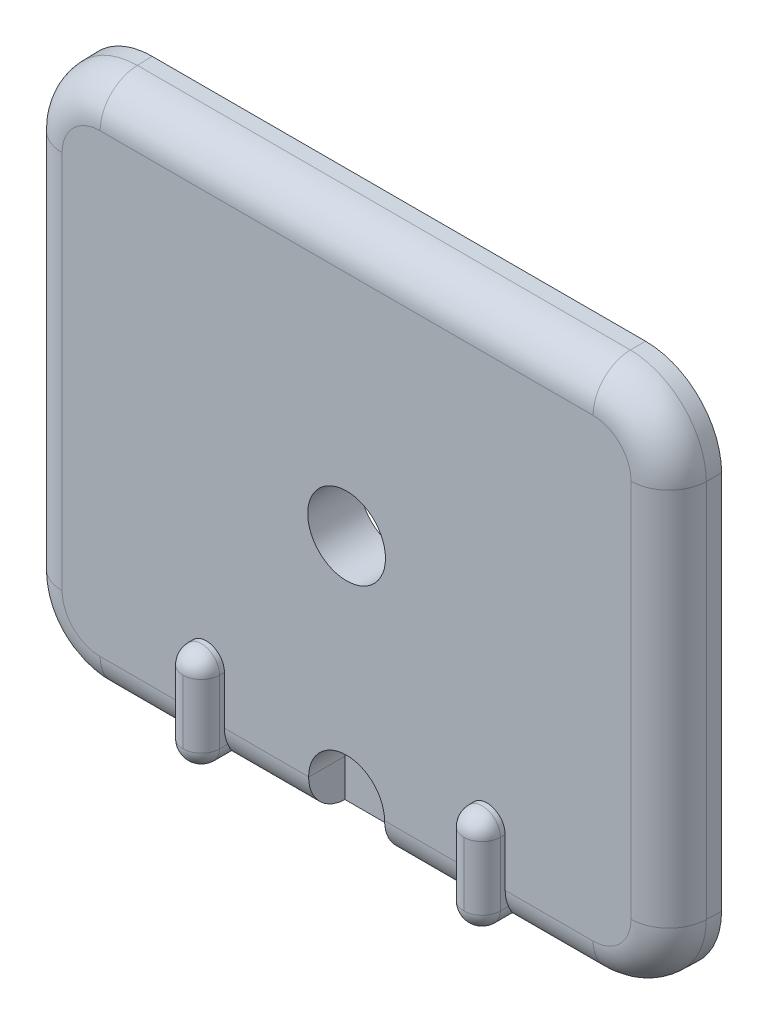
ISO-10303-21;
HEADER;
FILE_DESCRIPTION(('STEP AP214'),'2;1');
FILE_NAME('part.step','',(''),(''),'','','');
FILE_SCHEMA(('AUTOMOTIVE_DESIGN { 1 0 10303 214 1 1 1 1 }'));
ENDSEC;
DATA;
#1=APPLICATION_CONTEXT('core data for automotive mechanical design processes');
#2=APPLICATION_PROTOCOL_DEFINITION('international standard','automotive_design',2000,#1);
#3=PRODUCT_CONTEXT('',#1,'mechanical');
#4=PRODUCT('Part','Part','',(#3));
#5=PRODUCT_RELATED_PRODUCT_CATEGORY('part','',(#4));
#6=PRODUCT_DEFINITION_FORMATION('','',#4);
#7=PRODUCT_DEFINITION_CONTEXT('part definition',#1,'design');
#8=PRODUCT_DEFINITION('design','',#6,#7);
#9=PRODUCT_DEFINITION_SHAPE('','',#8);
#10=(LENGTH_UNIT() NAMED_UNIT(*) SI_UNIT(.MILLI.,.METRE.));
#11=(NAMED_UNIT(*) PLANE_ANGLE_UNIT() SI_UNIT($,.RADIAN.));
#12=(NAMED_UNIT(*) SI_UNIT($,.STERADIAN.) SOLID_ANGLE_UNIT());
#13=UNCERTAINTY_MEASURE_WITH_UNIT(LENGTH_MEASURE(1.E-05),#10,'distance_accuracy_value','');
#14=(GEOMETRIC_REPRESENTATION_CONTEXT(3) GLOBAL_UNCERTAINTY_ASSIGNED_CONTEXT((#13)) GLOBAL_UNIT_ASSIGNED_CONTEXT((#10,
#11,#12)) REPRESENTATION_CONTEXT('',''));
#15=CARTESIAN_POINT('',(0.,0.,0.));
#16=DIRECTION('',(0.,0.,1.));
#17=DIRECTION('',(1.,0.,0.));
#18=AXIS2_PLACEMENT_3D('',#15,#16,#17);
#19=CARTESIAN_POINT('',(0.,0.,2.1844));
#20=DIRECTION('',(0.,0.,-1.));
#21=DIRECTION('',(-1.,0.,0.));
#22=AXIS2_PLACEMENT_3D('',#19,#20,#21);
#23=PLANE('',#22);
#24=CARTESIAN_POINT('',(0.,0.,2.1844));
#25=DIRECTION('',(0.,0.,1.));
#26=DIRECTION('',(1.,0.,0.));
#27=AXIS2_PLACEMENT_3D('',#24,#25,#26);
#28=CIRCLE('',#27,1.6256);
#29=CARTESIAN_POINT('',(1.6256,0.,2.1844));
#30=VERTEX_POINT('',#29);
#31=EDGE_CURVE('E389',#30,#30,#28,.T.);
#32=ORIENTED_EDGE('',*,*,#31,.F.);
#33=EDGE_LOOP('',(#32));
#34=FACE_BOUND('',#33,.T.);
#35=CARTESIAN_POINT('',(0.,-9.525,2.1844));
#36=DIRECTION('',(0.,0.,-1.));
#37=DIRECTION('',(-1.,0.,0.));
#38=AXIS2_PLACEMENT_3D('',#35,#36,#37);
#39=CIRCLE('',#38,1.5875);
#40=CARTESIAN_POINT('',(-1.58746420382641,-9.51433925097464,2.1844));
#41=VERTEX_POINT('',#40);
#42=CARTESIAN_POINT('',(1.58746420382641,-9.51433925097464,2.1844));
#43=VERTEX_POINT('',#42);
#44=EDGE_CURVE('E600',#41,#43,#39,.T.);
#45=ORIENTED_EDGE('',*,*,#44,.T.);
#46=DIRECTION('',(-1.,0.,0.));
#47=VECTOR('',#46,1.);
#48=CARTESIAN_POINT('',(0.,-9.51433925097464,2.1844));
#49=LINE('',#48,#47);
#50=CARTESIAN_POINT('',(5.1054,-9.51433925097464,2.1844));
#51=VERTEX_POINT('',#50);
#52=EDGE_CURVE('E581',#43,#51,#49,.F.);
#53=ORIENTED_EDGE('',*,*,#52,.T.);
#54=DIRECTION('',(0.,-1.,0.));
#55=VECTOR('',#54,1.);
#56=CARTESIAN_POINT('',(5.1054,-7.493,2.1844));
#57=LINE('',#56,#55);
#58=CARTESIAN_POINT('',(5.1054,-7.493,2.1844));
#59=VERTEX_POINT('',#58);
#60=EDGE_CURVE('E583',#59,#51,#57,.T.);
#61=ORIENTED_EDGE('',*,*,#60,.F.);
#62=CARTESIAN_POINT('',(5.8674,-7.493,2.1844));
#63=DIRECTION('',(0.,0.,1.));
#64=DIRECTION('',(1.,0.,0.));
#65=AXIS2_PLACEMENT_3D('',#62,#63,#64);
#66=CIRCLE('',#65,0.762000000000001);
#67=CARTESIAN_POINT('',(6.6294,-7.493,2.1844));
#68=VERTEX_POINT('',#67);
#69=EDGE_CURVE('E245',#68,#59,#66,.T.);
#70=ORIENTED_EDGE('',*,*,#69,.F.);
#71=DIRECTION('',(0.,1.,0.));
#72=VECTOR('',#71,1.);
#73=CARTESIAN_POINT('',(6.6294,-7.493,2.1844));
#74=LINE('',#73,#72);
#75=CARTESIAN_POINT('',(6.6294,-9.51433925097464,2.1844));
#76=VERTEX_POINT('',#75);
#77=EDGE_CURVE('E588',#76,#68,#74,.T.);
#78=ORIENTED_EDGE('',*,*,#77,.F.);
#79=CARTESIAN_POINT('',(10.3019810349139,-9.51433925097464,2.1844));
#80=VERTEX_POINT('',#79);
#81=EDGE_CURVE('E472',#76,#80,#49,.F.);
#82=ORIENTED_EDGE('',*,*,#81,.T.);
#83=CARTESIAN_POINT('',(10.3014974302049,-7.92659743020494,2.1844));
#84=DIRECTION('',(0.,0.,-1.));
#85=DIRECTION('',(0.707106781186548,-0.707106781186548,0.));
#86=AXIS2_PLACEMENT_3D('',#83,#84,#85);
#87=ELLIPSE('',#86,1.58798360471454,1.5875);
#88=CARTESIAN_POINT('',(11.8892392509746,-7.92708103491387,2.1844));
#89=VERTEX_POINT('',#88);
#90=EDGE_CURVE('E469',#80,#89,#87,.F.);
#91=ORIENTED_EDGE('',*,*,#90,.T.);
#92=DIRECTION('',(0.,-1.,0.));
#93=VECTOR('',#92,1.);
#94=CARTESIAN_POINT('',(11.8892392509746,0.,2.1844));
#95=LINE('',#94,#93);
#96=CARTESIAN_POINT('',(11.8892392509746,7.92708103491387,2.1844));
#97=VERTEX_POINT('',#96);
#98=EDGE_CURVE('E696',#89,#97,#95,.F.);
#99=ORIENTED_EDGE('',*,*,#98,.T.);
#100=CARTESIAN_POINT('',(10.3014974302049,7.92659743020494,2.1844));
#101=DIRECTION('',(0.,0.,-1.));
#102=DIRECTION('',(0.707106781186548,0.707106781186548,0.));
#103=AXIS2_PLACEMENT_3D('',#100,#101,#102);
#104=ELLIPSE('',#103,1.58798360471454,1.5875);
#105=CARTESIAN_POINT('',(10.3019810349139,9.51433925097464,2.1844));
#106=VERTEX_POINT('',#105);
#107=EDGE_CURVE('E436',#97,#106,#104,.F.);
#108=ORIENTED_EDGE('',*,*,#107,.T.);
#109=DIRECTION('',(1.,0.,0.));
#110=VECTOR('',#109,1.);
#111=CARTESIAN_POINT('',(0.,9.51433925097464,2.1844));
#112=LINE('',#111,#110);
#113=CARTESIAN_POINT('',(-10.3019810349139,9.51433925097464,2.1844));
#114=VERTEX_POINT('',#113);
#115=EDGE_CURVE('E443',#106,#114,#112,.F.);
#116=ORIENTED_EDGE('',*,*,#115,.T.);
#117=CARTESIAN_POINT('',(-10.3014974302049,7.92659743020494,2.1844));
#118=DIRECTION('',(0.,0.,-1.));
#119=DIRECTION('',(-0.707106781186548,0.707106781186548,0.));
#120=AXIS2_PLACEMENT_3D('',#117,#118,#119);
#121=ELLIPSE('',#120,1.58798360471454,1.5875);
#122=CARTESIAN_POINT('',(-11.8892392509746,7.92708103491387,2.1844));
#123=VERTEX_POINT('',#122);
#124=EDGE_CURVE('E624',#114,#123,#121,.F.);
#125=ORIENTED_EDGE('',*,*,#124,.T.);
#126=DIRECTION('',(0.,1.,0.));
#127=VECTOR('',#126,1.);
#128=CARTESIAN_POINT('',(-11.8892392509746,0.,2.1844));
#129=LINE('',#128,#127);
#130=CARTESIAN_POINT('',(-11.8892392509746,-7.92708103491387,2.1844));
#131=VERTEX_POINT('',#130);
#132=EDGE_CURVE('E622',#123,#131,#129,.F.);
#133=ORIENTED_EDGE('',*,*,#132,.T.);
#134=CARTESIAN_POINT('',(-10.3014974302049,-7.92659743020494,2.1844));
#135=DIRECTION('',(0.,0.,-1.));
#136=DIRECTION('',(-0.707106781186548,-0.707106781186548,0.));
#137=AXIS2_PLACEMENT_3D('',#134,#135,#136);
#138=ELLIPSE('',#137,1.58798360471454,1.5875);
#139=CARTESIAN_POINT('',(-10.3019810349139,-9.51433925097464,2.1844));
#140=VERTEX_POINT('',#139);
#141=EDGE_CURVE('E621',#131,#140,#138,.F.);
#142=ORIENTED_EDGE('',*,*,#141,.T.);
#143=CARTESIAN_POINT('',(-6.6294,-9.51433925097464,2.1844));
#144=VERTEX_POINT('',#143);
#145=EDGE_CURVE('E616',#140,#144,#49,.F.);
#146=ORIENTED_EDGE('',*,*,#145,.T.);
#147=DIRECTION('',(0.,1.,0.));
#148=VECTOR('',#147,1.);
#149=CARTESIAN_POINT('',(-6.6294,-7.493,2.1844));
#150=LINE('',#149,#148);
#151=CARTESIAN_POINT('',(-6.6294,-7.493,2.1844));
#152=VERTEX_POINT('',#151);
#153=EDGE_CURVE('E573',#144,#152,#150,.T.);
#154=ORIENTED_EDGE('',*,*,#153,.T.);
#155=CARTESIAN_POINT('',(-5.8674,-7.493,2.1844));
#156=DIRECTION('',(0.,0.,-1.));
#157=DIRECTION('',(-1.,0.,0.));
#158=AXIS2_PLACEMENT_3D('',#155,#156,#157);
#159=CIRCLE('',#158,0.762000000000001);
#160=CARTESIAN_POINT('',(-5.1054,-7.493,2.1844));
#161=VERTEX_POINT('',#160);
#162=EDGE_CURVE('E518',#152,#161,#159,.T.);
#163=ORIENTED_EDGE('',*,*,#162,.T.);
#164=DIRECTION('',(0.,-1.,0.));
#165=VECTOR('',#164,1.);
#166=CARTESIAN_POINT('',(-5.1054,-7.493,2.1844));
#167=LINE('',#166,#165);
#168=CARTESIAN_POINT('',(-5.1054,-9.51433925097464,2.1844));
#169=VERTEX_POINT('',#168);
#170=EDGE_CURVE('E576',#161,#169,#167,.T.);
#171=ORIENTED_EDGE('',*,*,#170,.T.);
#172=EDGE_CURVE('E614',#169,#41,#49,.F.);
#173=ORIENTED_EDGE('',*,*,#172,.T.);
#174=EDGE_LOOP('',(#45,#53,#61,#70,#78,#82,#91,#99,#108,#116,#125,#133,#142,#146,#154,#163,#171,#173));
#175=FACE_BOUND('',#174,.T.);
#176=ADVANCED_FACE('F37',(#34,#175),#23,.F.);
#177=CARTESIAN_POINT('',(0.,-9.51433925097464,0.5969));
#178=DIRECTION('',(-1.,0.,0.));
#179=DIRECTION('',(0.,0.,1.));
#180=AXIS2_PLACEMENT_3D('',#177,#178,#179);
#181=CYLINDRICAL_SURFACE('',#180,1.5875);
#182=CARTESIAN_POINT('',(-1.5875,-9.51433925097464,0.5969));
#183=DIRECTION('',(1.,0.,0.));
#184=DIRECTION('',(0.,1.,0.));
#185=AXIS2_PLACEMENT_3D('',#182,#183,#184);
#186=CIRCLE('',#185,1.5875);
#187=CARTESIAN_POINT('',(-1.5875,-11.1005687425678,0.6604));
#188=VERTEX_POINT('',#187);
#189=CARTESIAN_POINT('',(-1.5875,-9.5249999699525,2.1843642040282));
#190=VERTEX_POINT('',#189);
#191=EDGE_CURVE('E52',#188,#190,#186,.F.);
#192=ORIENTED_EDGE('',*,*,#191,.T.);
#193=CARTESIAN_POINT('',(-1.5875,-9.524999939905,2.18436420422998));
#194=CARTESIAN_POINT('',(-1.58749999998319,-9.52322315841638,2.18437613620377));
#195=CARTESIAN_POINT('',(-1.58749701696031,-9.52144637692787,2.1843850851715));
#196=CARTESIAN_POINT('',(-1.58748508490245,-9.51789281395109,2.18439701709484));
#197=CARTESIAN_POINT('',(-1.58747613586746,-9.51611603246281,2.18440000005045));
#198=CARTESIAN_POINT('',(-1.58746420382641,-9.51433925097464,2.1844));
#199=B_SPLINE_CURVE_WITH_KNOTS('',3,(#193,#194,#195,#196,#197,#198),.UNSPECIFIED.,.F.,.F.,(4,2,
4),(0.,0.00533041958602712,0.010660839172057),.UNSPECIFIED.);
#200=EDGE_CURVE('E11',#190,#41,#199,.T.);
#201=ORIENTED_EDGE('',*,*,#200,.T.);
#202=ORIENTED_EDGE('',*,*,#172,.F.);
#203=CARTESIAN_POINT('',(-5.1054,-9.51433925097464,0.5969));
#204=DIRECTION('',(-1.,0.,0.));
#205=DIRECTION('',(0.,-1.,0.));
#206=AXIS2_PLACEMENT_3D('',#203,#204,#205);
#207=CIRCLE('',#206,1.5875);
#208=CARTESIAN_POINT('',(-5.1054,-10.16,2.04716840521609));
#209=VERTEX_POINT('',#208);
#210=EDGE_CURVE('E331',#209,#169,#207,.T.);
#211=ORIENTED_EDGE('',*,*,#210,.F.);
#212=CARTESIAN_POINT('',(-6.6294,-10.16,2.04716840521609));
#213=CARTESIAN_POINT('',(-6.62940047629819,-10.183562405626,2.03668255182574));
#214=CARTESIAN_POINT('',(-6.62830727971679,-10.2068454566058,2.02562450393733));
#215=CARTESIAN_POINT('',(-6.62409315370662,-10.2526713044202,2.00248791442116));
#216=CARTESIAN_POINT('',(-6.62097508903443,-10.2752150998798,1.99041083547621));
#217=CARTESIAN_POINT('',(-6.60889589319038,-10.3411363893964,1.95303231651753));
#218=CARTESIAN_POINT('',(-6.59720331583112,-10.3832651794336,1.92637639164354));
#219=CARTESIAN_POINT('',(-6.56450526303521,-10.4720818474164,1.8643489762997));
#220=CARTESIAN_POINT('',(-6.54202779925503,-10.5177697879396,1.82834254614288));
#221=CARTESIAN_POINT('',(-6.48957598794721,-10.6027775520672,1.75391091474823));
#222=CARTESIAN_POINT('',(-6.45956114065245,-10.6420610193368,1.71547351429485));
#223=CARTESIAN_POINT('',(-6.39245286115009,-10.7144763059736,1.63742316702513));
#224=CARTESIAN_POINT('',(-6.35526005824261,-10.7475070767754,1.59780123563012));
#225=CARTESIAN_POINT('',(-6.29435674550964,-10.7916436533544,1.53989615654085));
#226=CARTESIAN_POINT('',(-6.27324228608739,-10.8054359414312,1.52087919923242));
#227=CARTESIAN_POINT('',(-6.22911749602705,-10.8311611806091,1.48382816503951));
#228=CARTESIAN_POINT('',(-6.20610912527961,-10.843096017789,1.46579310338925));
#229=CARTESIAN_POINT('',(-6.16148709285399,-10.8633239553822,1.43397712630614));
#230=CARTESIAN_POINT('',(-6.14016931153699,-10.8718945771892,1.41996130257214));
#231=CARTESIAN_POINT('',(-6.09574031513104,-10.8873639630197,1.39388735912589));
#232=CARTESIAN_POINT('',(-6.07262777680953,-10.8942614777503,1.38183070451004));
#233=CARTESIAN_POINT('',(-6.02412130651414,-10.9061333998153,1.3605858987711));
#234=CARTESIAN_POINT('',(-5.99869648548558,-10.9110748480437,1.35144737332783));
#235=CARTESIAN_POINT('',(-5.94630791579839,-10.9183588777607,1.33781079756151));
#236=CARTESIAN_POINT('',(-5.91935129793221,-10.9207126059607,1.33329284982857));
#237=CARTESIAN_POINT('',(-5.86871062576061,-10.9223608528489,1.33013507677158));
#238=CARTESIAN_POINT('',(-5.84508437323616,-10.9220304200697,1.33077452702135));
#239=CARTESIAN_POINT('',(-5.79840976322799,-10.9192319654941,1.33611640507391));
#240=CARTESIAN_POINT('',(-5.77536256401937,-10.9167599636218,1.34082639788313));
#241=CARTESIAN_POINT('',(-5.72584548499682,-10.9092393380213,1.35484666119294));
#242=CARTESIAN_POINT('',(-5.6996631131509,-10.9037611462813,1.36491100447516));
#243=CARTESIAN_POINT('',(-5.64936303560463,-10.8906046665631,1.38824742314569));
#244=CARTESIAN_POINT('',(-5.62525140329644,-10.882920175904,1.40152852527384));
#245=CARTESIAN_POINT('',(-5.56083887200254,-10.859005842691,1.4412322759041));
#246=CARTESIAN_POINT('',(-5.52262555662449,-10.8407932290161,1.46980892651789));
#247=CARTESIAN_POINT('',(-5.45112064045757,-10.7995753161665,1.52945505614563));
#248=CARTESIAN_POINT('',(-5.41783887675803,-10.7765606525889,1.56052933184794));
#249=CARTESIAN_POINT('',(-5.3526984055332,-10.723603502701,1.62635822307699));
#250=CARTESIAN_POINT('',(-5.32127383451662,-10.6932110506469,1.66118243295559));
#251=CARTESIAN_POINT('',(-5.26375323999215,-10.6270880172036,1.73013893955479));
#252=CARTESIAN_POINT('',(-5.23765512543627,-10.5913595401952,1.764271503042));
#253=CARTESIAN_POINT('',(-5.19196968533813,-10.5154661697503,1.82993062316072));
#254=CARTESIAN_POINT('',(-5.17225171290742,-10.4754162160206,1.86149800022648));
#255=CARTESIAN_POINT('',(-5.13972757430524,-10.3906215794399,1.92165248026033));
#256=CARTESIAN_POINT('',(-5.12690182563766,-10.3458906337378,1.95024783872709));
#257=CARTESIAN_POINT('',(-5.11406552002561,-10.2768397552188,1.98952974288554));
#258=CARTESIAN_POINT('',(-5.11085883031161,-10.2539853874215,2.00180391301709));
#259=CARTESIAN_POINT('',(-5.1065246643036,-10.2075178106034,2.02530482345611));
#260=CARTESIAN_POINT('',(-5.10539985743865,-10.183903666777,2.03653020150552));
#261=CARTESIAN_POINT('',(-5.1054,-10.16,2.04716840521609));
#262=B_SPLINE_CURVE_WITH_KNOTS('',3,(#212,#213,#214,#215,#216,#217,#218,#219,#220,#221,#222,
#223,#224,#225,#226,#227,#228,#229,#230,#231,#232,#233,#234,#235,#236,#237,#238,#239,#240,#241,
#242,#243,#244,#245,#246,#247,#248,#249,#250,#251,#252,#253,#254,#255,#256,#257,#258,#259,#260,
#261),.UNSPECIFIED.,.F.,.F.,(4,2,2,2,2,2,2,2,2,2,2,2,2,2,2,2,2,2,2,2,2,2,2,2,4),(0.,
0.0773026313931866,0.154496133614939,0.307387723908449,0.493517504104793,0.680669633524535,
0.870627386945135,0.965294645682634,1.05986514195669,1.14046854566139,1.221131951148,
1.30310190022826,1.38471735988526,1.45514764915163,1.52570911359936,1.61097378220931,
1.69648054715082,1.84886452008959,2.00154847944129,2.16870937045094,2.33580451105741,
2.49922228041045,2.66217325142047,2.74048940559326,2.81890590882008),.UNSPECIFIED.);
#263=CARTESIAN_POINT('',(-6.6294,-10.16,2.04716840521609));
#264=VERTEX_POINT('',#263);
#265=EDGE_CURVE('E325',#264,#209,#262,.T.);
#266=ORIENTED_EDGE('',*,*,#265,.F.);
#267=CARTESIAN_POINT('',(-6.6294,-9.51433925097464,0.5969));
#268=DIRECTION('',(1.,0.,0.));
#269=DIRECTION('',(0.,0.,-1.));
#270=AXIS2_PLACEMENT_3D('',#267,#268,#269);
#271=CIRCLE('',#270,1.5875);
#272=EDGE_CURVE('E332',#144,#264,#271,.T.);
#273=ORIENTED_EDGE('',*,*,#272,.F.);
#274=ORIENTED_EDGE('',*,*,#145,.F.);
#275=CARTESIAN_POINT('',(-10.3019810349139,-9.51433925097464,0.5969));
#276=DIRECTION('',(1.,0.,0.));
#277=DIRECTION('',(0.,0.,-1.));
#278=AXIS2_PLACEMENT_3D('',#275,#276,#277);
#279=CIRCLE('',#278,1.5875);
#280=CARTESIAN_POINT('',(-10.3019810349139,-11.1015974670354,0.624605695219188));
#281=VERTEX_POINT('',#280);
#282=EDGE_CURVE('E386',#140,#281,#279,.T.);
#283=ORIENTED_EDGE('',*,*,#282,.T.);
#284=DIRECTION('',(1.,0.,0.));
#285=VECTOR('',#284,1.);
#286=CARTESIAN_POINT('',(-13.4874,-11.1015974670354,0.624605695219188));
#287=LINE('',#286,#285);
#288=CARTESIAN_POINT('',(10.3019810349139,-11.1015974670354,0.624605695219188));
#289=VERTEX_POINT('',#288);
#290=EDGE_CURVE('E474',#289,#281,#287,.F.);
#291=ORIENTED_EDGE('',*,*,#290,.F.);
#292=CARTESIAN_POINT('',(10.3019810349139,-9.51433925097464,0.5969));
#293=DIRECTION('',(1.,0.,0.));
#294=DIRECTION('',(0.,1.,0.));
#295=AXIS2_PLACEMENT_3D('',#292,#293,#294);
#296=CIRCLE('',#295,1.5875);
#297=EDGE_CURVE('E382',#80,#289,#296,.T.);
#298=ORIENTED_EDGE('',*,*,#297,.F.);
#299=ORIENTED_EDGE('',*,*,#81,.F.);
#300=CARTESIAN_POINT('',(6.6294,-9.51433925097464,0.5969));
#301=DIRECTION('',(1.,0.,0.));
#302=DIRECTION('',(0.,0.,-1.));
#303=AXIS2_PLACEMENT_3D('',#300,#301,#302);
#304=CIRCLE('',#303,1.5875);
#305=CARTESIAN_POINT('',(6.6294,-10.16,2.04716840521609));
#306=VERTEX_POINT('',#305);
#307=EDGE_CURVE('E302',#76,#306,#304,.T.);
#308=ORIENTED_EDGE('',*,*,#307,.T.);
#309=CARTESIAN_POINT('',(6.6294,-10.16,2.04716840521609));
#310=CARTESIAN_POINT('',(6.62940047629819,-10.183562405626,2.03668255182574));
#311=CARTESIAN_POINT('',(6.62830727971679,-10.2068454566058,2.02562450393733));
#312=CARTESIAN_POINT('',(6.62409315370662,-10.2526713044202,2.00248791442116));
#313=CARTESIAN_POINT('',(6.62097508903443,-10.2752150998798,1.99041083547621));
#314=CARTESIAN_POINT('',(6.60889589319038,-10.3411363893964,1.95303231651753));
#315=CARTESIAN_POINT('',(6.59720331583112,-10.3832651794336,1.92637639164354));
#316=CARTESIAN_POINT('',(6.56450526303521,-10.4720818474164,1.8643489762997));
#317=CARTESIAN_POINT('',(6.54202779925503,-10.5177697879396,1.82834254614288));
#318=CARTESIAN_POINT('',(6.48957598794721,-10.6027775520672,1.75391091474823));
#319=CARTESIAN_POINT('',(6.45956114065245,-10.6420610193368,1.71547351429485));
#320=CARTESIAN_POINT('',(6.39245286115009,-10.7144763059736,1.63742316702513));
#321=CARTESIAN_POINT('',(6.35526005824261,-10.7475070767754,1.59780123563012));
#322=CARTESIAN_POINT('',(6.29435674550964,-10.7916436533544,1.53989615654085));
#323=CARTESIAN_POINT('',(6.27324228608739,-10.8054359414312,1.52087919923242));
#324=CARTESIAN_POINT('',(6.22911749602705,-10.8311611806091,1.48382816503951));
#325=CARTESIAN_POINT('',(6.20610912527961,-10.843096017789,1.46579310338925));
#326=CARTESIAN_POINT('',(6.16148709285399,-10.8633239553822,1.43397712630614));
#327=CARTESIAN_POINT('',(6.14016931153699,-10.8718945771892,1.41996130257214));
#328=CARTESIAN_POINT('',(6.09574031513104,-10.8873639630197,1.39388735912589));
#329=CARTESIAN_POINT('',(6.07262777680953,-10.8942614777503,1.38183070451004));
#330=CARTESIAN_POINT('',(6.02412130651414,-10.9061333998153,1.3605858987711));
#331=CARTESIAN_POINT('',(5.99869648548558,-10.9110748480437,1.35144737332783));
#332=CARTESIAN_POINT('',(5.94630791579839,-10.9183588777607,1.33781079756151));
#333=CARTESIAN_POINT('',(5.91935129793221,-10.9207126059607,1.33329284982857));
#334=CARTESIAN_POINT('',(5.86871062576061,-10.9223608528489,1.33013507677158));
#335=CARTESIAN_POINT('',(5.84508437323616,-10.9220304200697,1.33077452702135));
#336=CARTESIAN_POINT('',(5.79840976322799,-10.9192319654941,1.33611640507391));
#337=CARTESIAN_POINT('',(5.77536256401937,-10.9167599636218,1.34082639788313));
#338=CARTESIAN_POINT('',(5.72584548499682,-10.9092393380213,1.35484666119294));
#339=CARTESIAN_POINT('',(5.6996631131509,-10.9037611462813,1.36491100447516));
#340=CARTESIAN_POINT('',(5.64936303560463,-10.8906046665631,1.38824742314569));
#341=CARTESIAN_POINT('',(5.62525140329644,-10.882920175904,1.40152852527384));
#342=CARTESIAN_POINT('',(5.56083887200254,-10.859005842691,1.4412322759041));
#343=CARTESIAN_POINT('',(5.52262555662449,-10.8407932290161,1.46980892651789));
#344=CARTESIAN_POINT('',(5.45112064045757,-10.7995753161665,1.52945505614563));
#345=CARTESIAN_POINT('',(5.41783887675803,-10.7765606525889,1.56052933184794));
#346=CARTESIAN_POINT('',(5.3526984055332,-10.723603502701,1.62635822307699));
#347=CARTESIAN_POINT('',(5.32127383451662,-10.6932110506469,1.66118243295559));
#348=CARTESIAN_POINT('',(5.26375323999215,-10.6270880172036,1.73013893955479));
#349=CARTESIAN_POINT('',(5.23765512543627,-10.5913595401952,1.764271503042));
#350=CARTESIAN_POINT('',(5.19196968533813,-10.5154661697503,1.82993062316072));
#351=CARTESIAN_POINT('',(5.17225171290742,-10.4754162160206,1.86149800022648));
#352=CARTESIAN_POINT('',(5.13972757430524,-10.3906215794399,1.92165248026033));
#353=CARTESIAN_POINT('',(5.12690182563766,-10.3458906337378,1.95024783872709));
#354=CARTESIAN_POINT('',(5.11406552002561,-10.2768397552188,1.98952974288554));
#355=CARTESIAN_POINT('',(5.11085883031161,-10.2539853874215,2.00180391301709));
#356=CARTESIAN_POINT('',(5.1065246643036,-10.2075178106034,2.02530482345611));
#357=CARTESIAN_POINT('',(5.10539985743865,-10.183903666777,2.03653020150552));
#358=CARTESIAN_POINT('',(5.1054,-10.16,2.04716840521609));
#359=B_SPLINE_CURVE_WITH_KNOTS('',3,(#309,#310,#311,#312,#313,#314,#315,#316,#317,#318,#319,
#320,#321,#322,#323,#324,#325,#326,#327,#328,#329,#330,#331,#332,#333,#334,#335,#336,#337,#338,
#339,#340,#341,#342,#343,#344,#345,#346,#347,#348,#349,#350,#351,#352,#353,#354,#355,#356,#357,
#358),.UNSPECIFIED.,.F.,.F.,(4,2,2,2,2,2,2,2,2,2,2,2,2,2,2,2,2,2,2,2,2,2,2,2,4),(0.,
0.0773026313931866,0.154496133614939,0.307387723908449,0.493517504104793,0.680669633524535,
0.870627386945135,0.965294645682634,1.05986514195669,1.14046854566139,1.221131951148,
1.30310190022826,1.38471735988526,1.45514764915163,1.52570911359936,1.61097378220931,
1.69648054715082,1.84886452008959,2.00154847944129,2.16870937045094,2.33580451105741,
2.49922228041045,2.66217325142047,2.74048940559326,2.81890590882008),.UNSPECIFIED.);
#360=CARTESIAN_POINT('',(5.1054,-10.16,2.04716840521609));
#361=VERTEX_POINT('',#360);
#362=EDGE_CURVE('E296',#306,#361,#359,.T.);
#363=ORIENTED_EDGE('',*,*,#362,.T.);
#364=CARTESIAN_POINT('',(5.1054,-9.51433925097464,0.5969));
#365=DIRECTION('',(-1.,0.,0.));
#366=DIRECTION('',(0.,-1.,0.));
#367=AXIS2_PLACEMENT_3D('',#364,#365,#366);
#368=CIRCLE('',#367,1.5875);
#369=EDGE_CURVE('E303',#361,#51,#368,.T.);
#370=ORIENTED_EDGE('',*,*,#369,.T.);
#371=ORIENTED_EDGE('',*,*,#52,.F.);
#372=CARTESIAN_POINT('',(1.58746420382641,-9.51433925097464,2.1844));
#373=CARTESIAN_POINT('',(1.58747613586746,-9.51611603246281,2.18440000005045));
#374=CARTESIAN_POINT('',(1.58748508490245,-9.51789281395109,2.18439701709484));
#375=CARTESIAN_POINT('',(1.58749701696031,-9.52144637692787,2.1843850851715));
#376=CARTESIAN_POINT('',(1.58749999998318,-9.52322315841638,2.18437613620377));
#377=CARTESIAN_POINT('',(1.5875,-9.524999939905,2.18436420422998));
#378=B_SPLINE_CURVE_WITH_KNOTS('',3,(#372,#373,#374,#375,#376,#377),.UNSPECIFIED.,.F.,.F.,(4,2,
4),(0.,0.00533041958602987,0.010660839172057),.UNSPECIFIED.);
#379=CARTESIAN_POINT('',(1.5875,-9.525,2.18436420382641));
#380=VERTEX_POINT('',#379);
#381=EDGE_CURVE('E41',#43,#380,#378,.T.);
#382=ORIENTED_EDGE('',*,*,#381,.T.);
#383=CARTESIAN_POINT('',(1.5875,-9.51433925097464,0.5969));
#384=DIRECTION('',(-1.,0.,0.));
#385=DIRECTION('',(0.,-1.,0.));
#386=AXIS2_PLACEMENT_3D('',#383,#384,#385);
#387=CIRCLE('',#386,1.5875);
#388=CARTESIAN_POINT('',(1.5875,-11.1005687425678,0.6604));
#389=VERTEX_POINT('',#388);
#390=EDGE_CURVE('E262',#380,#389,#387,.F.);
#391=ORIENTED_EDGE('',*,*,#390,.T.);
#392=DIRECTION('',(-1.,0.,0.));
#393=VECTOR('',#392,1.);
#394=CARTESIAN_POINT('',(0.,-11.1005687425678,0.6604));
#395=LINE('',#394,#393);
#396=EDGE_CURVE('E86',#188,#389,#395,.F.);
#397=ORIENTED_EDGE('',*,*,#396,.F.);
#398=EDGE_LOOP('',(#192,#201,#202,#211,#266,#273,#274,#283,#291,#298,#299,#308,#363,#370,#371,
#382,#391,#397));
#399=FACE_BOUND('',#398,.T.);
#400=ADVANCED_FACE('F270',(#399),#181,.T.);
#401=CARTESIAN_POINT('',(13.4874,-11.1125,0.));
#402=DIRECTION('',(0.999847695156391,0.,0.0174524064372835));
#403=DIRECTION('',(0.0174524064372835,0.,-0.999847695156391));
#404=AXIS2_PLACEMENT_3D('',#401,#402,#403);
#405=PLANE('',#404);
#406=DIRECTION('',(-0.0174497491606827,-0.0174497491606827,0.999695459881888));
#407=VECTOR('',#406,1.);
#408=CARTESIAN_POINT('',(13.4815992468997,7.93218281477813,0.332324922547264));
#409=LINE('',#408,#407);
#410=CARTESIAN_POINT('',(13.4874,7.93798356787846,0.));
#411=VERTEX_POINT('',#410);
#412=CARTESIAN_POINT('',(13.4764974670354,7.92708103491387,0.624605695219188));
#413=VERTEX_POINT('',#412);
#414=EDGE_CURVE('E647',#411,#413,#409,.T.);
#415=ORIENTED_EDGE('',*,*,#414,.T.);
#416=DIRECTION('',(0.,1.,0.));
#417=VECTOR('',#416,1.);
#418=CARTESIAN_POINT('',(13.4764974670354,-11.1125,0.624605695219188));
#419=LINE('',#418,#417);
#420=CARTESIAN_POINT('',(13.4764974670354,-7.92708103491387,0.624605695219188));
#421=VERTEX_POINT('',#420);
#422=EDGE_CURVE('E435',#413,#421,#419,.F.);
#423=ORIENTED_EDGE('',*,*,#422,.T.);
#424=DIRECTION('',(-0.0174497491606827,0.0174497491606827,0.999695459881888));
#425=VECTOR('',#424,1.);
#426=CARTESIAN_POINT('',(13.4883666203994,-7.93895018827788,-0.0553776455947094));
#427=LINE('',#426,#425);
#428=CARTESIAN_POINT('',(13.4874,-7.93798356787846,0.));
#429=VERTEX_POINT('',#428);
#430=EDGE_CURVE('E645',#421,#429,#427,.F.);
#431=ORIENTED_EDGE('',*,*,#430,.T.);
#432=DIRECTION('',(0.,1.,0.));
#433=VECTOR('',#432,1.);
#434=CARTESIAN_POINT('',(13.4874,-11.1125,0.));
#435=LINE('',#434,#433);
#436=EDGE_CURVE('E657',#429,#411,#435,.T.);
#437=ORIENTED_EDGE('',*,*,#436,.T.);
#438=EDGE_LOOP('',(#415,#423,#431,#437));
#439=FACE_BOUND('',#438,.T.);
#440=ADVANCED_FACE('F678',(#439),#405,.T.);
#441=CARTESIAN_POINT('',(-13.4874,11.1125,0.));
#442=DIRECTION('',(0.,0.999847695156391,0.0174524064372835));
#443=DIRECTION('',(0.,-0.0174524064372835,0.999847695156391));
#444=AXIS2_PLACEMENT_3D('',#441,#442,#443);
#445=PLANE('',#444);
#446=DIRECTION('',(0.0174497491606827,-0.0174497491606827,0.999695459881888));
#447=VECTOR('',#446,1.);
#448=CARTESIAN_POINT('',(-10.3138501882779,11.1134666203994,-0.0553776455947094));
#449=LINE('',#448,#447);
#450=CARTESIAN_POINT('',(-10.3128835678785,11.1125,0.));
#451=VERTEX_POINT('',#450);
#452=CARTESIAN_POINT('',(-10.3019810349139,11.1015974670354,0.624605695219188));
#453=VERTEX_POINT('',#452);
#454=EDGE_CURVE('E424',#451,#453,#449,.T.);
#455=ORIENTED_EDGE('',*,*,#454,.T.);
#456=DIRECTION('',(-1.,0.,0.));
#457=VECTOR('',#456,1.);
#458=CARTESIAN_POINT('',(-13.4874,11.1015974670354,0.624605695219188));
#459=LINE('',#458,#457);
#460=CARTESIAN_POINT('',(10.3019810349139,11.1015974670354,0.624605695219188));
#461=VERTEX_POINT('',#460);
#462=EDGE_CURVE('E442',#453,#461,#459,.F.);
#463=ORIENTED_EDGE('',*,*,#462,.T.);
#464=DIRECTION('',(-0.0174497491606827,-0.0174497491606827,0.999695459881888));
#465=VECTOR('',#464,1.);
#466=CARTESIAN_POINT('',(10.3056365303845,11.105252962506,0.41518249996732));
#467=LINE('',#466,#465);
#468=CARTESIAN_POINT('',(10.3128835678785,11.1125,0.));
#469=VERTEX_POINT('',#468);
#470=EDGE_CURVE('E415',#461,#469,#467,.F.);
#471=ORIENTED_EDGE('',*,*,#470,.T.);
#472=DIRECTION('',(-1.,0.,0.));
#473=VECTOR('',#472,1.);
#474=CARTESIAN_POINT('',(-13.4874,11.1125,0.));
#475=LINE('',#474,#473);
#476=EDGE_CURVE('E655',#469,#451,#475,.T.);
#477=ORIENTED_EDGE('',*,*,#476,.T.);
#478=EDGE_LOOP('',(#455,#463,#471,#477));
#479=FACE_BOUND('',#478,.T.);
#480=ADVANCED_FACE('F693',(#479),#445,.T.);
#481=CARTESIAN_POINT('',(-13.4874,-11.1125,0.));
#482=DIRECTION('',(-0.999847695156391,0.,0.0174524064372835));
#483=DIRECTION('',(0.0174524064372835,0.,0.999847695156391));
#484=AXIS2_PLACEMENT_3D('',#481,#482,#483);
#485=PLANE('',#484);
#486=DIRECTION('',(0.0174497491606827,0.0174497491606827,0.999695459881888));
#487=VECTOR('',#486,1.);
#488=CARTESIAN_POINT('',(-13.4883666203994,-7.93895018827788,-0.0553776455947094));
#489=LINE('',#488,#487);
#490=CARTESIAN_POINT('',(-13.4874,-7.93798356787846,0.));
#491=VERTEX_POINT('',#490);
#492=CARTESIAN_POINT('',(-13.4764974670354,-7.92708103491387,0.624605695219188));
#493=VERTEX_POINT('',#492);
#494=EDGE_CURVE('E425',#491,#493,#489,.T.);
#495=ORIENTED_EDGE('',*,*,#494,.T.);
#496=DIRECTION('',(0.,-1.,0.));
#497=VECTOR('',#496,1.);
#498=CARTESIAN_POINT('',(-13.4764974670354,-11.1125,0.624605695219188));
#499=LINE('',#498,#497);
#500=CARTESIAN_POINT('',(-13.4764974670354,7.92708103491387,0.624605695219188));
#501=VERTEX_POINT('',#500);
#502=EDGE_CURVE('E482',#493,#501,#499,.F.);
#503=ORIENTED_EDGE('',*,*,#502,.T.);
#504=DIRECTION('',(0.0174497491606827,-0.0174497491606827,0.999695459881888));
#505=VECTOR('',#504,1.);
#506=CARTESIAN_POINT('',(-13.4815992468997,7.93218281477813,0.332324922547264));
#507=LINE('',#506,#505);
#508=CARTESIAN_POINT('',(-13.4874,7.93798356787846,0.));
#509=VERTEX_POINT('',#508);
#510=EDGE_CURVE('E632',#501,#509,#507,.F.);
#511=ORIENTED_EDGE('',*,*,#510,.T.);
#512=DIRECTION('',(0.,-1.,0.));
#513=VECTOR('',#512,1.);
#514=CARTESIAN_POINT('',(-13.4874,-11.1125,0.));
#515=LINE('',#514,#513);
#516=EDGE_CURVE('E652',#509,#491,#515,.T.);
#517=ORIENTED_EDGE('',*,*,#516,.T.);
#518=EDGE_LOOP('',(#495,#503,#511,#517));
#519=FACE_BOUND('',#518,.T.);
#520=ADVANCED_FACE('F686',(#519),#485,.T.);
#521=CARTESIAN_POINT('',(-13.4874,-11.1125,0.));
#522=DIRECTION('',(0.,-0.999847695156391,0.0174524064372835));
#523=DIRECTION('',(0.,-0.0174524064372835,-0.999847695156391));
#524=AXIS2_PLACEMENT_3D('',#521,#522,#523);
#525=PLANE('',#524);
#526=DIRECTION('',(-0.0174497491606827,0.0174497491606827,0.999695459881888));
#527=VECTOR('',#526,1.);
#528=CARTESIAN_POINT('',(10.3056365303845,-11.105252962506,0.41518249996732));
#529=LINE('',#528,#527);
#530=CARTESIAN_POINT('',(10.3128835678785,-11.1125,0.));
#531=VERTEX_POINT('',#530);
#532=EDGE_CURVE('E634',#531,#289,#529,.T.);
#533=ORIENTED_EDGE('',*,*,#532,.T.);
#534=ORIENTED_EDGE('',*,*,#290,.T.);
#535=DIRECTION('',(0.0174497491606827,0.0174497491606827,0.999695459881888));
#536=VECTOR('',#535,1.);
#537=CARTESIAN_POINT('',(-10.3138501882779,-11.1134666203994,-0.0553776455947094));
#538=LINE('',#537,#536);
#539=CARTESIAN_POINT('',(-10.3128835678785,-11.1125,0.));
#540=VERTEX_POINT('',#539);
#541=EDGE_CURVE('E636',#281,#540,#538,.F.);
#542=ORIENTED_EDGE('',*,*,#541,.T.);
#543=DIRECTION('',(1.,0.,0.));
#544=VECTOR('',#543,1.);
#545=CARTESIAN_POINT('',(-13.4874,-11.1125,0.));
#546=LINE('',#545,#544);
#547=EDGE_CURVE('E649',#540,#531,#546,.T.);
#548=ORIENTED_EDGE('',*,*,#547,.T.);
#549=EDGE_LOOP('',(#533,#534,#542,#548));
#550=FACE_BOUND('',#549,.T.);
#551=ADVANCED_FACE('F673',(#550),#525,.T.);
#552=CARTESIAN_POINT('',(0.,0.,0.));
#553=DIRECTION('',(0.,0.,-1.));
#554=DIRECTION('',(-1.,0.,0.));
#555=AXIS2_PLACEMENT_3D('',#552,#553,#554);
#556=PLANE('',#555);
#557=CARTESIAN_POINT('',(0.,0.,0.));
#558=DIRECTION('',(0.,0.,1.));
#559=DIRECTION('',(1.,0.,0.));
#560=AXIS2_PLACEMENT_3D('',#557,#558,#559);
#561=CIRCLE('',#560,1.6256);
#562=CARTESIAN_POINT('',(1.6256,0.,0.));
#563=VERTEX_POINT('',#562);
#564=EDGE_CURVE('E660',#563,#563,#561,.T.);
#565=ORIENTED_EDGE('',*,*,#564,.T.);
#566=EDGE_LOOP('',(#565));
#567=FACE_BOUND('',#566,.T.);
#568=ORIENTED_EDGE('',*,*,#436,.F.);
#569=CARTESIAN_POINT('',(10.3119163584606,-7.93701635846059,0.));
#570=DIRECTION('',(0.,0.,-1.));
#571=DIRECTION('',(0.707106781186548,-0.707106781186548,0.));
#572=AXIS2_PLACEMENT_3D('',#569,#570,#571);
#573=ELLIPSE('',#572,3.17596720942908,3.175);
#574=EDGE_CURVE('E638',#429,#531,#573,.T.);
#575=ORIENTED_EDGE('',*,*,#574,.T.);
#576=ORIENTED_EDGE('',*,*,#547,.F.);
#577=CARTESIAN_POINT('',(-10.3119163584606,-7.93701635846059,0.));
#578=DIRECTION('',(0.,0.,-1.));
#579=DIRECTION('',(-0.707106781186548,-0.707106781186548,0.));
#580=AXIS2_PLACEMENT_3D('',#577,#578,#579);
#581=ELLIPSE('',#580,3.17596720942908,3.175);
#582=EDGE_CURVE('E640',#540,#491,#581,.T.);
#583=ORIENTED_EDGE('',*,*,#582,.T.);
#584=ORIENTED_EDGE('',*,*,#516,.F.);
#585=CARTESIAN_POINT('',(-10.3119163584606,7.9370163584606,0.));
#586=DIRECTION('',(0.,0.,-1.));
#587=DIRECTION('',(-0.707106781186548,0.707106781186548,0.));
#588=AXIS2_PLACEMENT_3D('',#585,#586,#587);
#589=ELLIPSE('',#588,3.17596720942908,3.175);
#590=EDGE_CURVE('E642',#509,#451,#589,.T.);
#591=ORIENTED_EDGE('',*,*,#590,.T.);
#592=ORIENTED_EDGE('',*,*,#476,.F.);
#593=CARTESIAN_POINT('',(10.3119163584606,7.93701635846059,0.));
#594=DIRECTION('',(0.,0.,-1.));
#595=DIRECTION('',(0.707106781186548,0.707106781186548,0.));
#596=AXIS2_PLACEMENT_3D('',#593,#594,#595);
#597=ELLIPSE('',#596,3.17596720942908,3.175);
#598=EDGE_CURVE('E420',#469,#411,#597,.T.);
#599=ORIENTED_EDGE('',*,*,#598,.T.);
#600=EDGE_LOOP('',(#568,#575,#576,#583,#584,#591,#592,#599));
#601=FACE_BOUND('',#600,.T.);
#602=ADVANCED_FACE('F353',(#567,#601),#556,.T.);
#603=CARTESIAN_POINT('',(10.3138501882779,-7.93895018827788,-0.110789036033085));
#604=DIRECTION('',(0.0174497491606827,-0.0174497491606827,-0.999695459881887));
#605=DIRECTION('',(-0.999847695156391,0.,-0.0174524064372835));
#606=AXIS2_PLACEMENT_3D('',#603,#604,#605);
#607=CYLINDRICAL_SURFACE('',#606,3.175);
#608=ORIENTED_EDGE('',*,*,#430,.F.);
#609=CARTESIAN_POINT('',(10.3014974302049,-7.92659743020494,0.5969));
#610=DIRECTION('',(-0.00872421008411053,0.00872421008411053,0.999923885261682));
#611=DIRECTION('',(0.707052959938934,-0.707052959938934,0.0123378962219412));
#612=AXIS2_PLACEMENT_3D('',#609,#610,#611);
#613=ELLIPSE('',#612,3.17524182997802,3.175);
#614=EDGE_CURVE('E468',#421,#289,#613,.F.);
#615=ORIENTED_EDGE('',*,*,#614,.T.);
#616=ORIENTED_EDGE('',*,*,#532,.F.);
#617=ORIENTED_EDGE('',*,*,#574,.F.);
#618=EDGE_LOOP('',(#608,#615,#616,#617));
#619=FACE_BOUND('',#618,.T.);
#620=ADVANCED_FACE('F375',(#619),#607,.T.);
#621=CARTESIAN_POINT('',(-10.3138501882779,-7.93895018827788,-0.110789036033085));
#622=DIRECTION('',(-0.0174497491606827,-0.0174497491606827,-0.999695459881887));
#623=DIRECTION('',(-0.999847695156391,0.,0.0174524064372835));
#624=AXIS2_PLACEMENT_3D('',#621,#622,#623);
#625=CYLINDRICAL_SURFACE('',#624,3.175);
#626=ORIENTED_EDGE('',*,*,#541,.F.);
#627=CARTESIAN_POINT('',(-10.3014974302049,-7.92659743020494,0.5969));
#628=DIRECTION('',(0.00872421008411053,0.00872421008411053,0.999923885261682));
#629=DIRECTION('',(-0.707052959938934,-0.707052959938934,0.0123378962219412));
#630=AXIS2_PLACEMENT_3D('',#627,#628,#629);
#631=ELLIPSE('',#630,3.17524182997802,3.175);
#632=EDGE_CURVE('E480',#281,#493,#631,.F.);
#633=ORIENTED_EDGE('',*,*,#632,.T.);
#634=ORIENTED_EDGE('',*,*,#494,.F.);
#635=ORIENTED_EDGE('',*,*,#582,.F.);
#636=EDGE_LOOP('',(#626,#633,#634,#635));
#637=FACE_BOUND('',#636,.T.);
#638=ADVANCED_FACE('F399',(#637),#625,.T.);
#639=CARTESIAN_POINT('',(-10.3070828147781,7.93218281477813,0.276913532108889));
#640=DIRECTION('',(-0.0174497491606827,0.0174497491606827,-0.999695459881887));
#641=DIRECTION('',(-0.999847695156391,0.,0.0174524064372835));
#642=AXIS2_PLACEMENT_3D('',#639,#640,#641);
#643=CYLINDRICAL_SURFACE('',#642,3.175);
#644=ORIENTED_EDGE('',*,*,#510,.F.);
#645=CARTESIAN_POINT('',(-10.3014974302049,7.92659743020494,0.5969));
#646=DIRECTION('',(0.00872421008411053,-0.00872421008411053,0.999923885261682));
#647=DIRECTION('',(-0.707052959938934,0.707052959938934,0.0123378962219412));
#648=AXIS2_PLACEMENT_3D('',#645,#646,#647);
#649=ELLIPSE('',#648,3.17524182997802,3.175);
#650=EDGE_CURVE('E487',#501,#453,#649,.F.);
#651=ORIENTED_EDGE('',*,*,#650,.T.);
#652=ORIENTED_EDGE('',*,*,#454,.F.);
#653=ORIENTED_EDGE('',*,*,#590,.F.);
#654=EDGE_LOOP('',(#644,#651,#652,#653));
#655=FACE_BOUND('',#654,.T.);
#656=ADVANCED_FACE('F402',(#655),#643,.T.);
#657=CARTESIAN_POINT('',(10.3056365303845,7.93073653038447,0.359771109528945));
#658=DIRECTION('',(0.0174497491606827,0.0174497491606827,-0.999695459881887));
#659=DIRECTION('',(-0.999847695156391,0.,-0.0174524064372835));
#660=AXIS2_PLACEMENT_3D('',#657,#658,#659);
#661=CYLINDRICAL_SURFACE('',#660,3.175);
#662=ORIENTED_EDGE('',*,*,#470,.F.);
#663=CARTESIAN_POINT('',(10.3014974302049,7.92659743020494,0.5969));
#664=DIRECTION('',(-0.00872421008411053,-0.00872421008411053,0.999923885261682));
#665=DIRECTION('',(0.707052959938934,0.707052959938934,0.0123378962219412));
#666=AXIS2_PLACEMENT_3D('',#663,#664,#665);
#667=ELLIPSE('',#666,3.17524182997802,3.175);
#668=EDGE_CURVE('E418',#461,#413,#667,.F.);
#669=ORIENTED_EDGE('',*,*,#668,.T.);
#670=ORIENTED_EDGE('',*,*,#414,.F.);
#671=ORIENTED_EDGE('',*,*,#598,.F.);
#672=EDGE_LOOP('',(#662,#669,#670,#671));
#673=FACE_BOUND('',#672,.T.);
#674=ADVANCED_FACE('F347',(#673),#661,.T.);
#675=CARTESIAN_POINT('',(0.,0.,0.));
#676=DIRECTION('',(0.,0.,1.));
#677=DIRECTION('',(1.,0.,0.));
#678=AXIS2_PLACEMENT_3D('',#675,#676,#677);
#679=CYLINDRICAL_SURFACE('',#678,1.6256);
#680=ORIENTED_EDGE('',*,*,#564,.F.);
#681=EDGE_LOOP('',(#680));
#682=FACE_BOUND('',#681,.T.);
#683=ORIENTED_EDGE('',*,*,#31,.T.);
#684=EDGE_LOOP('',(#683));
#685=FACE_BOUND('',#684,.T.);
#686=ADVANCED_FACE('F343',(#682,#685),#679,.F.);
#687=CARTESIAN_POINT('',(-11.4243714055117,-9.04947140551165,2.1844));
#688=CARTESIAN_POINT('',(-12.5195354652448,-10.1446354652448,2.1844));
#689=CARTESIAN_POINT('',(-12.5465615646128,-10.1716615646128,0.636075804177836));
#690=CARTESIAN_POINT('',(-11.4733511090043,-9.00049170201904,2.1844));
#691=CARTESIAN_POINT('',(-12.616315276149,-10.0478556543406,2.1844));
#692=CARTESIAN_POINT('',(-12.644520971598,-10.0737021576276,0.636075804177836));
#693=CARTESIAN_POINT('',(-11.5191195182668,-8.94830070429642,2.1844));
#694=CARTESIAN_POINT('',(-12.7068336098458,-9.94480103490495,2.1844));
#695=CARTESIAN_POINT('',(-12.7360597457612,-9.96932211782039,0.635963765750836));
#696=CARTESIAN_POINT('',(-11.6034507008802,-8.83838919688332,2.1844));
#697=CARTESIAN_POINT('',(-12.8738267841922,-9.72786929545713,2.1844));
#698=CARTESIAN_POINT('',(-12.9047299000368,-9.74950689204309,0.63551753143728));
#699=CARTESIAN_POINT('',(-11.6420134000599,-8.78066863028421,2.1844));
#700=CARTESIAN_POINT('',(-12.9503109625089,-9.61397575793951,2.1844));
#701=CARTESIAN_POINT('',(-12.9818611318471,-9.63407159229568,0.635183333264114));
#702=CARTESIAN_POINT('',(-11.7112734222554,-8.66068565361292,2.1844));
#703=CARTESIAN_POINT('',(-13.0879644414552,-9.37724019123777,2.1844));
#704=CARTESIAN_POINT('',(-13.1203966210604,-9.39412108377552,0.634298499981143));
#705=CARTESIAN_POINT('',(-11.7419705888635,-8.59842315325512,2.1844));
#706=CARTESIAN_POINT('',(-13.1491384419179,-9.25437976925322,2.1844));
#707=CARTESIAN_POINT('',(-13.1818005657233,-9.26960569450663,0.633747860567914));
#708=CARTESIAN_POINT('',(-11.7949743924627,-8.47042166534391,2.1844));
#709=CARTESIAN_POINT('',(-13.2551420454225,-9.00173073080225,2.1844));
#710=CARTESIAN_POINT('',(-13.2878310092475,-9.01362555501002,0.632439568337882));
#711=CARTESIAN_POINT('',(-11.8172807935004,-8.40468258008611,2.1844));
#712=CARTESIAN_POINT('',(-13.2999713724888,-8.87192298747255,2.1844));
#713=CARTESIAN_POINT('',(-13.3324570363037,-8.88216060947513,0.631681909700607));
#714=CARTESIAN_POINT('',(-11.8531214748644,-8.27085273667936,2.1844));
#715=CARTESIAN_POINT('',(-13.3725144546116,-8.60751658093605,2.1844));
#716=CARTESIAN_POINT('',(-13.4041682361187,-8.61453075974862,0.629972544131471));
#717=CARTESIAN_POINT('',(-11.866655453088,-8.20276189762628,2.1844));
#718=CARTESIAN_POINT('',(-13.400222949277,-8.47289934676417,2.1844));
#719=CARTESIAN_POINT('',(-13.4312528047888,-8.47836569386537,0.629020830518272));
#720=CARTESIAN_POINT('',(-11.8847197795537,-8.06539357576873,2.1844));
#721=CARTESIAN_POINT('',(-13.4380249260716,-8.20109704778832,2.1844));
#722=CARTESIAN_POINT('',(-13.4674177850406,-8.20366537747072,0.626939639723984));
#723=CARTESIAN_POINT('',(-11.8892497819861,-7.99611604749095,2.1844));
#724=CARTESIAN_POINT('',(-13.4481084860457,-8.06389522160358,2.1844));
#725=CARTESIAN_POINT('',(-13.4764975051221,-8.06513003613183,0.625810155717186));
#726=CARTESIAN_POINT('',(-11.8892286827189,-7.857559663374,2.1844));
#727=CARTESIAN_POINT('',(-13.450442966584,-7.78919983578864,2.1844));
#728=CARTESIAN_POINT('',(-13.4764975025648,-7.78805946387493,0.623392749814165));
#729=CARTESIAN_POINT('',(-11.884677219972,-7.78828080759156,2.1844));
#730=CARTESIAN_POINT('',(-13.44267993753,-7.65169245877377,2.1844));
#731=CARTESIAN_POINT('',(-13.4674170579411,-7.64952423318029,0.622104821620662));
#732=CARTESIAN_POINT('',(-11.8665710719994,-7.65090709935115,2.1844));
#733=CARTESIAN_POINT('',(-13.4093919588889,-7.37868086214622,2.1844));
#734=CARTESIAN_POINT('',(-13.4312521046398,-7.37482415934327,0.619392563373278));
#735=CARTESIAN_POINT('',(-11.8530160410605,-7.58281229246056,2.1844));
#736=CARTESIAN_POINT('',(-13.3838499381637,-7.24316670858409,2.1844));
#737=CARTESIAN_POINT('',(-13.404166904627,-7.23865940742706,0.617968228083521));
#738=CARTESIAN_POINT('',(-11.8171346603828,-7.44897175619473,2.1844));
#739=CARTESIAN_POINT('',(-13.3153657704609,-6.97641989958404,2.1844));
#740=CARTESIAN_POINT('',(-13.3324558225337,-6.97103001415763,0.615007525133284));
#741=CARTESIAN_POINT('',(-11.7948080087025,-7.38322610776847,2.1844));
#742=CARTESIAN_POINT('',(-13.2724045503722,-6.84518187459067,2.1844));
#743=CARTESIAN_POINT('',(-13.2878293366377,-6.83956553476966,0.613471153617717));
#744=CARTESIAN_POINT('',(-11.7417653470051,-7.2552087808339,2.1844));
#745=CARTESIAN_POINT('',(-13.1697335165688,-6.58921297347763,2.1844));
#746=CARTESIAN_POINT('',(-13.1817991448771,-6.58358601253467,0.610312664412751));
#747=CARTESIAN_POINT('',(-11.7110491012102,-7.19293720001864,2.1844));
#748=CARTESIAN_POINT('',(-13.1100038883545,-6.4644816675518,2.1844));
#749=CARTESIAN_POINT('',(-13.1203949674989,-6.4590711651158,0.608690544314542));
#750=CARTESIAN_POINT('',(-11.6417527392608,-7.07293347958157,2.1844));
#751=CARTESIAN_POINT('',(-12.9747316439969,-6.22366263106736,2.1844));
#752=CARTESIAN_POINT('',(-12.9818598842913,-6.21912136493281,0.605388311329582));
#753=CARTESIAN_POINT('',(-11.6031724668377,-7.01520143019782,2.1844));
#754=CARTESIAN_POINT('',(-12.8991697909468,-6.10757945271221,2.1844));
#755=CARTESIAN_POINT('',(-12.9047286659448,-6.10368659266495,0.603708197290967));
#756=CARTESIAN_POINT('',(-11.518808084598,-6.90526459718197,2.1844));
#757=CARTESIAN_POINT('',(-12.7334425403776,-5.88606742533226,2.1844));
#758=CARTESIAN_POINT('',(-12.7360590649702,-5.88387209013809,0.600318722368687));
#759=CARTESIAN_POINT('',(-11.4730239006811,-6.85305987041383,2.1844));
#760=CARTESIAN_POINT('',(-12.6432597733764,-5.7806478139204,2.1844));
#761=CARTESIAN_POINT('',(-12.6445205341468,-5.77949247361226,0.598609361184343));
#762=CARTESIAN_POINT('',(-11.3750349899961,-6.75507095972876,2.1844));
#763=CARTESIAN_POINT('',(-12.4497589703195,-5.58231220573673,2.1844));
#764=CARTESIAN_POINT('',(-12.4486023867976,-5.58357432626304,0.595190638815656));
#765=CARTESIAN_POINT('',(-11.3228302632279,-6.70928677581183,2.1844));
#766=CARTESIAN_POINT('',(-12.3464266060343,-5.48940951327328,2.1844));
#767=CARTESIAN_POINT('',(-12.3442227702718,-5.49203579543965,0.593481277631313));
#768=CARTESIAN_POINT('',(-11.2128934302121,-6.62492239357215,2.1844));
#769=CARTESIAN_POINT('',(-12.1283338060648,-5.31776106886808,2.1844));
#770=CARTESIAN_POINT('',(-12.1244082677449,-5.32336619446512,0.590091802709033));
#771=CARTESIAN_POINT('',(-11.1551613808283,-6.58634212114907,2.1844));
#772=CARTESIAN_POINT('',(-12.013563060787,-5.23903178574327,2.1844));
#773=CARTESIAN_POINT('',(-12.0089734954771,-5.2462349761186,0.588411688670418));
#774=CARTESIAN_POINT('',(-11.0351576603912,-6.51704575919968,2.1844));
#775=CARTESIAN_POINT('',(-11.7745147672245,-5.09715507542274,2.1844));
#776=CARTESIAN_POINT('',(-11.7690236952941,-5.10769989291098,0.585109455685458));
#777=CARTESIAN_POINT('',(-10.972886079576,-6.48632951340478,2.1844));
#778=CARTESIAN_POINT('',(-11.6502316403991,-5.03402615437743,2.1844));
#779=CARTESIAN_POINT('',(-11.6445088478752,-5.04629571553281,0.583487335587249));
#780=CARTESIAN_POINT('',(-10.8448687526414,-6.43328685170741,2.1844));
#781=CARTESIAN_POINT('',(-11.3942642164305,-4.92451706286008,2.1844));
#782=CARTESIAN_POINT('',(-11.3885293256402,-4.94026552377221,0.580328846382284));
#783=CARTESIAN_POINT('',(-10.7791231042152,-6.41096020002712,2.1844));
#784=CARTESIAN_POINT('',(-11.2625794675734,-4.8781561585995,2.1844));
#785=CARTESIAN_POINT('',(-11.2570648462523,-4.89563903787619,0.578792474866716));
#786=CARTESIAN_POINT('',(-10.6452825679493,-6.37507881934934,2.1844));
#787=CARTESIAN_POINT('',(-10.9940644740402,-4.80306604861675,2.1844));
#788=CARTESIAN_POINT('',(-10.9894354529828,-4.82392795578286,0.575831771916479));
#789=CARTESIAN_POINT('',(-10.5771877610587,-6.36152378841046,2.1844));
#790=CARTESIAN_POINT('',(-10.8572389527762,-4.77435552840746,2.1844));
#791=CARTESIAN_POINT('',(-10.8532707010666,-4.79684275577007,0.574407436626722));
#792=CARTESIAN_POINT('',(-10.4398140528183,-6.3434176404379,2.1844));
#793=CARTESIAN_POINT('',(-10.5808096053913,-4.73514379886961,2.1844));
#794=CARTESIAN_POINT('',(-10.5785706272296,-4.76067780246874,0.571695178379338));
#795=CARTESIAN_POINT('',(-10.3705351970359,-6.33886617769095,2.1844));
#796=CARTESIAN_POINT('',(-10.4412153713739,-4.72465938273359,2.1844));
#797=CARTESIAN_POINT('',(-10.440035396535,-4.75159735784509,0.570407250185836));
#798=CARTESIAN_POINT('',(-10.2319788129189,-6.33884507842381,2.1844));
#799=CARTESIAN_POINT('',(-10.1616851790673,-4.72215610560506,2.1844));
#800=CARTESIAN_POINT('',(-10.1629648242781,-4.7515973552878,0.567989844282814));
#801=CARTESIAN_POINT('',(-10.1627012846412,-6.34337508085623,2.1844));
#802=CARTESIAN_POINT('',(-10.0217630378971,-4.73015095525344,2.1844));
#803=CARTESIAN_POINT('',(-10.0244294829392,-4.76067707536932,0.566860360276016));
#804=CARTESIAN_POINT('',(-10.0253329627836,-6.36143940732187,2.1844));
#805=CARTESIAN_POINT('',(-9.74403806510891,-4.76453114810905,2.1844));
#806=CARTESIAN_POINT('',(-9.74972916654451,-4.79684205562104,0.564779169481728));
#807=CARTESIAN_POINT('',(-9.95724212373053,-6.37497338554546,2.1844));
#808=CARTESIAN_POINT('',(-9.60625233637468,-4.79092613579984,2.1844));
#809=CARTESIAN_POINT('',(-9.61356410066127,-4.82392662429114,0.563827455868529));
#810=CARTESIAN_POINT('',(-9.82341228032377,-6.41081406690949,2.1844));
#811=CARTESIAN_POINT('',(-9.33523890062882,-4.86169700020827,2.1844));
#812=CARTESIAN_POINT('',(-9.34593425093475,-4.89563782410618,0.562118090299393));
#813=CARTESIAN_POINT('',(-9.75767319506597,-6.43312046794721,2.1844));
#814=CARTESIAN_POINT('',(-9.20203041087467,-4.90607775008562,2.1844));
#815=CARTESIAN_POINT('',(-9.21446930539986,-4.94026385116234,0.561360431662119));
#816=CARTESIAN_POINT('',(-9.62967170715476,-6.48612427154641,2.1844));
#817=CARTESIAN_POINT('',(-8.94254035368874,-5.0120798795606,2.1844));
#818=CARTESIAN_POINT('',(-8.95848916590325,-5.04629429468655,0.560052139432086));
#819=CARTESIAN_POINT('',(-9.56740920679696,-6.5168214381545,2.1844));
#820=CARTESIAN_POINT('',(-8.81627879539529,-5.0737009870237,2.1844));
#821=CARTESIAN_POINT('',(-8.83397377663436,-5.10769823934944,0.559501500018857));
#822=CARTESIAN_POINT('',(-9.44742623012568,-6.58608146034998,2.1844));
#823=CARTESIAN_POINT('',(-8.57293471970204,-5.21312413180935,2.1844));
#824=CARTESIAN_POINT('',(-8.59402326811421,-5.24623372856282,0.558616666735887));
#825=CARTESIAN_POINT('',(-9.38970566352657,-6.62464415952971,2.1844));
#826=CARTESIAN_POINT('',(-8.45587162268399,-5.29092073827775,2.1844));
#827=CARTESIAN_POINT('',(-8.4785879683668,-5.32336496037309,0.55828246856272));
#828=CARTESIAN_POINT('',(-9.27979415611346,-6.70897534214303,2.1844));
#829=CARTESIAN_POINT('',(-8.23301464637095,-5.46133422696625,2.1844));
#830=CARTESIAN_POINT('',(-8.2587727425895,-5.49203511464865,0.557836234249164));
#831=CARTESIAN_POINT('',(-9.22760315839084,-6.75474375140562,2.1844));
#832=CARTESIAN_POINT('',(-8.12723825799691,-5.55394087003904,2.1844));
#833=CARTESIAN_POINT('',(-8.15439270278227,-5.58357388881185,0.557724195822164));
#834=CARTESIAN_POINT('',(-9.12964375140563,-6.85270315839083,2.1844));
#835=CARTESIAN_POINT('',(-7.92884087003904,-5.75233825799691,2.1844));
#836=CARTESIAN_POINT('',(-7.95847388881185,-5.77949270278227,0.557724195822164));
#837=CARTESIAN_POINT('',(-9.08387534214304,-6.90489415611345,2.1844));
#838=CARTESIAN_POINT('',(-7.83623422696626,-5.85811464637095,2.1844));
#839=CARTESIAN_POINT('',(-7.86693511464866,-5.88387274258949,0.557836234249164));
#840=CARTESIAN_POINT('',(-8.99954415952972,-7.01480566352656,2.1844));
#841=CARTESIAN_POINT('',(-7.66582073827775,-6.08097162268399,2.1844));
#842=CARTESIAN_POINT('',(-7.69826496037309,-6.10368796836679,0.55828246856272));
#843=CARTESIAN_POINT('',(-8.96098146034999,-7.07252623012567,2.1844));
#844=CARTESIAN_POINT('',(-7.58802413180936,-6.19803471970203,2.1844));
#845=CARTESIAN_POINT('',(-7.62113372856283,-6.2191232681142,0.558616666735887));
#846=CARTESIAN_POINT('',(-8.8917214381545,-7.19250920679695,2.1844));
#847=CARTESIAN_POINT('',(-7.44860098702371,-6.44137879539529,2.1844));
#848=CARTESIAN_POINT('',(-7.48259823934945,-6.45907377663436,0.559501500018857));
#849=CARTESIAN_POINT('',(-8.86102427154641,-7.25477170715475,2.1844));
#850=CARTESIAN_POINT('',(-7.3869798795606,-6.56764035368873,2.1844));
#851=CARTESIAN_POINT('',(-7.42119429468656,-6.58358916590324,0.560052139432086));
#852=CARTESIAN_POINT('',(-8.80802046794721,-7.38277319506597,2.1844));
#853=CARTESIAN_POINT('',(-7.28097775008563,-6.82713041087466,2.1844));
#854=CARTESIAN_POINT('',(-7.31516385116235,-6.83956930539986,0.561360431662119));
#855=CARTESIAN_POINT('',(-8.78571406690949,-7.44851228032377,2.1844));
#856=CARTESIAN_POINT('',(-7.23659700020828,-6.96033890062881,2.1844));
#857=CARTESIAN_POINT('',(-7.27053782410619,-6.97103425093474,0.562118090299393));
#858=CARTESIAN_POINT('',(-8.74987338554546,-7.58234212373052,2.1844));
#859=CARTESIAN_POINT('',(-7.16582613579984,-7.23135233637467,2.1844));
#860=CARTESIAN_POINT('',(-7.19882662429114,-7.23866410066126,0.563827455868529));
#861=CARTESIAN_POINT('',(-8.73633940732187,-7.6504329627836,2.1844));
#862=CARTESIAN_POINT('',(-7.13943114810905,-7.3691380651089,2.1844));
#863=CARTESIAN_POINT('',(-7.17174205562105,-7.3748291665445,0.564779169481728));
#864=CARTESIAN_POINT('',(-8.71827508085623,-7.78780128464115,2.1844));
#865=CARTESIAN_POINT('',(-7.10505095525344,-7.64686303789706,2.1844));
#866=CARTESIAN_POINT('',(-7.13557707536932,-7.64952948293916,0.566860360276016));
#867=CARTESIAN_POINT('',(-8.71374507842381,-7.85707881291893,2.1844));
#868=CARTESIAN_POINT('',(-7.09705610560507,-7.78678517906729,2.1844));
#869=CARTESIAN_POINT('',(-7.12649735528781,-7.78806482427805,0.567989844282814));
#870=CARTESIAN_POINT('',(-8.71376617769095,-7.99563519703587,2.1844));
#871=CARTESIAN_POINT('',(-7.09955938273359,-8.06631537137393,2.1844));
#872=CARTESIAN_POINT('',(-7.12649735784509,-8.06513539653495,0.570407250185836));
#873=CARTESIAN_POINT('',(-8.7183176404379,-8.06491405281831,2.1844));
#874=CARTESIAN_POINT('',(-7.11004379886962,-8.20590960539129,2.1844));
#875=CARTESIAN_POINT('',(-7.13557780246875,-8.20367062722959,0.571695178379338));
#876=CARTESIAN_POINT('',(-8.73642378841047,-8.20228776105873,2.1844));
#877=CARTESIAN_POINT('',(-7.14925552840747,-8.48233895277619,2.1844));
#878=CARTESIAN_POINT('',(-7.17174275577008,-8.4783707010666,0.574407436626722));
#879=CARTESIAN_POINT('',(-8.74997881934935,-8.27038256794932,2.1844));
#880=CARTESIAN_POINT('',(-7.17796604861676,-8.61916447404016,2.1844));
#881=CARTESIAN_POINT('',(-7.19882795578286,-8.61453545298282,0.575831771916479));
#882=CARTESIAN_POINT('',(-8.78586020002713,-8.40422310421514,2.1844));
#883=CARTESIAN_POINT('',(-7.2530561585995,-8.88767946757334,2.1844));
#884=CARTESIAN_POINT('',(-7.2705390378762,-8.88216484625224,0.578792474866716));
#885=CARTESIAN_POINT('',(-8.80818685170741,-8.46996875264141,2.1844));
#886=CARTESIAN_POINT('',(-7.29941706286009,-9.01936421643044,2.1844));
#887=CARTESIAN_POINT('',(-7.31516552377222,-9.01362932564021,0.580328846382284));
#888=CARTESIAN_POINT('',(-8.86122951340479,-8.59798607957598,2.1844));
#889=CARTESIAN_POINT('',(-7.40892615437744,-9.27533164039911,2.1844));
#890=CARTESIAN_POINT('',(-7.42119571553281,-9.26960884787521,0.583487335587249));
#891=CARTESIAN_POINT('',(-8.89194575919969,-8.66025766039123,2.1844));
#892=CARTESIAN_POINT('',(-7.47205507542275,-9.39961476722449,2.1844));
#893=CARTESIAN_POINT('',(-7.48259989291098,-9.39412369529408,0.585109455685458));
#894=CARTESIAN_POINT('',(-8.96124212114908,-8.78026138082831,2.1844));
#895=CARTESIAN_POINT('',(-7.61393178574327,-9.63866306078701,2.1844));
#896=CARTESIAN_POINT('',(-7.6211349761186,-9.63407349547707,0.588411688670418));
#897=CARTESIAN_POINT('',(-8.99982239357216,-8.83799343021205,2.1844));
#898=CARTESIAN_POINT('',(-7.69266106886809,-9.75343380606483,2.1844));
#899=CARTESIAN_POINT('',(-7.69826619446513,-9.74950826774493,0.590091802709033));
#900=CARTESIAN_POINT('',(-9.08418677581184,-8.9479302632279,2.1844));
#901=CARTESIAN_POINT('',(-7.86430951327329,-9.97152660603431,2.1844));
#902=CARTESIAN_POINT('',(-7.86693579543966,-9.96932277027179,0.593481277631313));
#903=CARTESIAN_POINT('',(-9.12997095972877,-9.00013498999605,2.1844));
#904=CARTESIAN_POINT('',(-7.95721220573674,-10.0748589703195,2.1844));
#905=CARTESIAN_POINT('',(-7.95847432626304,-10.0737023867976,0.595190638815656));
#906=CARTESIAN_POINT('',(-9.22795987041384,-9.09812390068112,2.1844));
#907=CARTESIAN_POINT('',(-8.15554781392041,-10.2683597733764,2.1844));
#908=CARTESIAN_POINT('',(-8.15439247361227,-10.2696205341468,0.598609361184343));
#909=CARTESIAN_POINT('',(-9.28016459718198,-9.14390808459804,2.1844));
#910=CARTESIAN_POINT('',(-8.26096742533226,-10.3585425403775,2.1844));
#911=CARTESIAN_POINT('',(-8.2587720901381,-10.3611590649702,0.600318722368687));
#912=CARTESIAN_POINT('',(-9.39010143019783,-9.22827246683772,2.1844));
#913=CARTESIAN_POINT('',(-8.48247945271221,-10.5242697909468,2.1844));
#914=CARTESIAN_POINT('',(-8.47858659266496,-10.5298286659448,0.603708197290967));
#915=CARTESIAN_POINT('',(-9.44783347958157,-9.2668527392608,2.1844));
#916=CARTESIAN_POINT('',(-8.59856263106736,-10.5998316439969,2.1844));
#917=CARTESIAN_POINT('',(-8.59402136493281,-10.6069598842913,0.605388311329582));
#918=CARTESIAN_POINT('',(-9.56783720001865,-9.33614910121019,2.1844));
#919=CARTESIAN_POINT('',(-8.83938166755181,-10.7351038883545,2.1844));
#920=CARTESIAN_POINT('',(-8.83397116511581,-10.7454949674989,0.608690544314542));
#921=CARTESIAN_POINT('',(-9.6301087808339,-9.3668653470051,2.1844));
#922=CARTESIAN_POINT('',(-8.96411297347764,-10.7948335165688,2.1844));
#923=CARTESIAN_POINT('',(-8.95848601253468,-10.8068991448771,0.610312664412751));
#924=CARTESIAN_POINT('',(-9.75812610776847,-9.41990800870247,2.1844));
#925=CARTESIAN_POINT('',(-9.22008187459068,-10.8975045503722,2.1844));
#926=CARTESIAN_POINT('',(-9.21446553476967,-10.9129293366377,0.613471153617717));
#927=CARTESIAN_POINT('',(-9.82387175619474,-9.44223466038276,2.1844));
#928=CARTESIAN_POINT('',(-9.35131989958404,-10.9404657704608,2.1844));
#929=CARTESIAN_POINT('',(-9.34593001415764,-10.9575558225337,0.615007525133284));
#930=CARTESIAN_POINT('',(-9.95771229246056,-9.47811604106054,2.1844));
#931=CARTESIAN_POINT('',(-9.6180667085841,-11.0089499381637,2.1844));
#932=CARTESIAN_POINT('',(-9.61355940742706,-11.029266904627,0.617968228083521));
#933=CARTESIAN_POINT('',(-10.0258070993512,-9.49167107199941,2.1844));
#934=CARTESIAN_POINT('',(-9.75358086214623,-11.0344919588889,2.1844));
#935=CARTESIAN_POINT('',(-9.74972415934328,-11.0563521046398,0.619392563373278));
#936=CARTESIAN_POINT('',(-10.1631808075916,-9.50977721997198,2.1844));
#937=CARTESIAN_POINT('',(-10.0265924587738,-11.06777993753,2.1844));
#938=CARTESIAN_POINT('',(-10.0244242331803,-11.0925170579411,0.622104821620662));
#939=CARTESIAN_POINT('',(-10.232459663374,-9.51432868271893,2.1844));
#940=CARTESIAN_POINT('',(-10.1640998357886,-11.075542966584,2.1844));
#941=CARTESIAN_POINT('',(-10.1629594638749,-11.1015975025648,0.623392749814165));
#942=CARTESIAN_POINT('',(-10.371016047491,-9.51434978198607,2.1844));
#943=CARTESIAN_POINT('',(-10.4387952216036,-11.0732084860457,2.1844));
#944=CARTESIAN_POINT('',(-10.4400300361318,-11.1015975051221,0.625810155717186));
#945=CARTESIAN_POINT('',(-10.4402935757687,-9.50981977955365,2.1844));
#946=CARTESIAN_POINT('',(-10.5759970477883,-11.0631249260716,2.1844));
#947=CARTESIAN_POINT('',(-10.5785653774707,-11.0925177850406,0.626939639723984));
#948=CARTESIAN_POINT('',(-10.5776618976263,-9.49175545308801,2.1844));
#949=CARTESIAN_POINT('',(-10.8477993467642,-11.025322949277,2.1844));
#950=CARTESIAN_POINT('',(-10.8532656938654,-11.0563528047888,0.629020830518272));
#951=CARTESIAN_POINT('',(-10.6457527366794,-9.47822147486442,2.1844));
#952=CARTESIAN_POINT('',(-10.982416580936,-10.9976144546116,2.1844));
#953=CARTESIAN_POINT('',(-10.9894307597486,-11.0292682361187,0.629972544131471));
#954=CARTESIAN_POINT('',(-10.7795825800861,-9.44238079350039,2.1844));
#955=CARTESIAN_POINT('',(-11.2468229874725,-10.9250713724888,2.1844));
#956=CARTESIAN_POINT('',(-11.2570606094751,-10.9575570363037,0.631681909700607));
#957=CARTESIAN_POINT('',(-10.8453216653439,-9.42007439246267,2.1844));
#958=CARTESIAN_POINT('',(-11.3766307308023,-10.8802420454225,2.1844));
#959=CARTESIAN_POINT('',(-11.38852555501,-10.9129310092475,0.632439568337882));
#960=CARTESIAN_POINT('',(-10.9733231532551,-9.36707058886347,2.1844));
#961=CARTESIAN_POINT('',(-11.6292797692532,-10.7742384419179,2.1844));
#962=CARTESIAN_POINT('',(-11.6445056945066,-10.8069005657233,0.633747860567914));
#963=CARTESIAN_POINT('',(-11.0355856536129,-9.33637342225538,2.1844));
#964=CARTESIAN_POINT('',(-11.7521401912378,-10.7130644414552,2.1844));
#965=CARTESIAN_POINT('',(-11.7690210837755,-10.7454966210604,0.634298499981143));
#966=CARTESIAN_POINT('',(-11.1555686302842,-9.26711340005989,2.1844));
#967=CARTESIAN_POINT('',(-11.9888757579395,-10.5754109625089,2.1844));
#968=CARTESIAN_POINT('',(-12.0089715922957,-10.6069611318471,0.635183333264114));
#969=CARTESIAN_POINT('',(-11.2132891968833,-9.22855070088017,2.1844));
#970=CARTESIAN_POINT('',(-12.1027692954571,-10.4989267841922,2.1844));
#971=CARTESIAN_POINT('',(-12.1244068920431,-10.5298299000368,0.63551753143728));
#972=CARTESIAN_POINT('',(-11.3232007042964,-9.14421951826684,2.1844));
#973=CARTESIAN_POINT('',(-12.319701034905,-10.3319336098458,2.1844));
#974=CARTESIAN_POINT('',(-12.3442221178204,-10.3611597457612,0.635963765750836));
#975=CARTESIAN_POINT('',(-11.375391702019,-9.09845110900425,2.1844));
#976=CARTESIAN_POINT('',(-12.4227556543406,-10.241415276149,2.1844));
#977=CARTESIAN_POINT('',(-12.4486021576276,-10.269620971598,0.636075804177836));
#978=CARTESIAN_POINT('',(-11.4243714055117,-9.04947140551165,2.1844));
#979=CARTESIAN_POINT('',(-12.5195354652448,-10.1446354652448,2.1844));
#980=CARTESIAN_POINT('',(-12.5465615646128,-10.1716615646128,0.636075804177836));
#981=(BOUNDED_SURFACE() B_SPLINE_SURFACE(3,2,((#687,#688,#689),(#690,#691,#692),(#693,#694,
#695),(#696,#697,#698),(#699,#700,#701),(#702,#703,#704),(#705,#706,#707),(#708,#709,#710),
(#711,#712,#713),(#714,#715,#716),(#717,#718,#719),(#720,#721,#722),(#723,#724,#725),(#726,#727,
#728),(#729,#730,#731),(#732,#733,#734),(#735,#736,#737),(#738,#739,#740),(#741,#742,#743),
(#744,#745,#746),(#747,#748,#749),(#750,#751,#752),(#753,#754,#755),(#756,#757,#758),(#759,#760,
#761),(#762,#763,#764),(#765,#766,#767),(#768,#769,#770),(#771,#772,#773),(#774,#775,#776),
(#777,#778,#779),(#780,#781,#782),(#783,#784,#785),(#786,#787,#788),(#789,#790,#791),(#792,#793,
#794),(#795,#796,#797),(#798,#799,#800),(#801,#802,#803),(#804,#805,#806),(#807,#808,#809),
(#810,#811,#812),(#813,#814,#815),(#816,#817,#818),(#819,#820,#821),(#822,#823,#824),(#825,#826,
#827),(#828,#829,#830),(#831,#832,#833),(#834,#835,#836),(#837,#838,#839),(#840,#841,#842),
(#843,#844,#845),(#846,#847,#848),(#849,#850,#851),(#852,#853,#854),(#855,#856,#857),(#858,#859,
#860),(#861,#862,#863),(#864,#865,#866),(#867,#868,#869),(#870,#871,#872),(#873,#874,#875),
(#876,#877,#878),(#879,#880,#881),(#882,#883,#884),(#885,#886,#887),(#888,#889,#890),(#891,#892,
#893),(#894,#895,#896),(#897,#898,#899),(#900,#901,#902),(#903,#904,#905),(#906,#907,#908),
(#909,#910,#911),(#912,#913,#914),(#915,#916,#917),(#918,#919,#920),(#921,#922,#923),(#924,#925,
#926),(#927,#928,#929),(#930,#931,#932),(#933,#934,#935),(#936,#937,#938),(#939,#940,#941),
(#942,#943,#944),(#945,#946,#947),(#948,#949,#950),(#951,#952,#953),(#954,#955,#956),(#957,#958,
#959),(#960,#961,#962),(#963,#964,#965),(#966,#967,#968),(#969,#970,#971),(#972,#973,#974),
(#975,#976,#977),(#978,#979,#980)),.UNSPECIFIED.,.T.,.F.,.F.) B_SPLINE_SURFACE_WITH_KNOTS((4,2,
2,2,2,2,2,2,2,2,2,2,2,2,2,2,2,2,2,2,2,2,2,2,2,2,2,2,2,2,2,2,2,2,2,2,2,2,2,2,2,2,2,2,2,2,2,2,4),
(3,3),(0.,0.207655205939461,0.415312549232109,0.622974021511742,0.830641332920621,
1.03831579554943,1.24599823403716,1.45368892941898,1.66138760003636,1.86909342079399,
2.07680507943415,2.28452086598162,2.49223878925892,2.69995671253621,2.90767249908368,
3.11538415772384,3.32308997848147,3.53078864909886,3.73847934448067,3.9461617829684,
4.15383624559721,4.36150355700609,4.56916502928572,4.77682237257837,4.98447757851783,
5.19213278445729,5.39979012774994,5.60745160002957,5.81511891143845,6.02279337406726,
6.230475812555,6.43816650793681,6.64586517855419,6.85357099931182,7.06128265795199,
7.26899844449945,7.47671636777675,7.68443429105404,7.89215007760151,8.09986173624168,
8.3075675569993,8.51526622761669,8.7229569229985,8.93063936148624,9.13831382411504,
9.34598113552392,9.55364260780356,9.7612999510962,9.96895515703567),(0.,1.),
.UNSPECIFIED.) GEOMETRIC_REPRESENTATION_ITEM() RATIONAL_B_SPLINE_SURFACE(((1.,0.715778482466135,
1.),(1.,0.715778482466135,1.),(1.,0.715753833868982,1.),(1.,0.715655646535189,1.),(1.,
0.715582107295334,1.),(1.,0.715387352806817,1.),(1.,0.715266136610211,1.),(1.,0.71497803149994,
1.),(1.,0.714811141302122,1.),(1.,0.714434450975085,1.),(1.,0.714224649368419,1.),(1.,
0.713765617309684,1.),(1.,0.713516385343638,1.),(1.,0.712982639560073,1.),(1.,0.712698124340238,
1.),(1.,0.712098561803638,1.),(1.,0.711783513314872,1.),(1.,0.711128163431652,1.),(1.,
0.710787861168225,1.),(1.,0.710087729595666,1.),(1.,0.709727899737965,1.),(1.,0.708994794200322,
1.),(1.,0.708621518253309,1.),(1.,0.707867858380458,1.),(1.,0.707487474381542,1.),(1.,
0.706726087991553,1.),(1.,0.706345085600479,1.),(1.,0.705588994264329,1.),(1.,0.705213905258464,
1.),(1.,0.704476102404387,1.),(1.,0.704113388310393,1.),(1.,0.703406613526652,1.),(1.,
0.703062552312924,1.),(1.,0.702399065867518,1.),(1.,0.702079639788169,1.),(1.,0.701471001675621,
1.),(1.,0.701181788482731,1.),(1.,0.700638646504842,1.),(1.,0.700384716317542,1.),(1.,
0.699916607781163,1.),(1.,0.699702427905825,1.),(1.,0.699317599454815,1.),(1.,0.699146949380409,
1.),(1.,0.698852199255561,1.),(1.,0.698728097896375,1.),(1.,0.698528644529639,1.),(1.,
0.698453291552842,1.),(1.,0.698352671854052,1.),(1.,0.698327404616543,1.),(1.,0.698327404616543,
1.),(1.,0.698352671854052,1.),(1.,0.698453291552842,1.),(1.,0.698528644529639,1.),(1.,
0.698728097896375,1.),(1.,0.698852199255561,1.),(1.,0.699146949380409,1.),(1.,0.699317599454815,
1.),(1.,0.699702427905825,1.),(1.,0.699916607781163,1.),(1.,0.700384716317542,1.),(1.,
0.700638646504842,1.),(1.,0.701181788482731,1.),(1.,0.701471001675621,1.),(1.,0.702079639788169,
1.),(1.,0.702399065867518,1.),(1.,0.703062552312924,1.),(1.,0.703406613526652,1.),(1.,
0.704113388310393,1.),(1.,0.704476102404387,1.),(1.,0.705213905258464,1.),(1.,0.705588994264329,
1.),(1.,0.706345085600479,1.),(1.,0.706726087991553,1.),(1.,0.707487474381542,1.),(1.,
0.707867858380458,1.),(1.,0.708621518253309,1.),(1.,0.708994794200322,1.),(1.,0.709727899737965,
1.),(1.,0.710087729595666,1.),(1.,0.710787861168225,1.),(1.,0.711128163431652,1.),(1.,
0.711783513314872,1.),(1.,0.712098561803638,1.),(1.,0.712698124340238,1.),(1.,0.712982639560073,
1.),(1.,0.713516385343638,1.),(1.,0.713765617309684,1.),(1.,0.714224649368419,1.),(1.,
0.714434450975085,1.),(1.,0.714811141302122,1.),(1.,0.71497803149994,1.),(1.,0.715266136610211,
1.),(1.,0.715387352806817,1.),(1.,0.715582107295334,1.),(1.,0.715655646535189,1.),(1.,
0.715753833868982,1.),(1.,0.715778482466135,1.),(1.,0.715778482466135,1.))) REPRESENTATION_ITEM('') SURFACE());
#982=CARTESIAN_POINT('',(-11.8892392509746,-7.92708103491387,0.5969));
#983=DIRECTION('',(0.,1.,0.));
#984=DIRECTION('',(0.,0.,1.));
#985=AXIS2_PLACEMENT_3D('',#982,#983,#984);
#986=CIRCLE('',#985,1.5875);
#987=EDGE_CURVE('E383',#493,#131,#986,.T.);
#988=ORIENTED_EDGE('',*,*,#987,.F.);
#989=ORIENTED_EDGE('',*,*,#632,.F.);
#990=ORIENTED_EDGE('',*,*,#282,.F.);
#991=ORIENTED_EDGE('',*,*,#141,.F.);
#992=EDGE_LOOP('',(#988,#989,#990,#991));
#993=FACE_BOUND('',#992,.T.);
#994=ADVANCED_FACE('F346',(#993),#981,.T.);
#995=CARTESIAN_POINT('',(-11.8892392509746,0.,0.5969));
#996=DIRECTION('',(0.,1.,0.));
#997=DIRECTION('',(0.,0.,1.));
#998=AXIS2_PLACEMENT_3D('',#995,#996,#997);
#999=CYLINDRICAL_SURFACE('',#998,1.5875);
#1000=ORIENTED_EDGE('',*,*,#987,.T.);
#1001=ORIENTED_EDGE('',*,*,#132,.F.);
#1002=CARTESIAN_POINT('',(-11.8892392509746,7.92708103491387,0.5969));
#1003=DIRECTION('',(0.,1.,0.));
#1004=DIRECTION('',(0.,0.,1.));
#1005=AXIS2_PLACEMENT_3D('',#1002,#1003,#1004);
#1006=CIRCLE('',#1005,1.5875);
#1007=EDGE_CURVE('E456',#501,#123,#1006,.T.);
#1008=ORIENTED_EDGE('',*,*,#1007,.F.);
#1009=ORIENTED_EDGE('',*,*,#502,.F.);
#1010=EDGE_LOOP('',(#1000,#1001,#1008,#1009));
#1011=FACE_BOUND('',#1010,.T.);
#1012=ADVANCED_FACE('F373',(#1011),#999,.T.);
#1013=CARTESIAN_POINT('',(11.4243714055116,-9.04947140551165,2.1844));
#1014=CARTESIAN_POINT('',(12.5195354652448,-10.1446354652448,2.1844));
#1015=CARTESIAN_POINT('',(12.5465615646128,-10.1716615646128,0.636075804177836));
#1016=CARTESIAN_POINT('',(11.375391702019,-9.09845110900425,2.1844));
#1017=CARTESIAN_POINT('',(12.4227556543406,-10.241415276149,2.1844));
#1018=CARTESIAN_POINT('',(12.4486021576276,-10.269620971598,0.636075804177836));
#1019=CARTESIAN_POINT('',(11.3232007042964,-9.14421951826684,2.1844));
#1020=CARTESIAN_POINT('',(12.319701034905,-10.3319336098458,2.1844));
#1021=CARTESIAN_POINT('',(12.3442221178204,-10.3611597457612,0.635963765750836));
#1022=CARTESIAN_POINT('',(11.2132891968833,-9.22855070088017,2.1844));
#1023=CARTESIAN_POINT('',(12.1027692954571,-10.4989267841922,2.1844));
#1024=CARTESIAN_POINT('',(12.1244068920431,-10.5298299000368,0.63551753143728));
#1025=CARTESIAN_POINT('',(11.1555686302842,-9.26711340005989,2.1844));
#1026=CARTESIAN_POINT('',(11.9888757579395,-10.5754109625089,2.1844));
#1027=CARTESIAN_POINT('',(12.0089715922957,-10.6069611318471,0.635183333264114));
#1028=CARTESIAN_POINT('',(11.0355856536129,-9.33637342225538,2.1844));
#1029=CARTESIAN_POINT('',(11.7521401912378,-10.7130644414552,2.1844));
#1030=CARTESIAN_POINT('',(11.7690210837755,-10.7454966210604,0.634298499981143));
#1031=CARTESIAN_POINT('',(10.9733231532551,-9.36707058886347,2.1844));
#1032=CARTESIAN_POINT('',(11.6292797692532,-10.7742384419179,2.1844));
#1033=CARTESIAN_POINT('',(11.6445056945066,-10.8069005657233,0.633747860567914));
#1034=CARTESIAN_POINT('',(10.8453216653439,-9.42007439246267,2.1844));
#1035=CARTESIAN_POINT('',(11.3766307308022,-10.8802420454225,2.1844));
#1036=CARTESIAN_POINT('',(11.38852555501,-10.9129310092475,0.632439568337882));
#1037=CARTESIAN_POINT('',(10.7795825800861,-9.44238079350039,2.1844));
#1038=CARTESIAN_POINT('',(11.2468229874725,-10.9250713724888,2.1844));
#1039=CARTESIAN_POINT('',(11.2570606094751,-10.9575570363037,0.631681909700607));
#1040=CARTESIAN_POINT('',(10.6457527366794,-9.47822147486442,2.1844));
#1041=CARTESIAN_POINT('',(10.982416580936,-10.9976144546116,2.1844));
#1042=CARTESIAN_POINT('',(10.9894307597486,-11.0292682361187,0.629972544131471));
#1043=CARTESIAN_POINT('',(10.5776618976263,-9.49175545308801,2.1844));
#1044=CARTESIAN_POINT('',(10.8477993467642,-11.025322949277,2.1844));
#1045=CARTESIAN_POINT('',(10.8532656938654,-11.0563528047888,0.629020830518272));
#1046=CARTESIAN_POINT('',(10.4402935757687,-9.50981977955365,2.1844));
#1047=CARTESIAN_POINT('',(10.5759970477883,-11.0631249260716,2.1844));
#1048=CARTESIAN_POINT('',(10.5785653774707,-11.0925177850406,0.626939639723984));
#1049=CARTESIAN_POINT('',(10.3710160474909,-9.51434978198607,2.1844));
#1050=CARTESIAN_POINT('',(10.4387952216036,-11.0732084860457,2.1844));
#1051=CARTESIAN_POINT('',(10.4400300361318,-11.1015975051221,0.625810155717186));
#1052=CARTESIAN_POINT('',(10.232459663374,-9.51432868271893,2.1844));
#1053=CARTESIAN_POINT('',(10.1640998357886,-11.075542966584,2.1844));
#1054=CARTESIAN_POINT('',(10.1629594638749,-11.1015975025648,0.623392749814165));
#1055=CARTESIAN_POINT('',(10.1631808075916,-9.50977721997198,2.1844));
#1056=CARTESIAN_POINT('',(10.0265924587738,-11.06777993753,2.1844));
#1057=CARTESIAN_POINT('',(10.0244242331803,-11.0925170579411,0.622104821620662));
#1058=CARTESIAN_POINT('',(10.0258070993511,-9.49167107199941,2.1844));
#1059=CARTESIAN_POINT('',(9.75358086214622,-11.0344919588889,2.1844));
#1060=CARTESIAN_POINT('',(9.74972415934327,-11.0563521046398,0.619392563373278));
#1061=CARTESIAN_POINT('',(9.95771229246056,-9.47811604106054,2.1844));
#1062=CARTESIAN_POINT('',(9.61806670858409,-11.0089499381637,2.1844));
#1063=CARTESIAN_POINT('',(9.61355940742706,-11.029266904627,0.617968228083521));
#1064=CARTESIAN_POINT('',(9.82387175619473,-9.44223466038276,2.1844));
#1065=CARTESIAN_POINT('',(9.35131989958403,-10.9404657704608,2.1844));
#1066=CARTESIAN_POINT('',(9.34593001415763,-10.9575558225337,0.615007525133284));
#1067=CARTESIAN_POINT('',(9.75812610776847,-9.41990800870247,2.1844));
#1068=CARTESIAN_POINT('',(9.22008187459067,-10.8975045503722,2.1844));
#1069=CARTESIAN_POINT('',(9.21446553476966,-10.9129293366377,0.613471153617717));
#1070=CARTESIAN_POINT('',(9.6301087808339,-9.3668653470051,2.1844));
#1071=CARTESIAN_POINT('',(8.96411297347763,-10.7948335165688,2.1844));
#1072=CARTESIAN_POINT('',(8.95848601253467,-10.8068991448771,0.610312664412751));
#1073=CARTESIAN_POINT('',(9.56783720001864,-9.33614910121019,2.1844));
#1074=CARTESIAN_POINT('',(8.8393816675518,-10.7351038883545,2.1844));
#1075=CARTESIAN_POINT('',(8.8339711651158,-10.7454949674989,0.608690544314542));
#1076=CARTESIAN_POINT('',(9.44783347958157,-9.2668527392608,2.1844));
#1077=CARTESIAN_POINT('',(8.59856263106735,-10.5998316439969,2.1844));
#1078=CARTESIAN_POINT('',(8.59402136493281,-10.6069598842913,0.605388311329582));
#1079=CARTESIAN_POINT('',(9.39010143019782,-9.22827246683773,2.1844));
#1080=CARTESIAN_POINT('',(8.48247945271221,-10.5242697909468,2.1844));
#1081=CARTESIAN_POINT('',(8.47858659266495,-10.5298286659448,0.603708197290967));
#1082=CARTESIAN_POINT('',(9.28016459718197,-9.14390808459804,2.1844));
#1083=CARTESIAN_POINT('',(8.26096742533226,-10.3585425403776,2.1844));
#1084=CARTESIAN_POINT('',(8.25877209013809,-10.3611590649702,0.600318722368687));
#1085=CARTESIAN_POINT('',(9.22795987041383,-9.09812390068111,2.1844));
#1086=CARTESIAN_POINT('',(8.1555478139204,-10.2683597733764,2.1844));
#1087=CARTESIAN_POINT('',(8.15439247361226,-10.2696205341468,0.598609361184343));
#1088=CARTESIAN_POINT('',(9.12997095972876,-9.00013498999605,2.1844));
#1089=CARTESIAN_POINT('',(7.95721220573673,-10.0748589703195,2.1844));
#1090=CARTESIAN_POINT('',(7.95847432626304,-10.0737023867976,0.595190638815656));
#1091=CARTESIAN_POINT('',(9.08418677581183,-8.9479302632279,2.1844));
#1092=CARTESIAN_POINT('',(7.86430951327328,-9.97152660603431,2.1844));
#1093=CARTESIAN_POINT('',(7.86693579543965,-9.96932277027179,0.593481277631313));
#1094=CARTESIAN_POINT('',(8.99982239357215,-8.83799343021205,2.1844));
#1095=CARTESIAN_POINT('',(7.69266106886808,-9.75343380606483,2.1844));
#1096=CARTESIAN_POINT('',(7.69826619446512,-9.74950826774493,0.590091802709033));
#1097=CARTESIAN_POINT('',(8.96124212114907,-8.78026138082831,2.1844));
#1098=CARTESIAN_POINT('',(7.61393178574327,-9.63866306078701,2.1844));
#1099=CARTESIAN_POINT('',(7.6211349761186,-9.63407349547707,0.588411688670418));
#1100=CARTESIAN_POINT('',(8.89194575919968,-8.66025766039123,2.1844));
#1101=CARTESIAN_POINT('',(7.47205507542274,-9.39961476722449,2.1844));
#1102=CARTESIAN_POINT('',(7.48259989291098,-9.39412369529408,0.585109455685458));
#1103=CARTESIAN_POINT('',(8.86122951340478,-8.59798607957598,2.1844));
#1104=CARTESIAN_POINT('',(7.40892615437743,-9.27533164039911,2.1844));
#1105=CARTESIAN_POINT('',(7.42119571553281,-9.26960884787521,0.583487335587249));
#1106=CARTESIAN_POINT('',(8.80818685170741,-8.46996875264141,2.1844));
#1107=CARTESIAN_POINT('',(7.29941706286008,-9.01936421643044,2.1844));
#1108=CARTESIAN_POINT('',(7.31516552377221,-9.01362932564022,0.580328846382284));
#1109=CARTESIAN_POINT('',(8.78586020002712,-8.40422310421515,2.1844));
#1110=CARTESIAN_POINT('',(7.25305615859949,-8.88767946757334,2.1844));
#1111=CARTESIAN_POINT('',(7.27053903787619,-8.88216484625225,0.578792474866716));
#1112=CARTESIAN_POINT('',(8.74997881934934,-8.27038256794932,2.1844));
#1113=CARTESIAN_POINT('',(7.17796604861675,-8.61916447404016,2.1844));
#1114=CARTESIAN_POINT('',(7.19882795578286,-8.61453545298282,0.575831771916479));
#1115=CARTESIAN_POINT('',(8.73642378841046,-8.20228776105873,2.1844));
#1116=CARTESIAN_POINT('',(7.14925552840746,-8.4823389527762,2.1844));
#1117=CARTESIAN_POINT('',(7.17174275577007,-8.4783707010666,0.574407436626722));
#1118=CARTESIAN_POINT('',(8.71831764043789,-8.06491405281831,2.1844));
#1119=CARTESIAN_POINT('',(7.11004379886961,-8.20590960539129,2.1844));
#1120=CARTESIAN_POINT('',(7.13557780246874,-8.20367062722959,0.571695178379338));
#1121=CARTESIAN_POINT('',(8.71376617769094,-7.99563519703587,2.1844));
#1122=CARTESIAN_POINT('',(7.09955938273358,-8.06631537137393,2.1844));
#1123=CARTESIAN_POINT('',(7.12649735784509,-8.06513539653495,0.570407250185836));
#1124=CARTESIAN_POINT('',(8.7137450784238,-7.85707881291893,2.1844));
#1125=CARTESIAN_POINT('',(7.09705610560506,-7.78678517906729,2.1844));
#1126=CARTESIAN_POINT('',(7.1264973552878,-7.78806482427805,0.567989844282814));
#1127=CARTESIAN_POINT('',(8.71827508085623,-7.78780128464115,2.1844));
#1128=CARTESIAN_POINT('',(7.10505095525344,-7.64686303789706,2.1844));
#1129=CARTESIAN_POINT('',(7.13557707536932,-7.64952948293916,0.566860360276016));
#1130=CARTESIAN_POINT('',(8.73633940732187,-7.6504329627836,2.1844));
#1131=CARTESIAN_POINT('',(7.13943114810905,-7.3691380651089,2.1844));
#1132=CARTESIAN_POINT('',(7.17174205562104,-7.3748291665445,0.564779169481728));
#1133=CARTESIAN_POINT('',(8.74987338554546,-7.58234212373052,2.1844));
#1134=CARTESIAN_POINT('',(7.16582613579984,-7.23135233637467,2.1844));
#1135=CARTESIAN_POINT('',(7.19882662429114,-7.23866410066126,0.563827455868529));
#1136=CARTESIAN_POINT('',(8.78571406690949,-7.44851228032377,2.1844));
#1137=CARTESIAN_POINT('',(7.23659700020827,-6.96033890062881,2.1844));
#1138=CARTESIAN_POINT('',(7.27053782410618,-6.97103425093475,0.562118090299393));
#1139=CARTESIAN_POINT('',(8.80802046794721,-7.38277319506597,2.1844));
#1140=CARTESIAN_POINT('',(7.28097775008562,-6.82713041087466,2.1844));
#1141=CARTESIAN_POINT('',(7.31516385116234,-6.83956930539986,0.561360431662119));
#1142=CARTESIAN_POINT('',(8.8610242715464,-7.25477170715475,2.1844));
#1143=CARTESIAN_POINT('',(7.3869798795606,-6.56764035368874,2.1844));
#1144=CARTESIAN_POINT('',(7.42119429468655,-6.58358916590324,0.560052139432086));
#1145=CARTESIAN_POINT('',(8.89172143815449,-7.19250920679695,2.1844));
#1146=CARTESIAN_POINT('',(7.4486009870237,-6.44137879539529,2.1844));
#1147=CARTESIAN_POINT('',(7.48259823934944,-6.45907377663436,0.559501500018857));
#1148=CARTESIAN_POINT('',(8.96098146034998,-7.07252623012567,2.1844));
#1149=CARTESIAN_POINT('',(7.58802413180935,-6.19803471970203,2.1844));
#1150=CARTESIAN_POINT('',(7.62113372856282,-6.2191232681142,0.558616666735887));
#1151=CARTESIAN_POINT('',(8.99954415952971,-7.01480566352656,2.1844));
#1152=CARTESIAN_POINT('',(7.66582073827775,-6.08097162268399,2.1844));
#1153=CARTESIAN_POINT('',(7.69826496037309,-6.10368796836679,0.55828246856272));
#1154=CARTESIAN_POINT('',(9.08387534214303,-6.90489415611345,2.1844));
#1155=CARTESIAN_POINT('',(7.83623422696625,-5.85811464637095,2.1844));
#1156=CARTESIAN_POINT('',(7.86693511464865,-5.88387274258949,0.557836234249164));
#1157=CARTESIAN_POINT('',(9.12964375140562,-6.85270315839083,2.1844));
#1158=CARTESIAN_POINT('',(7.92884087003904,-5.75233825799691,2.1844));
#1159=CARTESIAN_POINT('',(7.95847388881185,-5.77949270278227,0.557724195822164));
#1160=CARTESIAN_POINT('',(9.22760315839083,-6.75474375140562,2.1844));
#1161=CARTESIAN_POINT('',(8.12723825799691,-5.55394087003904,2.1844));
#1162=CARTESIAN_POINT('',(8.15439270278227,-5.58357388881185,0.557724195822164));
#1163=CARTESIAN_POINT('',(9.27979415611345,-6.70897534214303,2.1844));
#1164=CARTESIAN_POINT('',(8.23301464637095,-5.46133422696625,2.1844));
#1165=CARTESIAN_POINT('',(8.25877274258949,-5.49203511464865,0.557836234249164));
#1166=CARTESIAN_POINT('',(9.38970566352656,-6.62464415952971,2.1844));
#1167=CARTESIAN_POINT('',(8.45587162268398,-5.29092073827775,2.1844));
#1168=CARTESIAN_POINT('',(8.47858796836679,-5.32336496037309,0.55828246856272));
#1169=CARTESIAN_POINT('',(9.44742623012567,-6.58608146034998,2.1844));
#1170=CARTESIAN_POINT('',(8.57293471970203,-5.21312413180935,2.1844));
#1171=CARTESIAN_POINT('',(8.5940232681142,-5.24623372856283,0.558616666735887));
#1172=CARTESIAN_POINT('',(9.56740920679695,-6.5168214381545,2.1844));
#1173=CARTESIAN_POINT('',(8.81627879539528,-5.0737009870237,2.1844));
#1174=CARTESIAN_POINT('',(8.83397377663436,-5.10769823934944,0.559501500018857));
#1175=CARTESIAN_POINT('',(9.62967170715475,-6.48612427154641,2.1844));
#1176=CARTESIAN_POINT('',(8.94254035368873,-5.0120798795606,2.1844));
#1177=CARTESIAN_POINT('',(8.95848916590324,-5.04629429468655,0.560052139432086));
#1178=CARTESIAN_POINT('',(9.75767319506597,-6.43312046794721,2.1844));
#1179=CARTESIAN_POINT('',(9.20203041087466,-4.90607775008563,2.1844));
#1180=CARTESIAN_POINT('',(9.21446930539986,-4.94026385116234,0.561360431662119));
#1181=CARTESIAN_POINT('',(9.82341228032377,-6.41081406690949,2.1844));
#1182=CARTESIAN_POINT('',(9.33523890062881,-4.86169700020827,2.1844));
#1183=CARTESIAN_POINT('',(9.34593425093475,-4.89563782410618,0.562118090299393));
#1184=CARTESIAN_POINT('',(9.95724212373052,-6.37497338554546,2.1844));
#1185=CARTESIAN_POINT('',(9.60625233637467,-4.79092613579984,2.1844));
#1186=CARTESIAN_POINT('',(9.61356410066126,-4.82392662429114,0.563827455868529));
#1187=CARTESIAN_POINT('',(10.0253329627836,-6.36143940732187,2.1844));
#1188=CARTESIAN_POINT('',(9.7440380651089,-4.76453114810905,2.1844));
#1189=CARTESIAN_POINT('',(9.7497291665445,-4.79684205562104,0.564779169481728));
#1190=CARTESIAN_POINT('',(10.1627012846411,-6.34337508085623,2.1844));
#1191=CARTESIAN_POINT('',(10.0217630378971,-4.73015095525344,2.1844));
#1192=CARTESIAN_POINT('',(10.0244294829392,-4.76067707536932,0.566860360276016));
#1193=CARTESIAN_POINT('',(10.2319788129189,-6.33884507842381,2.1844));
#1194=CARTESIAN_POINT('',(10.1616851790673,-4.72215610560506,2.1844));
#1195=CARTESIAN_POINT('',(10.162964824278,-4.7515973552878,0.567989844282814));
#1196=CARTESIAN_POINT('',(10.3705351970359,-6.33886617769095,2.1844));
#1197=CARTESIAN_POINT('',(10.4412153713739,-4.72465938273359,2.1844));
#1198=CARTESIAN_POINT('',(10.4400353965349,-4.75159735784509,0.570407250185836));
#1199=CARTESIAN_POINT('',(10.4398140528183,-6.3434176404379,2.1844));
#1200=CARTESIAN_POINT('',(10.5808096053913,-4.73514379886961,2.1844));
#1201=CARTESIAN_POINT('',(10.5785706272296,-4.76067780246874,0.571695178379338));
#1202=CARTESIAN_POINT('',(10.5771877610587,-6.36152378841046,2.1844));
#1203=CARTESIAN_POINT('',(10.8572389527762,-4.77435552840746,2.1844));
#1204=CARTESIAN_POINT('',(10.8532707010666,-4.79684275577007,0.574407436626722));
#1205=CARTESIAN_POINT('',(10.6452825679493,-6.37507881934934,2.1844));
#1206=CARTESIAN_POINT('',(10.9940644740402,-4.80306604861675,2.1844));
#1207=CARTESIAN_POINT('',(10.9894354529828,-4.82392795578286,0.575831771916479));
#1208=CARTESIAN_POINT('',(10.7791231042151,-6.41096020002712,2.1844));
#1209=CARTESIAN_POINT('',(11.2625794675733,-4.8781561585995,2.1844));
#1210=CARTESIAN_POINT('',(11.2570648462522,-4.89563903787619,0.578792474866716));
#1211=CARTESIAN_POINT('',(10.8448687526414,-6.43328685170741,2.1844));
#1212=CARTESIAN_POINT('',(11.3942642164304,-4.92451706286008,2.1844));
#1213=CARTESIAN_POINT('',(11.3885293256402,-4.94026552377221,0.580328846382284));
#1214=CARTESIAN_POINT('',(10.972886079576,-6.48632951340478,2.1844));
#1215=CARTESIAN_POINT('',(11.6502316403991,-5.03402615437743,2.1844));
#1216=CARTESIAN_POINT('',(11.6445088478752,-5.04629571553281,0.583487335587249));
#1217=CARTESIAN_POINT('',(11.0351576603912,-6.51704575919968,2.1844));
#1218=CARTESIAN_POINT('',(11.7745147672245,-5.09715507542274,2.1844));
#1219=CARTESIAN_POINT('',(11.7690236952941,-5.10769989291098,0.585109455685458));
#1220=CARTESIAN_POINT('',(11.1551613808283,-6.58634212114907,2.1844));
#1221=CARTESIAN_POINT('',(12.013563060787,-5.23903178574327,2.1844));
#1222=CARTESIAN_POINT('',(12.0089734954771,-5.2462349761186,0.588411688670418));
#1223=CARTESIAN_POINT('',(11.2128934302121,-6.62492239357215,2.1844));
#1224=CARTESIAN_POINT('',(12.1283338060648,-5.31776106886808,2.1844));
#1225=CARTESIAN_POINT('',(12.1244082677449,-5.32336619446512,0.590091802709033));
#1226=CARTESIAN_POINT('',(11.3228302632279,-6.70928677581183,2.1844));
#1227=CARTESIAN_POINT('',(12.3464266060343,-5.48940951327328,2.1844));
#1228=CARTESIAN_POINT('',(12.3442227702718,-5.49203579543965,0.593481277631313));
#1229=CARTESIAN_POINT('',(11.375034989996,-6.75507095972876,2.1844));
#1230=CARTESIAN_POINT('',(12.4497589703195,-5.58231220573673,2.1844));
#1231=CARTESIAN_POINT('',(12.4486023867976,-5.58357432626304,0.595190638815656));
#1232=CARTESIAN_POINT('',(11.4730239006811,-6.85305987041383,2.1844));
#1233=CARTESIAN_POINT('',(12.6432597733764,-5.7806478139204,2.1844));
#1234=CARTESIAN_POINT('',(12.6445205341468,-5.77949247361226,0.598609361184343));
#1235=CARTESIAN_POINT('',(11.518808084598,-6.90526459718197,2.1844));
#1236=CARTESIAN_POINT('',(12.7334425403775,-5.88606742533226,2.1844));
#1237=CARTESIAN_POINT('',(12.7360590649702,-5.88387209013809,0.600318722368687));
#1238=CARTESIAN_POINT('',(11.6031724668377,-7.01520143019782,2.1844));
#1239=CARTESIAN_POINT('',(12.8991697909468,-6.10757945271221,2.1844));
#1240=CARTESIAN_POINT('',(12.9047286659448,-6.10368659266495,0.603708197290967));
#1241=CARTESIAN_POINT('',(11.6417527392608,-7.07293347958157,2.1844));
#1242=CARTESIAN_POINT('',(12.9747316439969,-6.22366263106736,2.1844));
#1243=CARTESIAN_POINT('',(12.9818598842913,-6.21912136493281,0.605388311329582));
#1244=CARTESIAN_POINT('',(11.7110491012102,-7.19293720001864,2.1844));
#1245=CARTESIAN_POINT('',(13.1100038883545,-6.4644816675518,2.1844));
#1246=CARTESIAN_POINT('',(13.1203949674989,-6.4590711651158,0.608690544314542));
#1247=CARTESIAN_POINT('',(11.7417653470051,-7.2552087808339,2.1844));
#1248=CARTESIAN_POINT('',(13.1697335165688,-6.58921297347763,2.1844));
#1249=CARTESIAN_POINT('',(13.1817991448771,-6.58358601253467,0.610312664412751));
#1250=CARTESIAN_POINT('',(11.7948080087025,-7.38322610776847,2.1844));
#1251=CARTESIAN_POINT('',(13.2724045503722,-6.84518187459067,2.1844));
#1252=CARTESIAN_POINT('',(13.2878293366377,-6.83956553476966,0.613471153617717));
#1253=CARTESIAN_POINT('',(11.8171346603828,-7.44897175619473,2.1844));
#1254=CARTESIAN_POINT('',(13.3153657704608,-6.97641989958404,2.1844));
#1255=CARTESIAN_POINT('',(13.3324558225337,-6.97103001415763,0.615007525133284));
#1256=CARTESIAN_POINT('',(11.8530160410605,-7.58281229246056,2.1844));
#1257=CARTESIAN_POINT('',(13.3838499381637,-7.24316670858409,2.1844));
#1258=CARTESIAN_POINT('',(13.404166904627,-7.23865940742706,0.617968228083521));
#1259=CARTESIAN_POINT('',(11.8665710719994,-7.65090709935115,2.1844));
#1260=CARTESIAN_POINT('',(13.4093919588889,-7.37868086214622,2.1844));
#1261=CARTESIAN_POINT('',(13.4312521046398,-7.37482415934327,0.619392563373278));
#1262=CARTESIAN_POINT('',(11.884677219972,-7.78828080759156,2.1844));
#1263=CARTESIAN_POINT('',(13.44267993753,-7.65169245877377,2.1844));
#1264=CARTESIAN_POINT('',(13.4674170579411,-7.64952423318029,0.622104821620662));
#1265=CARTESIAN_POINT('',(11.8892286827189,-7.857559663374,2.1844));
#1266=CARTESIAN_POINT('',(13.450442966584,-7.78919983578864,2.1844));
#1267=CARTESIAN_POINT('',(13.4764975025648,-7.78805946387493,0.623392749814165));
#1268=CARTESIAN_POINT('',(11.8892497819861,-7.99611604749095,2.1844));
#1269=CARTESIAN_POINT('',(13.4481084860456,-8.06389522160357,2.1844));
#1270=CARTESIAN_POINT('',(13.4764975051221,-8.06513003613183,0.625810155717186));
#1271=CARTESIAN_POINT('',(11.8847197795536,-8.06539357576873,2.1844));
#1272=CARTESIAN_POINT('',(13.4380249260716,-8.20109704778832,2.1844));
#1273=CARTESIAN_POINT('',(13.4674177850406,-8.20366537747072,0.626939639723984));
#1274=CARTESIAN_POINT('',(11.866655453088,-8.20276189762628,2.1844));
#1275=CARTESIAN_POINT('',(13.400222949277,-8.47289934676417,2.1844));
#1276=CARTESIAN_POINT('',(13.4312528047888,-8.47836569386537,0.629020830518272));
#1277=CARTESIAN_POINT('',(11.8531214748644,-8.27085273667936,2.1844));
#1278=CARTESIAN_POINT('',(13.3725144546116,-8.60751658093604,2.1844));
#1279=CARTESIAN_POINT('',(13.4041682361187,-8.61453075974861,0.629972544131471));
#1280=CARTESIAN_POINT('',(11.8172807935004,-8.40468258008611,2.1844));
#1281=CARTESIAN_POINT('',(13.2999713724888,-8.87192298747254,2.1844));
#1282=CARTESIAN_POINT('',(13.3324570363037,-8.88216060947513,0.631681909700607));
#1283=CARTESIAN_POINT('',(11.7949743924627,-8.47042166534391,2.1844));
#1284=CARTESIAN_POINT('',(13.2551420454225,-9.00173073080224,2.1844));
#1285=CARTESIAN_POINT('',(13.2878310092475,-9.01362555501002,0.632439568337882));
#1286=CARTESIAN_POINT('',(11.7419705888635,-8.59842315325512,2.1844));
#1287=CARTESIAN_POINT('',(13.1491384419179,-9.25437976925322,2.1844));
#1288=CARTESIAN_POINT('',(13.1818005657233,-9.26960569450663,0.633747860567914));
#1289=CARTESIAN_POINT('',(11.7112734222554,-8.66068565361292,2.1844));
#1290=CARTESIAN_POINT('',(13.0879644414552,-9.37724019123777,2.1844));
#1291=CARTESIAN_POINT('',(13.1203966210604,-9.39412108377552,0.634298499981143));
#1292=CARTESIAN_POINT('',(11.6420134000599,-8.7806686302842,2.1844));
#1293=CARTESIAN_POINT('',(12.9503109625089,-9.6139757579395,2.1844));
#1294=CARTESIAN_POINT('',(12.9818611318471,-9.63407159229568,0.635183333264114));
#1295=CARTESIAN_POINT('',(11.6034507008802,-8.83838919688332,2.1844));
#1296=CARTESIAN_POINT('',(12.8738267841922,-9.72786929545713,2.1844));
#1297=CARTESIAN_POINT('',(12.9047299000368,-9.74950689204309,0.63551753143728));
#1298=CARTESIAN_POINT('',(11.5191195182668,-8.94830070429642,2.1844));
#1299=CARTESIAN_POINT('',(12.7068336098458,-9.94480103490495,2.1844));
#1300=CARTESIAN_POINT('',(12.7360597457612,-9.96932211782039,0.635963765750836));
#1301=CARTESIAN_POINT('',(11.4733511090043,-9.00049170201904,2.1844));
#1302=CARTESIAN_POINT('',(12.616315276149,-10.0478556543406,2.1844));
#1303=CARTESIAN_POINT('',(12.644520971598,-10.0737021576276,0.636075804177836));
#1304=CARTESIAN_POINT('',(11.4243714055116,-9.04947140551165,2.1844));
#1305=CARTESIAN_POINT('',(12.5195354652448,-10.1446354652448,2.1844));
#1306=CARTESIAN_POINT('',(12.5465615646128,-10.1716615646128,0.636075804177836));
#1307=(BOUNDED_SURFACE() B_SPLINE_SURFACE(3,2,((#1013,#1014,#1015),(#1016,#1017,#1018),(#1019,
#1020,#1021),(#1022,#1023,#1024),(#1025,#1026,#1027),(#1028,#1029,#1030),(#1031,#1032,#1033),
(#1034,#1035,#1036),(#1037,#1038,#1039),(#1040,#1041,#1042),(#1043,#1044,#1045),(#1046,#1047,
#1048),(#1049,#1050,#1051),(#1052,#1053,#1054),(#1055,#1056,#1057),(#1058,#1059,#1060),(#1061,
#1062,#1063),(#1064,#1065,#1066),(#1067,#1068,#1069),(#1070,#1071,#1072),(#1073,#1074,#1075),
(#1076,#1077,#1078),(#1079,#1080,#1081),(#1082,#1083,#1084),(#1085,#1086,#1087),(#1088,#1089,
#1090),(#1091,#1092,#1093),(#1094,#1095,#1096),(#1097,#1098,#1099),(#1100,#1101,#1102),(#1103,
#1104,#1105),(#1106,#1107,#1108),(#1109,#1110,#1111),(#1112,#1113,#1114),(#1115,#1116,#1117),
(#1118,#1119,#1120),(#1121,#1122,#1123),(#1124,#1125,#1126),(#1127,#1128,#1129),(#1130,#1131,
#1132),(#1133,#1134,#1135),(#1136,#1137,#1138),(#1139,#1140,#1141),(#1142,#1143,#1144),(#1145,
#1146,#1147),(#1148,#1149,#1150),(#1151,#1152,#1153),(#1154,#1155,#1156),(#1157,#1158,#1159),
(#1160,#1161,#1162),(#1163,#1164,#1165),(#1166,#1167,#1168),(#1169,#1170,#1171),(#1172,#1173,
#1174),(#1175,#1176,#1177),(#1178,#1179,#1180),(#1181,#1182,#1183),(#1184,#1185,#1186),(#1187,
#1188,#1189),(#1190,#1191,#1192),(#1193,#1194,#1195),(#1196,#1197,#1198),(#1199,#1200,#1201),
(#1202,#1203,#1204),(#1205,#1206,#1207),(#1208,#1209,#1210),(#1211,#1212,#1213),(#1214,#1215,
#1216),(#1217,#1218,#1219),(#1220,#1221,#1222),(#1223,#1224,#1225),(#1226,#1227,#1228),(#1229,
#1230,#1231),(#1232,#1233,#1234),(#1235,#1236,#1237),(#1238,#1239,#1240),(#1241,#1242,#1243),
(#1244,#1245,#1246),(#1247,#1248,#1249),(#1250,#1251,#1252),(#1253,#1254,#1255),(#1256,#1257,
#1258),(#1259,#1260,#1261),(#1262,#1263,#1264),(#1265,#1266,#1267),(#1268,#1269,#1270),(#1271,
#1272,#1273),(#1274,#1275,#1276),(#1277,#1278,#1279),(#1280,#1281,#1282),(#1283,#1284,#1285),
(#1286,#1287,#1288),(#1289,#1290,#1291),(#1292,#1293,#1294),(#1295,#1296,#1297),(#1298,#1299,
#1300),(#1301,#1302,#1303),(#1304,#1305,#1306)),.UNSPECIFIED.,.T.,.F.,
.F.) B_SPLINE_SURFACE_WITH_KNOTS((4,2,2,2,2,2,2,2,2,2,2,2,2,2,2,2,2,2,2,2,2,2,2,2,2,2,2,2,2,2,2,
2,2,2,2,2,2,2,2,2,2,2,2,2,2,2,2,2,4),(3,3),(0.,0.207655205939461,0.415312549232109,
0.622974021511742,0.830641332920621,1.03831579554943,1.24599823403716,1.45368892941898,
1.66138760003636,1.86909342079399,2.07680507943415,2.28452086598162,2.49223878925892,
2.69995671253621,2.90767249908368,3.11538415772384,3.32308997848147,3.53078864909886,
3.73847934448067,3.9461617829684,4.15383624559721,4.36150355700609,4.56916502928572,
4.77682237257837,4.98447757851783,5.19213278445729,5.39979012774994,5.60745160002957,
5.81511891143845,6.02279337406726,6.230475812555,6.43816650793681,6.64586517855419,
6.85357099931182,7.06128265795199,7.26899844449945,7.47671636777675,7.68443429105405,
7.89215007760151,8.09986173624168,8.30756755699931,8.51526622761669,8.7229569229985,
8.93063936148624,9.13831382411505,9.34598113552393,9.55364260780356,9.76129995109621,
9.96895515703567),(0.,1.),
.UNSPECIFIED.) GEOMETRIC_REPRESENTATION_ITEM() RATIONAL_B_SPLINE_SURFACE(((1.,0.715778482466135,
1.),(1.,0.715778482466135,1.),(1.,0.715753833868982,1.),(1.,0.715655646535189,1.),(1.,
0.715582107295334,1.),(1.,0.715387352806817,1.),(1.,0.715266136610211,1.),(1.,0.71497803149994,
1.),(1.,0.714811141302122,1.),(1.,0.714434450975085,1.),(1.,0.714224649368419,1.),(1.,
0.713765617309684,1.),(1.,0.713516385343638,1.),(1.,0.712982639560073,1.),(1.,0.712698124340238,
1.),(1.,0.712098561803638,1.),(1.,0.711783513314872,1.),(1.,0.711128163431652,1.),(1.,
0.710787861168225,1.),(1.,0.710087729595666,1.),(1.,0.709727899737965,1.),(1.,0.708994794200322,
1.),(1.,0.708621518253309,1.),(1.,0.707867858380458,1.),(1.,0.707487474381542,1.),(1.,
0.706726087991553,1.),(1.,0.706345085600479,1.),(1.,0.705588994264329,1.),(1.,0.705213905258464,
1.),(1.,0.704476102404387,1.),(1.,0.704113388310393,1.),(1.,0.703406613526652,1.),(1.,
0.703062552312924,1.),(1.,0.702399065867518,1.),(1.,0.702079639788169,1.),(1.,0.701471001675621,
1.),(1.,0.701181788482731,1.),(1.,0.700638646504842,1.),(1.,0.700384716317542,1.),(1.,
0.699916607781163,1.),(1.,0.699702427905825,1.),(1.,0.699317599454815,1.),(1.,0.699146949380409,
1.),(1.,0.698852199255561,1.),(1.,0.698728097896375,1.),(1.,0.698528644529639,1.),(1.,
0.698453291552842,1.),(1.,0.698352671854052,1.),(1.,0.698327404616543,1.),(1.,0.698327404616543,
1.),(1.,0.698352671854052,1.),(1.,0.698453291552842,1.),(1.,0.698528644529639,1.),(1.,
0.698728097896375,1.),(1.,0.698852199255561,1.),(1.,0.699146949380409,1.),(1.,0.699317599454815,
1.),(1.,0.699702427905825,1.),(1.,0.699916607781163,1.),(1.,0.700384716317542,1.),(1.,
0.700638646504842,1.),(1.,0.701181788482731,1.),(1.,0.701471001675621,1.),(1.,0.702079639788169,
1.),(1.,0.702399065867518,1.),(1.,0.703062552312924,1.),(1.,0.703406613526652,1.),(1.,
0.704113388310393,1.),(1.,0.704476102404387,1.),(1.,0.705213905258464,1.),(1.,0.705588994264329,
1.),(1.,0.706345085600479,1.),(1.,0.706726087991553,1.),(1.,0.707487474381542,1.),(1.,
0.707867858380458,1.),(1.,0.708621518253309,1.),(1.,0.708994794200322,1.),(1.,0.709727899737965,
1.),(1.,0.710087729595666,1.),(1.,0.710787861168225,1.),(1.,0.711128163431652,1.),(1.,
0.711783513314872,1.),(1.,0.712098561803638,1.),(1.,0.712698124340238,1.),(1.,0.712982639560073,
1.),(1.,0.713516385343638,1.),(1.,0.713765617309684,1.),(1.,0.714224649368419,1.),(1.,
0.714434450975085,1.),(1.,0.714811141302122,1.),(1.,0.71497803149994,1.),(1.,0.715266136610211,
1.),(1.,0.715387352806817,1.),(1.,0.715582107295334,1.),(1.,0.715655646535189,1.),(1.,
0.715753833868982,1.),(1.,0.715778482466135,1.),(1.,0.715778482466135,1.))) REPRESENTATION_ITEM('') SURFACE());
#1308=ORIENTED_EDGE('',*,*,#297,.T.);
#1309=ORIENTED_EDGE('',*,*,#614,.F.);
#1310=CARTESIAN_POINT('',(11.8892392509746,-7.92708103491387,0.5969));
#1311=DIRECTION('',(0.,1.,0.));
#1312=DIRECTION('',(0.,0.,1.));
#1313=AXIS2_PLACEMENT_3D('',#1310,#1311,#1312);
#1314=CIRCLE('',#1313,1.5875);
#1315=EDGE_CURVE('E453',#89,#421,#1314,.T.);
#1316=ORIENTED_EDGE('',*,*,#1315,.F.);
#1317=ORIENTED_EDGE('',*,*,#90,.F.);
#1318=EDGE_LOOP('',(#1308,#1309,#1316,#1317));
#1319=FACE_BOUND('',#1318,.T.);
#1320=ADVANCED_FACE('F369',(#1319),#1307,.T.);
#1321=CARTESIAN_POINT('',(-11.4243714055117,9.04947140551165,2.1844));
#1322=CARTESIAN_POINT('',(-12.5195354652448,10.1446354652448,2.1844));
#1323=CARTESIAN_POINT('',(-12.5465615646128,10.1716615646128,0.636075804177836));
#1324=CARTESIAN_POINT('',(-11.3753917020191,9.09845110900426,2.1844));
#1325=CARTESIAN_POINT('',(-12.4227556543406,10.241415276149,2.1844));
#1326=CARTESIAN_POINT('',(-12.4486021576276,10.269620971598,0.636075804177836));
#1327=CARTESIAN_POINT('',(-11.3232007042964,9.14421951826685,2.1844));
#1328=CARTESIAN_POINT('',(-12.319701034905,10.3319336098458,2.1844));
#1329=CARTESIAN_POINT('',(-12.3442221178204,10.3611597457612,0.635963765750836));
#1330=CARTESIAN_POINT('',(-11.2132891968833,9.22855070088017,2.1844));
#1331=CARTESIAN_POINT('',(-12.1027692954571,10.4989267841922,2.1844));
#1332=CARTESIAN_POINT('',(-12.1244068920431,10.5298299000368,0.63551753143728));
#1333=CARTESIAN_POINT('',(-11.1555686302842,9.2671134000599,2.1844));
#1334=CARTESIAN_POINT('',(-11.9888757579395,10.5754109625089,2.1844));
#1335=CARTESIAN_POINT('',(-12.0089715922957,10.6069611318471,0.635183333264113));
#1336=CARTESIAN_POINT('',(-11.0355856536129,9.33637342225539,2.1844));
#1337=CARTESIAN_POINT('',(-11.7521401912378,10.7130644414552,2.1844));
#1338=CARTESIAN_POINT('',(-11.7690210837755,10.7454966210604,0.634298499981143));
#1339=CARTESIAN_POINT('',(-10.9733231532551,9.36707058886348,2.1844));
#1340=CARTESIAN_POINT('',(-11.6292797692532,10.7742384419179,2.1844));
#1341=CARTESIAN_POINT('',(-11.6445056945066,10.8069005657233,0.633747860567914));
#1342=CARTESIAN_POINT('',(-10.8453216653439,9.42007439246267,2.1844));
#1343=CARTESIAN_POINT('',(-11.3766307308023,10.8802420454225,2.1844));
#1344=CARTESIAN_POINT('',(-11.38852555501,10.9129310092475,0.632439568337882));
#1345=CARTESIAN_POINT('',(-10.7795825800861,9.4423807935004,2.1844));
#1346=CARTESIAN_POINT('',(-11.2468229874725,10.9250713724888,2.1844));
#1347=CARTESIAN_POINT('',(-11.2570606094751,10.9575570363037,0.631681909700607));
#1348=CARTESIAN_POINT('',(-10.6457527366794,9.47822147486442,2.1844));
#1349=CARTESIAN_POINT('',(-10.982416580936,10.9976144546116,2.1844));
#1350=CARTESIAN_POINT('',(-10.9894307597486,11.0292682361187,0.629972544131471));
#1351=CARTESIAN_POINT('',(-10.5776618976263,9.49175545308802,2.1844));
#1352=CARTESIAN_POINT('',(-10.8477993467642,11.025322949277,2.1844));
#1353=CARTESIAN_POINT('',(-10.8532656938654,11.0563528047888,0.629020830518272));
#1354=CARTESIAN_POINT('',(-10.4402935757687,9.50981977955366,2.1844));
#1355=CARTESIAN_POINT('',(-10.5759970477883,11.0631249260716,2.1844));
#1356=CARTESIAN_POINT('',(-10.5785653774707,11.0925177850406,0.626939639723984));
#1357=CARTESIAN_POINT('',(-10.371016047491,9.51434978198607,2.1844));
#1358=CARTESIAN_POINT('',(-10.4387952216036,11.0732084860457,2.1844));
#1359=CARTESIAN_POINT('',(-10.4400300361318,11.1015975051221,0.625810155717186));
#1360=CARTESIAN_POINT('',(-10.232459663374,9.51432868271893,2.1844));
#1361=CARTESIAN_POINT('',(-10.1640998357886,11.075542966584,2.1844));
#1362=CARTESIAN_POINT('',(-10.1629594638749,11.1015975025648,0.623392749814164));
#1363=CARTESIAN_POINT('',(-10.1631808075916,9.50977721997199,2.1844));
#1364=CARTESIAN_POINT('',(-10.0265924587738,11.06777993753,2.1844));
#1365=CARTESIAN_POINT('',(-10.0244242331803,11.0925170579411,0.622104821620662));
#1366=CARTESIAN_POINT('',(-10.0258070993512,9.49167107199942,2.1844));
#1367=CARTESIAN_POINT('',(-9.75358086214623,11.0344919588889,2.1844));
#1368=CARTESIAN_POINT('',(-9.74972415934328,11.0563521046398,0.619392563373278));
#1369=CARTESIAN_POINT('',(-9.95771229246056,9.47811604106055,2.1844));
#1370=CARTESIAN_POINT('',(-9.6180667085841,11.0089499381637,2.1844));
#1371=CARTESIAN_POINT('',(-9.61355940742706,11.029266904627,0.617968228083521));
#1372=CARTESIAN_POINT('',(-9.82387175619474,9.44223466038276,2.1844));
#1373=CARTESIAN_POINT('',(-9.35131989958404,10.9404657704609,2.1844));
#1374=CARTESIAN_POINT('',(-9.34593001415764,10.9575558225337,0.615007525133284));
#1375=CARTESIAN_POINT('',(-9.75812610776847,9.41990800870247,2.1844));
#1376=CARTESIAN_POINT('',(-9.22008187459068,10.8975045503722,2.1844));
#1377=CARTESIAN_POINT('',(-9.21446553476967,10.9129293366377,0.613471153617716));
#1378=CARTESIAN_POINT('',(-9.6301087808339,9.3668653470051,2.1844));
#1379=CARTESIAN_POINT('',(-8.96411297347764,10.7948335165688,2.1844));
#1380=CARTESIAN_POINT('',(-8.95848601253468,10.8068991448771,0.610312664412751));
#1381=CARTESIAN_POINT('',(-9.56783720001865,9.3361491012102,2.1844));
#1382=CARTESIAN_POINT('',(-8.83938166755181,10.7351038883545,2.1844));
#1383=CARTESIAN_POINT('',(-8.83397116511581,10.7454949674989,0.608690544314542));
#1384=CARTESIAN_POINT('',(-9.44783347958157,9.26685273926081,2.1844));
#1385=CARTESIAN_POINT('',(-8.59856263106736,10.5998316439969,2.1844));
#1386=CARTESIAN_POINT('',(-8.59402136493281,10.6069598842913,0.605388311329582));
#1387=CARTESIAN_POINT('',(-9.39010143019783,9.22827246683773,2.1844));
#1388=CARTESIAN_POINT('',(-8.48247945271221,10.5242697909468,2.1844));
#1389=CARTESIAN_POINT('',(-8.47858659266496,10.5298286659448,0.603708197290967));
#1390=CARTESIAN_POINT('',(-9.28016459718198,9.14390808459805,2.1844));
#1391=CARTESIAN_POINT('',(-8.26096742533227,10.3585425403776,2.1844));
#1392=CARTESIAN_POINT('',(-8.2587720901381,10.3611590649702,0.600318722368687));
#1393=CARTESIAN_POINT('',(-9.22795987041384,9.09812390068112,2.1844));
#1394=CARTESIAN_POINT('',(-8.15554781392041,10.2683597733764,2.1844));
#1395=CARTESIAN_POINT('',(-8.15439247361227,10.2696205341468,0.598609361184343));
#1396=CARTESIAN_POINT('',(-9.12997095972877,9.00013498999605,2.1844));
#1397=CARTESIAN_POINT('',(-7.95721220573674,10.0748589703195,2.1844));
#1398=CARTESIAN_POINT('',(-7.95847432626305,10.0737023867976,0.595190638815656));
#1399=CARTESIAN_POINT('',(-9.08418677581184,8.94793026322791,2.1844));
#1400=CARTESIAN_POINT('',(-7.86430951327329,9.97152660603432,2.1844));
#1401=CARTESIAN_POINT('',(-7.86693579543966,9.96932277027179,0.593481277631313));
#1402=CARTESIAN_POINT('',(-8.99982239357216,8.83799343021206,2.1844));
#1403=CARTESIAN_POINT('',(-7.69266106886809,9.75343380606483,2.1844));
#1404=CARTESIAN_POINT('',(-7.69826619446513,9.74950826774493,0.590091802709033));
#1405=CARTESIAN_POINT('',(-8.96124212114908,8.78026138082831,2.1844));
#1406=CARTESIAN_POINT('',(-7.61393178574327,9.63866306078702,2.1844));
#1407=CARTESIAN_POINT('',(-7.6211349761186,9.63407349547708,0.588411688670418));
#1408=CARTESIAN_POINT('',(-8.89194575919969,8.66025766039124,2.1844));
#1409=CARTESIAN_POINT('',(-7.47205507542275,9.3996147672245,2.1844));
#1410=CARTESIAN_POINT('',(-7.48259989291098,9.39412369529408,0.585109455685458));
#1411=CARTESIAN_POINT('',(-8.86122951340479,8.59798607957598,2.1844));
#1412=CARTESIAN_POINT('',(-7.40892615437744,9.27533164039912,2.1844));
#1413=CARTESIAN_POINT('',(-7.42119571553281,9.26960884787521,0.583487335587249));
#1414=CARTESIAN_POINT('',(-8.80818685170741,8.46996875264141,2.1844));
#1415=CARTESIAN_POINT('',(-7.29941706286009,9.01936421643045,2.1844));
#1416=CARTESIAN_POINT('',(-7.31516552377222,9.01362932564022,0.580328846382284));
#1417=CARTESIAN_POINT('',(-8.78586020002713,8.40422310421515,2.1844));
#1418=CARTESIAN_POINT('',(-7.2530561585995,8.88767946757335,2.1844));
#1419=CARTESIAN_POINT('',(-7.2705390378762,8.88216484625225,0.578792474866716));
#1420=CARTESIAN_POINT('',(-8.74997881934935,8.27038256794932,2.1844));
#1421=CARTESIAN_POINT('',(-7.17796604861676,8.61916447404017,2.1844));
#1422=CARTESIAN_POINT('',(-7.19882795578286,8.61453545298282,0.575831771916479));
#1423=CARTESIAN_POINT('',(-8.73642378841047,8.20228776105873,2.1844));
#1424=CARTESIAN_POINT('',(-7.14925552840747,8.4823389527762,2.1844));
#1425=CARTESIAN_POINT('',(-7.17174275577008,8.47837070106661,0.574407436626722));
#1426=CARTESIAN_POINT('',(-8.7183176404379,8.06491405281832,2.1844));
#1427=CARTESIAN_POINT('',(-7.11004379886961,8.20590960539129,2.1844));
#1428=CARTESIAN_POINT('',(-7.13557780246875,8.20367062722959,0.571695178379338));
#1429=CARTESIAN_POINT('',(-8.71376617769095,7.99563519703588,2.1844));
#1430=CARTESIAN_POINT('',(-7.09955938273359,8.06631537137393,2.1844));
#1431=CARTESIAN_POINT('',(-7.12649735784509,8.06513539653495,0.570407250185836));
#1432=CARTESIAN_POINT('',(-8.71374507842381,7.85707881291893,2.1844));
#1433=CARTESIAN_POINT('',(-7.09705610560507,7.78678517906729,2.1844));
#1434=CARTESIAN_POINT('',(-7.12649735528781,7.78806482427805,0.567989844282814));
#1435=CARTESIAN_POINT('',(-8.71827508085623,7.78780128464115,2.1844));
#1436=CARTESIAN_POINT('',(-7.10505095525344,7.64686303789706,2.1844));
#1437=CARTESIAN_POINT('',(-7.13557707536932,7.64952948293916,0.566860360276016));
#1438=CARTESIAN_POINT('',(-8.73633940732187,7.6504329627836,2.1844));
#1439=CARTESIAN_POINT('',(-7.13943114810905,7.36913806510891,2.1844));
#1440=CARTESIAN_POINT('',(-7.17174205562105,7.37482916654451,0.564779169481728));
#1441=CARTESIAN_POINT('',(-8.74987338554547,7.58234212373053,2.1844));
#1442=CARTESIAN_POINT('',(-7.16582613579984,7.23135233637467,2.1844));
#1443=CARTESIAN_POINT('',(-7.19882662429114,7.23866410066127,0.563827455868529));
#1444=CARTESIAN_POINT('',(-8.78571406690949,7.44851228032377,2.1844));
#1445=CARTESIAN_POINT('',(-7.23659700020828,6.96033890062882,2.1844));
#1446=CARTESIAN_POINT('',(-7.27053782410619,6.97103425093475,0.562118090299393));
#1447=CARTESIAN_POINT('',(-8.80802046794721,7.38277319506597,2.1844));
#1448=CARTESIAN_POINT('',(-7.28097775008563,6.82713041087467,2.1844));
#1449=CARTESIAN_POINT('',(-7.31516385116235,6.83956930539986,0.561360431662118));
#1450=CARTESIAN_POINT('',(-8.86102427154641,7.25477170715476,2.1844));
#1451=CARTESIAN_POINT('',(-7.3869798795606,6.56764035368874,2.1844));
#1452=CARTESIAN_POINT('',(-7.42119429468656,6.58358916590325,0.560052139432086));
#1453=CARTESIAN_POINT('',(-8.8917214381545,7.19250920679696,2.1844));
#1454=CARTESIAN_POINT('',(-7.44860098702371,6.44137879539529,2.1844));
#1455=CARTESIAN_POINT('',(-7.48259823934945,6.45907377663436,0.559501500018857));
#1456=CARTESIAN_POINT('',(-8.96098146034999,7.07252623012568,2.1844));
#1457=CARTESIAN_POINT('',(-7.58802413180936,6.19803471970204,2.1844));
#1458=CARTESIAN_POINT('',(-7.62113372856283,6.21912326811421,0.558616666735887));
#1459=CARTESIAN_POINT('',(-8.99954415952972,7.01480566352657,2.1844));
#1460=CARTESIAN_POINT('',(-7.66582073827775,6.08097162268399,2.1844));
#1461=CARTESIAN_POINT('',(-7.69826496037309,6.10368796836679,0.55828246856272));
#1462=CARTESIAN_POINT('',(-9.08387534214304,6.90489415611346,2.1844));
#1463=CARTESIAN_POINT('',(-7.83623422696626,5.85811464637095,2.1844));
#1464=CARTESIAN_POINT('',(-7.86693511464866,5.88387274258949,0.557836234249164));
#1465=CARTESIAN_POINT('',(-9.12964375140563,6.85270315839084,2.1844));
#1466=CARTESIAN_POINT('',(-7.92884087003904,5.75233825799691,2.1844));
#1467=CARTESIAN_POINT('',(-7.95847388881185,5.77949270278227,0.557724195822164));
#1468=CARTESIAN_POINT('',(-9.22760315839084,6.75474375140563,2.1844));
#1469=CARTESIAN_POINT('',(-8.12723825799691,5.55394087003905,2.1844));
#1470=CARTESIAN_POINT('',(-8.15439270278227,5.58357388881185,0.557724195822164));
#1471=CARTESIAN_POINT('',(-9.27979415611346,6.70897534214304,2.1844));
#1472=CARTESIAN_POINT('',(-8.23301464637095,5.46133422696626,2.1844));
#1473=CARTESIAN_POINT('',(-8.2587727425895,5.49203511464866,0.557836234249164));
#1474=CARTESIAN_POINT('',(-9.38970566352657,6.62464415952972,2.1844));
#1475=CARTESIAN_POINT('',(-8.45587162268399,5.29092073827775,2.1844));
#1476=CARTESIAN_POINT('',(-8.47858796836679,5.32336496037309,0.55828246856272));
#1477=CARTESIAN_POINT('',(-9.44742623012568,6.58608146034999,2.1844));
#1478=CARTESIAN_POINT('',(-8.57293471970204,5.21312413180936,2.1844));
#1479=CARTESIAN_POINT('',(-8.5940232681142,5.24623372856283,0.558616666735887));
#1480=CARTESIAN_POINT('',(-9.56740920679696,6.5168214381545,2.1844));
#1481=CARTESIAN_POINT('',(-8.81627879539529,5.07370098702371,2.1844));
#1482=CARTESIAN_POINT('',(-8.83397377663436,5.10769823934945,0.559501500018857));
#1483=CARTESIAN_POINT('',(-9.62967170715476,6.48612427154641,2.1844));
#1484=CARTESIAN_POINT('',(-8.94254035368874,5.01207987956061,2.1844));
#1485=CARTESIAN_POINT('',(-8.95848916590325,5.04629429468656,0.560052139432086));
#1486=CARTESIAN_POINT('',(-9.75767319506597,6.43312046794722,2.1844));
#1487=CARTESIAN_POINT('',(-9.20203041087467,4.90607775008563,2.1844));
#1488=CARTESIAN_POINT('',(-9.21446930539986,4.94026385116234,0.561360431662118));
#1489=CARTESIAN_POINT('',(-9.82341228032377,6.41081406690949,2.1844));
#1490=CARTESIAN_POINT('',(-9.33523890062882,4.86169700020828,2.1844));
#1491=CARTESIAN_POINT('',(-9.34593425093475,4.89563782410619,0.562118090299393));
#1492=CARTESIAN_POINT('',(-9.95724212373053,6.37497338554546,2.1844));
#1493=CARTESIAN_POINT('',(-9.60625233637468,4.79092613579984,2.1844));
#1494=CARTESIAN_POINT('',(-9.61356410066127,4.82392662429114,0.563827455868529));
#1495=CARTESIAN_POINT('',(-10.0253329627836,6.36143940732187,2.1844));
#1496=CARTESIAN_POINT('',(-9.74403806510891,4.76453114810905,2.1844));
#1497=CARTESIAN_POINT('',(-9.74972916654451,4.79684205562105,0.564779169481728));
#1498=CARTESIAN_POINT('',(-10.1627012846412,6.34337508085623,2.1844));
#1499=CARTESIAN_POINT('',(-10.0217630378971,4.73015095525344,2.1844));
#1500=CARTESIAN_POINT('',(-10.0244294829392,4.76067707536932,0.566860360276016));
#1501=CARTESIAN_POINT('',(-10.2319788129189,6.33884507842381,2.1844));
#1502=CARTESIAN_POINT('',(-10.1616851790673,4.72215610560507,2.1844));
#1503=CARTESIAN_POINT('',(-10.1629648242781,4.75159735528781,0.567989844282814));
#1504=CARTESIAN_POINT('',(-10.3705351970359,6.33886617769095,2.1844));
#1505=CARTESIAN_POINT('',(-10.4412153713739,4.72465938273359,2.1844));
#1506=CARTESIAN_POINT('',(-10.440035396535,4.75159735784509,0.570407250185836));
#1507=CARTESIAN_POINT('',(-10.4398140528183,6.3434176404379,2.1844));
#1508=CARTESIAN_POINT('',(-10.5808096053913,4.73514379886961,2.1844));
#1509=CARTESIAN_POINT('',(-10.5785706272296,4.76067780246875,0.571695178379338));
#1510=CARTESIAN_POINT('',(-10.5771877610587,6.36152378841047,2.1844));
#1511=CARTESIAN_POINT('',(-10.8572389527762,4.77435552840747,2.1844));
#1512=CARTESIAN_POINT('',(-10.8532707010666,4.79684275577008,0.574407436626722));
#1513=CARTESIAN_POINT('',(-10.6452825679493,6.37507881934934,2.1844));
#1514=CARTESIAN_POINT('',(-10.9940644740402,4.80306604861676,2.1844));
#1515=CARTESIAN_POINT('',(-10.9894354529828,4.82392795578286,0.575831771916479));
#1516=CARTESIAN_POINT('',(-10.7791231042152,6.41096020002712,2.1844));
#1517=CARTESIAN_POINT('',(-11.2625794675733,4.8781561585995,2.1844));
#1518=CARTESIAN_POINT('',(-11.2570648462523,4.8956390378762,0.578792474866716));
#1519=CARTESIAN_POINT('',(-10.8448687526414,6.43328685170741,2.1844));
#1520=CARTESIAN_POINT('',(-11.3942642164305,4.92451706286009,2.1844));
#1521=CARTESIAN_POINT('',(-11.3885293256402,4.94026552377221,0.580328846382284));
#1522=CARTESIAN_POINT('',(-10.972886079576,6.48632951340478,2.1844));
#1523=CARTESIAN_POINT('',(-11.6502316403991,5.03402615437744,2.1844));
#1524=CARTESIAN_POINT('',(-11.6445088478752,5.04629571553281,0.583487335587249));
#1525=CARTESIAN_POINT('',(-11.0351576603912,6.51704575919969,2.1844));
#1526=CARTESIAN_POINT('',(-11.7745147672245,5.09715507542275,2.1844));
#1527=CARTESIAN_POINT('',(-11.7690236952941,5.10769989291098,0.585109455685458));
#1528=CARTESIAN_POINT('',(-11.1551613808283,6.58634212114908,2.1844));
#1529=CARTESIAN_POINT('',(-12.013563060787,5.23903178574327,2.1844));
#1530=CARTESIAN_POINT('',(-12.0089734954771,5.2462349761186,0.588411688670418));
#1531=CARTESIAN_POINT('',(-11.2128934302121,6.62492239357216,2.1844));
#1532=CARTESIAN_POINT('',(-12.1283338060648,5.31776106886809,2.1844));
#1533=CARTESIAN_POINT('',(-12.1244082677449,5.32336619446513,0.590091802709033));
#1534=CARTESIAN_POINT('',(-11.3228302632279,6.70928677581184,2.1844));
#1535=CARTESIAN_POINT('',(-12.3464266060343,5.48940951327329,2.1844));
#1536=CARTESIAN_POINT('',(-12.3442227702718,5.49203579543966,0.593481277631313));
#1537=CARTESIAN_POINT('',(-11.3750349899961,6.75507095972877,2.1844));
#1538=CARTESIAN_POINT('',(-12.4497589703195,5.58231220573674,2.1844));
#1539=CARTESIAN_POINT('',(-12.4486023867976,5.58357432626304,0.595190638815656));
#1540=CARTESIAN_POINT('',(-11.4730239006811,6.85305987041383,2.1844));
#1541=CARTESIAN_POINT('',(-12.6432597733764,5.78064781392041,2.1844));
#1542=CARTESIAN_POINT('',(-12.6445205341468,5.77949247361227,0.598609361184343));
#1543=CARTESIAN_POINT('',(-11.518808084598,6.90526459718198,2.1844));
#1544=CARTESIAN_POINT('',(-12.7334425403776,5.88606742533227,2.1844));
#1545=CARTESIAN_POINT('',(-12.7360590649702,5.8838720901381,0.600318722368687));
#1546=CARTESIAN_POINT('',(-11.6031724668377,7.01520143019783,2.1844));
#1547=CARTESIAN_POINT('',(-12.8991697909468,6.10757945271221,2.1844));
#1548=CARTESIAN_POINT('',(-12.9047286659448,6.10368659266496,0.603708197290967));
#1549=CARTESIAN_POINT('',(-11.6417527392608,7.07293347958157,2.1844));
#1550=CARTESIAN_POINT('',(-12.9747316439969,6.22366263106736,2.1844));
#1551=CARTESIAN_POINT('',(-12.9818598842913,6.21912136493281,0.605388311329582));
#1552=CARTESIAN_POINT('',(-11.7110491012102,7.19293720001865,2.1844));
#1553=CARTESIAN_POINT('',(-13.1100038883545,6.46448166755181,2.1844));
#1554=CARTESIAN_POINT('',(-13.1203949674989,6.4590711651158,0.608690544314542));
#1555=CARTESIAN_POINT('',(-11.7417653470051,7.2552087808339,2.1844));
#1556=CARTESIAN_POINT('',(-13.1697335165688,6.58921297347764,2.1844));
#1557=CARTESIAN_POINT('',(-13.1817991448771,6.58358601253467,0.610312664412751));
#1558=CARTESIAN_POINT('',(-11.7948080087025,7.38322610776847,2.1844));
#1559=CARTESIAN_POINT('',(-13.2724045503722,6.84518187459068,2.1844));
#1560=CARTESIAN_POINT('',(-13.2878293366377,6.83956553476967,0.613471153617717));
#1561=CARTESIAN_POINT('',(-11.8171346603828,7.44897175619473,2.1844));
#1562=CARTESIAN_POINT('',(-13.3153657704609,6.97641989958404,2.1844));
#1563=CARTESIAN_POINT('',(-13.3324558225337,6.97103001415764,0.615007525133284));
#1564=CARTESIAN_POINT('',(-11.8530160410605,7.58281229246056,2.1844));
#1565=CARTESIAN_POINT('',(-13.3838499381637,7.2431667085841,2.1844));
#1566=CARTESIAN_POINT('',(-13.404166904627,7.23865940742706,0.617968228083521));
#1567=CARTESIAN_POINT('',(-11.8665710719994,7.65090709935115,2.1844));
#1568=CARTESIAN_POINT('',(-13.4093919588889,7.37868086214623,2.1844));
#1569=CARTESIAN_POINT('',(-13.4312521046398,7.37482415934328,0.619392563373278));
#1570=CARTESIAN_POINT('',(-11.884677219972,7.78828080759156,2.1844));
#1571=CARTESIAN_POINT('',(-13.44267993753,7.65169245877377,2.1844));
#1572=CARTESIAN_POINT('',(-13.4674170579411,7.64952423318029,0.622104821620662));
#1573=CARTESIAN_POINT('',(-11.8892286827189,7.85755966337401,2.1844));
#1574=CARTESIAN_POINT('',(-13.450442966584,7.78919983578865,2.1844));
#1575=CARTESIAN_POINT('',(-13.4764975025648,7.78805946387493,0.623392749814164));
#1576=CARTESIAN_POINT('',(-11.8892497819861,7.99611604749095,2.1844));
#1577=CARTESIAN_POINT('',(-13.4481084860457,8.06389522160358,2.1844));
#1578=CARTESIAN_POINT('',(-13.4764975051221,8.06513003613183,0.625810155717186));
#1579=CARTESIAN_POINT('',(-11.8847197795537,8.06539357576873,2.1844));
#1580=CARTESIAN_POINT('',(-13.4380249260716,8.20109704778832,2.1844));
#1581=CARTESIAN_POINT('',(-13.4674177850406,8.20366537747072,0.626939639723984));
#1582=CARTESIAN_POINT('',(-11.866655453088,8.20276189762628,2.1844));
#1583=CARTESIAN_POINT('',(-13.400222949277,8.47289934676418,2.1844));
#1584=CARTESIAN_POINT('',(-13.4312528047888,8.47836569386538,0.629020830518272));
#1585=CARTESIAN_POINT('',(-11.8531214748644,8.27085273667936,2.1844));
#1586=CARTESIAN_POINT('',(-13.3725144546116,8.60751658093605,2.1844));
#1587=CARTESIAN_POINT('',(-13.4041682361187,8.61453075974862,0.629972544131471));
#1588=CARTESIAN_POINT('',(-11.8172807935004,8.40468258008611,2.1844));
#1589=CARTESIAN_POINT('',(-13.2999713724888,8.87192298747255,2.1844));
#1590=CARTESIAN_POINT('',(-13.3324570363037,8.88216060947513,0.631681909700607));
#1591=CARTESIAN_POINT('',(-11.7949743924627,8.47042166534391,2.1844));
#1592=CARTESIAN_POINT('',(-13.2551420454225,9.00173073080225,2.1844));
#1593=CARTESIAN_POINT('',(-13.2878310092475,9.01362555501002,0.632439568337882));
#1594=CARTESIAN_POINT('',(-11.7419705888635,8.59842315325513,2.1844));
#1595=CARTESIAN_POINT('',(-13.1491384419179,9.25437976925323,2.1844));
#1596=CARTESIAN_POINT('',(-13.1818005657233,9.26960569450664,0.633747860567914));
#1597=CARTESIAN_POINT('',(-11.7112734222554,8.66068565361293,2.1844));
#1598=CARTESIAN_POINT('',(-13.0879644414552,9.37724019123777,2.1844));
#1599=CARTESIAN_POINT('',(-13.1203966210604,9.39412108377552,0.634298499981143));
#1600=CARTESIAN_POINT('',(-11.6420134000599,8.78066863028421,2.1844));
#1601=CARTESIAN_POINT('',(-12.9503109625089,9.61397575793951,2.1844));
#1602=CARTESIAN_POINT('',(-12.9818611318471,9.63407159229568,0.635183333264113));
#1603=CARTESIAN_POINT('',(-11.6034507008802,8.83838919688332,2.1844));
#1604=CARTESIAN_POINT('',(-12.8738267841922,9.72786929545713,2.1844));
#1605=CARTESIAN_POINT('',(-12.9047299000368,9.74950689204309,0.63551753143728));
#1606=CARTESIAN_POINT('',(-11.5191195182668,8.94830070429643,2.1844));
#1607=CARTESIAN_POINT('',(-12.7068336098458,9.94480103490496,2.1844));
#1608=CARTESIAN_POINT('',(-12.7360597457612,9.96932211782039,0.635963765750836));
#1609=CARTESIAN_POINT('',(-11.4733511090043,9.00049170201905,2.1844));
#1610=CARTESIAN_POINT('',(-12.616315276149,10.0478556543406,2.1844));
#1611=CARTESIAN_POINT('',(-12.644520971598,10.0737021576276,0.636075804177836));
#1612=CARTESIAN_POINT('',(-11.4243714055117,9.04947140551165,2.1844));
#1613=CARTESIAN_POINT('',(-12.5195354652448,10.1446354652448,2.1844));
#1614=CARTESIAN_POINT('',(-12.5465615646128,10.1716615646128,0.636075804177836));
#1615=(BOUNDED_SURFACE() B_SPLINE_SURFACE(3,2,((#1321,#1322,#1323),(#1324,#1325,#1326),(#1327,
#1328,#1329),(#1330,#1331,#1332),(#1333,#1334,#1335),(#1336,#1337,#1338),(#1339,#1340,#1341),
(#1342,#1343,#1344),(#1345,#1346,#1347),(#1348,#1349,#1350),(#1351,#1352,#1353),(#1354,#1355,
#1356),(#1357,#1358,#1359),(#1360,#1361,#1362),(#1363,#1364,#1365),(#1366,#1367,#1368),(#1369,
#1370,#1371),(#1372,#1373,#1374),(#1375,#1376,#1377),(#1378,#1379,#1380),(#1381,#1382,#1383),
(#1384,#1385,#1386),(#1387,#1388,#1389),(#1390,#1391,#1392),(#1393,#1394,#1395),(#1396,#1397,
#1398),(#1399,#1400,#1401),(#1402,#1403,#1404),(#1405,#1406,#1407),(#1408,#1409,#1410),(#1411,
#1412,#1413),(#1414,#1415,#1416),(#1417,#1418,#1419),(#1420,#1421,#1422),(#1423,#1424,#1425),
(#1426,#1427,#1428),(#1429,#1430,#1431),(#1432,#1433,#1434),(#1435,#1436,#1437),(#1438,#1439,
#1440),(#1441,#1442,#1443),(#1444,#1445,#1446),(#1447,#1448,#1449),(#1450,#1451,#1452),(#1453,
#1454,#1455),(#1456,#1457,#1458),(#1459,#1460,#1461),(#1462,#1463,#1464),(#1465,#1466,#1467),
(#1468,#1469,#1470),(#1471,#1472,#1473),(#1474,#1475,#1476),(#1477,#1478,#1479),(#1480,#1481,
#1482),(#1483,#1484,#1485),(#1486,#1487,#1488),(#1489,#1490,#1491),(#1492,#1493,#1494),(#1495,
#1496,#1497),(#1498,#1499,#1500),(#1501,#1502,#1503),(#1504,#1505,#1506),(#1507,#1508,#1509),
(#1510,#1511,#1512),(#1513,#1514,#1515),(#1516,#1517,#1518),(#1519,#1520,#1521),(#1522,#1523,
#1524),(#1525,#1526,#1527),(#1528,#1529,#1530),(#1531,#1532,#1533),(#1534,#1535,#1536),(#1537,
#1538,#1539),(#1540,#1541,#1542),(#1543,#1544,#1545),(#1546,#1547,#1548),(#1549,#1550,#1551),
(#1552,#1553,#1554),(#1555,#1556,#1557),(#1558,#1559,#1560),(#1561,#1562,#1563),(#1564,#1565,
#1566),(#1567,#1568,#1569),(#1570,#1571,#1572),(#1573,#1574,#1575),(#1576,#1577,#1578),(#1579,
#1580,#1581),(#1582,#1583,#1584),(#1585,#1586,#1587),(#1588,#1589,#1590),(#1591,#1592,#1593),
(#1594,#1595,#1596),(#1597,#1598,#1599),(#1600,#1601,#1602),(#1603,#1604,#1605),(#1606,#1607,
#1608),(#1609,#1610,#1611),(#1612,#1613,#1614)),.UNSPECIFIED.,.T.,.F.,
.F.) B_SPLINE_SURFACE_WITH_KNOTS((4,2,2,2,2,2,2,2,2,2,2,2,2,2,2,2,2,2,2,2,2,2,2,2,2,2,2,2,2,2,2,
2,2,2,2,2,2,2,2,2,2,2,2,2,2,2,2,2,4),(3,3),(0.,0.207655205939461,0.415312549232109,
0.622974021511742,0.830641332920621,1.03831579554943,1.24599823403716,1.45368892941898,
1.66138760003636,1.86909342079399,2.07680507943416,2.28452086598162,2.49223878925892,
2.69995671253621,2.90767249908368,3.11538415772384,3.32308997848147,3.53078864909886,
3.73847934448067,3.9461617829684,4.15383624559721,4.36150355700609,4.56916502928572,
4.77682237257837,4.98447757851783,5.19213278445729,5.39979012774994,5.60745160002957,
5.81511891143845,6.02279337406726,6.230475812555,6.43816650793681,6.64586517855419,
6.85357099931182,7.06128265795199,7.26899844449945,7.47671636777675,7.68443429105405,
7.89215007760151,8.09986173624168,8.30756755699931,8.51526622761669,8.7229569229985,
8.93063936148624,9.13831382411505,9.34598113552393,9.55364260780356,9.76129995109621,
9.96895515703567),(0.,1.),
.UNSPECIFIED.) GEOMETRIC_REPRESENTATION_ITEM() RATIONAL_B_SPLINE_SURFACE(((1.,0.715778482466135,
1.),(1.,0.715778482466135,1.),(1.,0.715753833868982,1.),(1.,0.715655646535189,1.),(1.,
0.715582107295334,1.),(1.,0.715387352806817,1.),(1.,0.715266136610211,1.),(1.,0.71497803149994,
1.),(1.,0.714811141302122,1.),(1.,0.714434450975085,1.),(1.,0.714224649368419,1.),(1.,
0.713765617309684,1.),(1.,0.713516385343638,1.),(1.,0.712982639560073,1.),(1.,0.712698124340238,
1.),(1.,0.712098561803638,1.),(1.,0.711783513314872,1.),(1.,0.711128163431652,1.),(1.,
0.710787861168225,1.),(1.,0.710087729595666,1.),(1.,0.709727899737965,1.),(1.,0.708994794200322,
1.),(1.,0.708621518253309,1.),(1.,0.707867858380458,1.),(1.,0.707487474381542,1.),(1.,
0.706726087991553,1.),(1.,0.706345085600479,1.),(1.,0.705588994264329,1.),(1.,0.705213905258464,
1.),(1.,0.704476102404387,1.),(1.,0.704113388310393,1.),(1.,0.703406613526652,1.),(1.,
0.703062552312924,1.),(1.,0.702399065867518,1.),(1.,0.702079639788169,1.),(1.,0.701471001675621,
1.),(1.,0.701181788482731,1.),(1.,0.700638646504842,1.),(1.,0.700384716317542,1.),(1.,
0.699916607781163,1.),(1.,0.699702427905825,1.),(1.,0.699317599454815,1.),(1.,0.699146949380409,
1.),(1.,0.698852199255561,1.),(1.,0.698728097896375,1.),(1.,0.698528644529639,1.),(1.,
0.698453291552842,1.),(1.,0.698352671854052,1.),(1.,0.698327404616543,1.),(1.,0.698327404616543,
1.),(1.,0.698352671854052,1.),(1.,0.698453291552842,1.),(1.,0.698528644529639,1.),(1.,
0.698728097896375,1.),(1.,0.698852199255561,1.),(1.,0.699146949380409,1.),(1.,0.699317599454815,
1.),(1.,0.699702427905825,1.),(1.,0.699916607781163,1.),(1.,0.700384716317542,1.),(1.,
0.700638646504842,1.),(1.,0.701181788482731,1.),(1.,0.701471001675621,1.),(1.,0.702079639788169,
1.),(1.,0.702399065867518,1.),(1.,0.703062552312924,1.),(1.,0.703406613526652,1.),(1.,
0.704113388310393,1.),(1.,0.704476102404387,1.),(1.,0.705213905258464,1.),(1.,0.705588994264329,
1.),(1.,0.706345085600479,1.),(1.,0.706726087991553,1.),(1.,0.707487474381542,1.),(1.,
0.707867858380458,1.),(1.,0.708621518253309,1.),(1.,0.708994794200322,1.),(1.,0.709727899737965,
1.),(1.,0.710087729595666,1.),(1.,0.710787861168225,1.),(1.,0.711128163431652,1.),(1.,
0.711783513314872,1.),(1.,0.712098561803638,1.),(1.,0.712698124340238,1.),(1.,0.712982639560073,
1.),(1.,0.713516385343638,1.),(1.,0.713765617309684,1.),(1.,0.714224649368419,1.),(1.,
0.714434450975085,1.),(1.,0.714811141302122,1.),(1.,0.71497803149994,1.),(1.,0.715266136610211,
1.),(1.,0.715387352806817,1.),(1.,0.715582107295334,1.),(1.,0.715655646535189,1.),(1.,
0.715753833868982,1.),(1.,0.715778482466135,1.),(1.,0.715778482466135,1.))) REPRESENTATION_ITEM('') SURFACE());
#1616=ORIENTED_EDGE('',*,*,#1007,.T.);
#1617=ORIENTED_EDGE('',*,*,#124,.F.);
#1618=CARTESIAN_POINT('',(-10.3019810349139,9.51433925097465,0.5969));
#1619=DIRECTION('',(1.,0.,0.));
#1620=DIRECTION('',(0.,0.,-1.));
#1621=AXIS2_PLACEMENT_3D('',#1618,#1619,#1620);
#1622=CIRCLE('',#1621,1.5875);
#1623=EDGE_CURVE('E446',#453,#114,#1622,.T.);
#1624=ORIENTED_EDGE('',*,*,#1623,.F.);
#1625=ORIENTED_EDGE('',*,*,#650,.F.);
#1626=EDGE_LOOP('',(#1616,#1617,#1624,#1625));
#1627=FACE_BOUND('',#1626,.T.);
#1628=ADVANCED_FACE('F364',(#1627),#1615,.T.);
#1629=CARTESIAN_POINT('',(11.8892392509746,0.,0.5969));
#1630=DIRECTION('',(0.,-1.,0.));
#1631=DIRECTION('',(0.,0.,-1.));
#1632=AXIS2_PLACEMENT_3D('',#1629,#1630,#1631);
#1633=CYLINDRICAL_SURFACE('',#1632,1.5875);
#1634=ORIENTED_EDGE('',*,*,#1315,.T.);
#1635=ORIENTED_EDGE('',*,*,#422,.F.);
#1636=CARTESIAN_POINT('',(11.8892392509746,7.92708103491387,0.5969));
#1637=DIRECTION('',(0.,1.,0.));
#1638=DIRECTION('',(-1.,0.,0.));
#1639=AXIS2_PLACEMENT_3D('',#1636,#1637,#1638);
#1640=CIRCLE('',#1639,1.5875);
#1641=EDGE_CURVE('E433',#97,#413,#1640,.T.);
#1642=ORIENTED_EDGE('',*,*,#1641,.F.);
#1643=ORIENTED_EDGE('',*,*,#98,.F.);
#1644=EDGE_LOOP('',(#1634,#1635,#1642,#1643));
#1645=FACE_BOUND('',#1644,.T.);
#1646=ADVANCED_FACE('F700',(#1645),#1633,.T.);
#1647=CARTESIAN_POINT('',(0.,9.51433925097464,0.5969));
#1648=DIRECTION('',(1.,0.,0.));
#1649=DIRECTION('',(0.,0.,-1.));
#1650=AXIS2_PLACEMENT_3D('',#1647,#1648,#1649);
#1651=CYLINDRICAL_SURFACE('',#1650,1.5875);
#1652=ORIENTED_EDGE('',*,*,#1623,.T.);
#1653=ORIENTED_EDGE('',*,*,#115,.F.);
#1654=CARTESIAN_POINT('',(10.3019810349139,9.51433925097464,0.5969));
#1655=DIRECTION('',(1.,0.,0.));
#1656=DIRECTION('',(0.,0.,-1.));
#1657=AXIS2_PLACEMENT_3D('',#1654,#1655,#1656);
#1658=CIRCLE('',#1657,1.5875);
#1659=EDGE_CURVE('E430',#461,#106,#1658,.T.);
#1660=ORIENTED_EDGE('',*,*,#1659,.F.);
#1661=ORIENTED_EDGE('',*,*,#462,.F.);
#1662=EDGE_LOOP('',(#1652,#1653,#1660,#1661));
#1663=FACE_BOUND('',#1662,.T.);
#1664=ADVANCED_FACE('F441',(#1663),#1651,.T.);
#1665=CARTESIAN_POINT('',(11.4243714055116,9.04947140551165,2.1844));
#1666=CARTESIAN_POINT('',(12.5195354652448,10.1446354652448,2.1844));
#1667=CARTESIAN_POINT('',(12.5465615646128,10.1716615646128,0.636075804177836));
#1668=CARTESIAN_POINT('',(11.4733511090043,9.00049170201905,2.1844));
#1669=CARTESIAN_POINT('',(12.616315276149,10.0478556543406,2.1844));
#1670=CARTESIAN_POINT('',(12.644520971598,10.0737021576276,0.636075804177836));
#1671=CARTESIAN_POINT('',(11.5191195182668,8.94830070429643,2.1844));
#1672=CARTESIAN_POINT('',(12.7068336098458,9.94480103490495,2.1844));
#1673=CARTESIAN_POINT('',(12.7360597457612,9.96932211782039,0.635963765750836));
#1674=CARTESIAN_POINT('',(11.6034507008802,8.83838919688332,2.1844));
#1675=CARTESIAN_POINT('',(12.8738267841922,9.72786929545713,2.1844));
#1676=CARTESIAN_POINT('',(12.9047299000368,9.74950689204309,0.63551753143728));
#1677=CARTESIAN_POINT('',(11.6420134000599,8.78066863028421,2.1844));
#1678=CARTESIAN_POINT('',(12.9503109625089,9.61397575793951,2.1844));
#1679=CARTESIAN_POINT('',(12.9818611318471,9.63407159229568,0.635183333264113));
#1680=CARTESIAN_POINT('',(11.7112734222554,8.66068565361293,2.1844));
#1681=CARTESIAN_POINT('',(13.0879644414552,9.37724019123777,2.1844));
#1682=CARTESIAN_POINT('',(13.1203966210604,9.39412108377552,0.634298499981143));
#1683=CARTESIAN_POINT('',(11.7419705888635,8.59842315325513,2.1844));
#1684=CARTESIAN_POINT('',(13.1491384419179,9.25437976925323,2.1844));
#1685=CARTESIAN_POINT('',(13.1818005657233,9.26960569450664,0.633747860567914));
#1686=CARTESIAN_POINT('',(11.7949743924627,8.47042166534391,2.1844));
#1687=CARTESIAN_POINT('',(13.2551420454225,9.00173073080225,2.1844));
#1688=CARTESIAN_POINT('',(13.2878310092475,9.01362555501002,0.632439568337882));
#1689=CARTESIAN_POINT('',(11.8172807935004,8.40468258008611,2.1844));
#1690=CARTESIAN_POINT('',(13.2999713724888,8.87192298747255,2.1844));
#1691=CARTESIAN_POINT('',(13.3324570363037,8.88216060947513,0.631681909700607));
#1692=CARTESIAN_POINT('',(11.8531214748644,8.27085273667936,2.1844));
#1693=CARTESIAN_POINT('',(13.3725144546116,8.60751658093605,2.1844));
#1694=CARTESIAN_POINT('',(13.4041682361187,8.61453075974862,0.629972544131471));
#1695=CARTESIAN_POINT('',(11.866655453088,8.20276189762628,2.1844));
#1696=CARTESIAN_POINT('',(13.400222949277,8.47289934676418,2.1844));
#1697=CARTESIAN_POINT('',(13.4312528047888,8.47836569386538,0.629020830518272));
#1698=CARTESIAN_POINT('',(11.8847197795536,8.06539357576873,2.1844));
#1699=CARTESIAN_POINT('',(13.4380249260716,8.20109704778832,2.1844));
#1700=CARTESIAN_POINT('',(13.4674177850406,8.20366537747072,0.626939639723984));
#1701=CARTESIAN_POINT('',(11.8892497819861,7.99611604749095,2.1844));
#1702=CARTESIAN_POINT('',(13.4481084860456,8.06389522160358,2.1844));
#1703=CARTESIAN_POINT('',(13.4764975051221,8.06513003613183,0.625810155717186));
#1704=CARTESIAN_POINT('',(11.8892286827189,7.857559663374,2.1844));
#1705=CARTESIAN_POINT('',(13.450442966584,7.78919983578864,2.1844));
#1706=CARTESIAN_POINT('',(13.4764975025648,7.78805946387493,0.623392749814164));
#1707=CARTESIAN_POINT('',(11.884677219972,7.78828080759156,2.1844));
#1708=CARTESIAN_POINT('',(13.44267993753,7.65169245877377,2.1844));
#1709=CARTESIAN_POINT('',(13.4674170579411,7.64952423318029,0.622104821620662));
#1710=CARTESIAN_POINT('',(11.8665710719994,7.65090709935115,2.1844));
#1711=CARTESIAN_POINT('',(13.4093919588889,7.37868086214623,2.1844));
#1712=CARTESIAN_POINT('',(13.4312521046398,7.37482415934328,0.619392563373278));
#1713=CARTESIAN_POINT('',(11.8530160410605,7.58281229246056,2.1844));
#1714=CARTESIAN_POINT('',(13.3838499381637,7.2431667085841,2.1844));
#1715=CARTESIAN_POINT('',(13.404166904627,7.23865940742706,0.617968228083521));
#1716=CARTESIAN_POINT('',(11.8171346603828,7.44897175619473,2.1844));
#1717=CARTESIAN_POINT('',(13.3153657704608,6.97641989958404,2.1844));
#1718=CARTESIAN_POINT('',(13.3324558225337,6.97103001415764,0.615007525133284));
#1719=CARTESIAN_POINT('',(11.7948080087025,7.38322610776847,2.1844));
#1720=CARTESIAN_POINT('',(13.2724045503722,6.84518187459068,2.1844));
#1721=CARTESIAN_POINT('',(13.2878293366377,6.83956553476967,0.613471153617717));
#1722=CARTESIAN_POINT('',(11.7417653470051,7.2552087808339,2.1844));
#1723=CARTESIAN_POINT('',(13.1697335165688,6.58921297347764,2.1844));
#1724=CARTESIAN_POINT('',(13.1817991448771,6.58358601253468,0.610312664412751));
#1725=CARTESIAN_POINT('',(11.7110491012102,7.19293720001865,2.1844));
#1726=CARTESIAN_POINT('',(13.1100038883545,6.46448166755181,2.1844));
#1727=CARTESIAN_POINT('',(13.1203949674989,6.4590711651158,0.608690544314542));
#1728=CARTESIAN_POINT('',(11.6417527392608,7.07293347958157,2.1844));
#1729=CARTESIAN_POINT('',(12.9747316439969,6.22366263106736,2.1844));
#1730=CARTESIAN_POINT('',(12.9818598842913,6.21912136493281,0.605388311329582));
#1731=CARTESIAN_POINT('',(11.6031724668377,7.01520143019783,2.1844));
#1732=CARTESIAN_POINT('',(12.8991697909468,6.10757945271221,2.1844));
#1733=CARTESIAN_POINT('',(12.9047286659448,6.10368659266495,0.603708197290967));
#1734=CARTESIAN_POINT('',(11.518808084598,6.90526459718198,2.1844));
#1735=CARTESIAN_POINT('',(12.7334425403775,5.88606742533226,2.1844));
#1736=CARTESIAN_POINT('',(12.7360590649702,5.88387209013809,0.600318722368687));
#1737=CARTESIAN_POINT('',(11.4730239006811,6.85305987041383,2.1844));
#1738=CARTESIAN_POINT('',(12.6432597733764,5.78064781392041,2.1844));
#1739=CARTESIAN_POINT('',(12.6445205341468,5.77949247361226,0.598609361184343));
#1740=CARTESIAN_POINT('',(11.375034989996,6.75507095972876,2.1844));
#1741=CARTESIAN_POINT('',(12.4497589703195,5.58231220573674,2.1844));
#1742=CARTESIAN_POINT('',(12.4486023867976,5.58357432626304,0.595190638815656));
#1743=CARTESIAN_POINT('',(11.3228302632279,6.70928677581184,2.1844));
#1744=CARTESIAN_POINT('',(12.3464266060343,5.48940951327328,2.1844));
#1745=CARTESIAN_POINT('',(12.3442227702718,5.49203579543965,0.593481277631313));
#1746=CARTESIAN_POINT('',(11.2128934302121,6.62492239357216,2.1844));
#1747=CARTESIAN_POINT('',(12.1283338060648,5.31776106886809,2.1844));
#1748=CARTESIAN_POINT('',(12.1244082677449,5.32336619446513,0.590091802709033));
#1749=CARTESIAN_POINT('',(11.1551613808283,6.58634212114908,2.1844));
#1750=CARTESIAN_POINT('',(12.013563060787,5.23903178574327,2.1844));
#1751=CARTESIAN_POINT('',(12.0089734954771,5.2462349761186,0.588411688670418));
#1752=CARTESIAN_POINT('',(11.0351576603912,6.51704575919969,2.1844));
#1753=CARTESIAN_POINT('',(11.7745147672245,5.09715507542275,2.1844));
#1754=CARTESIAN_POINT('',(11.7690236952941,5.10769989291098,0.585109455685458));
#1755=CARTESIAN_POINT('',(10.972886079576,6.48632951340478,2.1844));
#1756=CARTESIAN_POINT('',(11.6502316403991,5.03402615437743,2.1844));
#1757=CARTESIAN_POINT('',(11.6445088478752,5.04629571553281,0.583487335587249));
#1758=CARTESIAN_POINT('',(10.8448687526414,6.43328685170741,2.1844));
#1759=CARTESIAN_POINT('',(11.3942642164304,4.92451706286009,2.1844));
#1760=CARTESIAN_POINT('',(11.3885293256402,4.94026552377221,0.580328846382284));
#1761=CARTESIAN_POINT('',(10.7791231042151,6.41096020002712,2.1844));
#1762=CARTESIAN_POINT('',(11.2625794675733,4.8781561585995,2.1844));
#1763=CARTESIAN_POINT('',(11.2570648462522,4.8956390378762,0.578792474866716));
#1764=CARTESIAN_POINT('',(10.6452825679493,6.37507881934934,2.1844));
#1765=CARTESIAN_POINT('',(10.9940644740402,4.80306604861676,2.1844));
#1766=CARTESIAN_POINT('',(10.9894354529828,4.82392795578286,0.575831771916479));
#1767=CARTESIAN_POINT('',(10.5771877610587,6.36152378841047,2.1844));
#1768=CARTESIAN_POINT('',(10.8572389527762,4.77435552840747,2.1844));
#1769=CARTESIAN_POINT('',(10.8532707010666,4.79684275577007,0.574407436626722));
#1770=CARTESIAN_POINT('',(10.4398140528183,6.3434176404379,2.1844));
#1771=CARTESIAN_POINT('',(10.5808096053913,4.73514379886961,2.1844));
#1772=CARTESIAN_POINT('',(10.5785706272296,4.76067780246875,0.571695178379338));
#1773=CARTESIAN_POINT('',(10.3705351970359,6.33886617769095,2.1844));
#1774=CARTESIAN_POINT('',(10.4412153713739,4.72465938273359,2.1844));
#1775=CARTESIAN_POINT('',(10.4400353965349,4.75159735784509,0.570407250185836));
#1776=CARTESIAN_POINT('',(10.2319788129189,6.33884507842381,2.1844));
#1777=CARTESIAN_POINT('',(10.1616851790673,4.72215610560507,2.1844));
#1778=CARTESIAN_POINT('',(10.162964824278,4.75159735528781,0.567989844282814));
#1779=CARTESIAN_POINT('',(10.1627012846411,6.34337508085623,2.1844));
#1780=CARTESIAN_POINT('',(10.0217630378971,4.73015095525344,2.1844));
#1781=CARTESIAN_POINT('',(10.0244294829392,4.76067707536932,0.566860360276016));
#1782=CARTESIAN_POINT('',(10.0253329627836,6.36143940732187,2.1844));
#1783=CARTESIAN_POINT('',(9.74403806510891,4.76453114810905,2.1844));
#1784=CARTESIAN_POINT('',(9.74972916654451,4.79684205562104,0.564779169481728));
#1785=CARTESIAN_POINT('',(9.95724212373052,6.37497338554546,2.1844));
#1786=CARTESIAN_POINT('',(9.60625233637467,4.79092613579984,2.1844));
#1787=CARTESIAN_POINT('',(9.61356410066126,4.82392662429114,0.563827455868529));
#1788=CARTESIAN_POINT('',(9.82341228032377,6.41081406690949,2.1844));
#1789=CARTESIAN_POINT('',(9.33523890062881,4.86169700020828,2.1844));
#1790=CARTESIAN_POINT('',(9.34593425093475,4.89563782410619,0.562118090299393));
#1791=CARTESIAN_POINT('',(9.75767319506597,6.43312046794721,2.1844));
#1792=CARTESIAN_POINT('',(9.20203041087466,4.90607775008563,2.1844));
#1793=CARTESIAN_POINT('',(9.21446930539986,4.94026385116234,0.561360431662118));
#1794=CARTESIAN_POINT('',(9.62967170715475,6.48612427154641,2.1844));
#1795=CARTESIAN_POINT('',(8.94254035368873,5.0120798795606,2.1844));
#1796=CARTESIAN_POINT('',(8.95848916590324,5.04629429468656,0.560052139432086));
#1797=CARTESIAN_POINT('',(9.56740920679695,6.5168214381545,2.1844));
#1798=CARTESIAN_POINT('',(8.81627879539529,5.0737009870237,2.1844));
#1799=CARTESIAN_POINT('',(8.83397377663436,5.10769823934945,0.559501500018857));
#1800=CARTESIAN_POINT('',(9.44742623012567,6.58608146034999,2.1844));
#1801=CARTESIAN_POINT('',(8.57293471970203,5.21312413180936,2.1844));
#1802=CARTESIAN_POINT('',(8.5940232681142,5.24623372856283,0.558616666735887));
#1803=CARTESIAN_POINT('',(9.38970566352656,6.62464415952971,2.1844));
#1804=CARTESIAN_POINT('',(8.45587162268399,5.29092073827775,2.1844));
#1805=CARTESIAN_POINT('',(8.47858796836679,5.32336496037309,0.55828246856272));
#1806=CARTESIAN_POINT('',(9.27979415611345,6.70897534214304,2.1844));
#1807=CARTESIAN_POINT('',(8.23301464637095,5.46133422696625,2.1844));
#1808=CARTESIAN_POINT('',(8.25877274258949,5.49203511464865,0.557836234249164));
#1809=CARTESIAN_POINT('',(9.22760315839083,6.75474375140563,2.1844));
#1810=CARTESIAN_POINT('',(8.12723825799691,5.55394087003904,2.1844));
#1811=CARTESIAN_POINT('',(8.15439270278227,5.58357388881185,0.557724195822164));
#1812=CARTESIAN_POINT('',(9.12964375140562,6.85270315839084,2.1844));
#1813=CARTESIAN_POINT('',(7.92884087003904,5.75233825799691,2.1844));
#1814=CARTESIAN_POINT('',(7.95847388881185,5.77949270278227,0.557724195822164));
#1815=CARTESIAN_POINT('',(9.08387534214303,6.90489415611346,2.1844));
#1816=CARTESIAN_POINT('',(7.83623422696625,5.85811464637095,2.1844));
#1817=CARTESIAN_POINT('',(7.86693511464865,5.88387274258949,0.557836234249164));
#1818=CARTESIAN_POINT('',(8.99954415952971,7.01480566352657,2.1844));
#1819=CARTESIAN_POINT('',(7.66582073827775,6.08097162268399,2.1844));
#1820=CARTESIAN_POINT('',(7.69826496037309,6.10368796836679,0.55828246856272));
#1821=CARTESIAN_POINT('',(8.96098146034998,7.07252623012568,2.1844));
#1822=CARTESIAN_POINT('',(7.58802413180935,6.19803471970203,2.1844));
#1823=CARTESIAN_POINT('',(7.62113372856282,6.2191232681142,0.558616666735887));
#1824=CARTESIAN_POINT('',(8.89172143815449,7.19250920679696,2.1844));
#1825=CARTESIAN_POINT('',(7.4486009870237,6.44137879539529,2.1844));
#1826=CARTESIAN_POINT('',(7.48259823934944,6.45907377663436,0.559501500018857));
#1827=CARTESIAN_POINT('',(8.8610242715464,7.25477170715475,2.1844));
#1828=CARTESIAN_POINT('',(7.3869798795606,6.56764035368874,2.1844));
#1829=CARTESIAN_POINT('',(7.42119429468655,6.58358916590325,0.560052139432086));
#1830=CARTESIAN_POINT('',(8.80802046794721,7.38277319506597,2.1844));
#1831=CARTESIAN_POINT('',(7.28097775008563,6.82713041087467,2.1844));
#1832=CARTESIAN_POINT('',(7.31516385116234,6.83956930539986,0.561360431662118));
#1833=CARTESIAN_POINT('',(8.78571406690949,7.44851228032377,2.1844));
#1834=CARTESIAN_POINT('',(7.23659700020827,6.96033890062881,2.1844));
#1835=CARTESIAN_POINT('',(7.27053782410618,6.97103425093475,0.562118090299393));
#1836=CARTESIAN_POINT('',(8.74987338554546,7.58234212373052,2.1844));
#1837=CARTESIAN_POINT('',(7.16582613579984,7.23135233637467,2.1844));
#1838=CARTESIAN_POINT('',(7.19882662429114,7.23866410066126,0.563827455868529));
#1839=CARTESIAN_POINT('',(8.73633940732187,7.6504329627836,2.1844));
#1840=CARTESIAN_POINT('',(7.13943114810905,7.36913806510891,2.1844));
#1841=CARTESIAN_POINT('',(7.17174205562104,7.37482916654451,0.564779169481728));
#1842=CARTESIAN_POINT('',(8.71827508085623,7.78780128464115,2.1844));
#1843=CARTESIAN_POINT('',(7.10505095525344,7.64686303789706,2.1844));
#1844=CARTESIAN_POINT('',(7.13557707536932,7.64952948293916,0.566860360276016));
#1845=CARTESIAN_POINT('',(8.7137450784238,7.85707881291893,2.1844));
#1846=CARTESIAN_POINT('',(7.09705610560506,7.78678517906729,2.1844));
#1847=CARTESIAN_POINT('',(7.1264973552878,7.78806482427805,0.567989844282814));
#1848=CARTESIAN_POINT('',(8.71376617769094,7.99563519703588,2.1844));
#1849=CARTESIAN_POINT('',(7.09955938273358,8.06631537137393,2.1844));
#1850=CARTESIAN_POINT('',(7.12649735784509,8.06513539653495,0.570407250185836));
#1851=CARTESIAN_POINT('',(8.71831764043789,8.06491405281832,2.1844));
#1852=CARTESIAN_POINT('',(7.11004379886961,8.20590960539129,2.1844));
#1853=CARTESIAN_POINT('',(7.13557780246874,8.20367062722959,0.571695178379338));
#1854=CARTESIAN_POINT('',(8.73642378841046,8.20228776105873,2.1844));
#1855=CARTESIAN_POINT('',(7.14925552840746,8.4823389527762,2.1844));
#1856=CARTESIAN_POINT('',(7.17174275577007,8.47837070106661,0.574407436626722));
#1857=CARTESIAN_POINT('',(8.74997881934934,8.27038256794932,2.1844));
#1858=CARTESIAN_POINT('',(7.17796604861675,8.61916447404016,2.1844));
#1859=CARTESIAN_POINT('',(7.19882795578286,8.61453545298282,0.575831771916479));
#1860=CARTESIAN_POINT('',(8.78586020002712,8.40422310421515,2.1844));
#1861=CARTESIAN_POINT('',(7.25305615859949,8.88767946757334,2.1844));
#1862=CARTESIAN_POINT('',(7.27053903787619,8.88216484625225,0.578792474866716));
#1863=CARTESIAN_POINT('',(8.80818685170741,8.46996875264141,2.1844));
#1864=CARTESIAN_POINT('',(7.29941706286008,9.01936421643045,2.1844));
#1865=CARTESIAN_POINT('',(7.31516552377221,9.01362932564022,0.580328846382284));
#1866=CARTESIAN_POINT('',(8.86122951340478,8.59798607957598,2.1844));
#1867=CARTESIAN_POINT('',(7.40892615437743,9.27533164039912,2.1844));
#1868=CARTESIAN_POINT('',(7.42119571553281,9.26960884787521,0.583487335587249));
#1869=CARTESIAN_POINT('',(8.89194575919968,8.66025766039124,2.1844));
#1870=CARTESIAN_POINT('',(7.47205507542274,9.3996147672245,2.1844));
#1871=CARTESIAN_POINT('',(7.48259989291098,9.39412369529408,0.585109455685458));
#1872=CARTESIAN_POINT('',(8.96124212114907,8.78026138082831,2.1844));
#1873=CARTESIAN_POINT('',(7.61393178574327,9.63866306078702,2.1844));
#1874=CARTESIAN_POINT('',(7.6211349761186,9.63407349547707,0.588411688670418));
#1875=CARTESIAN_POINT('',(8.99982239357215,8.83799343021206,2.1844));
#1876=CARTESIAN_POINT('',(7.69266106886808,9.75343380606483,2.1844));
#1877=CARTESIAN_POINT('',(7.69826619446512,9.74950826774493,0.590091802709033));
#1878=CARTESIAN_POINT('',(9.08418677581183,8.94793026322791,2.1844));
#1879=CARTESIAN_POINT('',(7.86430951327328,9.97152660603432,2.1844));
#1880=CARTESIAN_POINT('',(7.86693579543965,9.96932277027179,0.593481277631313));
#1881=CARTESIAN_POINT('',(9.12997095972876,9.00013498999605,2.1844));
#1882=CARTESIAN_POINT('',(7.95721220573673,10.0748589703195,2.1844));
#1883=CARTESIAN_POINT('',(7.95847432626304,10.0737023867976,0.595190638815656));
#1884=CARTESIAN_POINT('',(9.22795987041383,9.09812390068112,2.1844));
#1885=CARTESIAN_POINT('',(8.1555478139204,10.2683597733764,2.1844));
#1886=CARTESIAN_POINT('',(8.15439247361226,10.2696205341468,0.598609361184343));
#1887=CARTESIAN_POINT('',(9.28016459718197,9.14390808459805,2.1844));
#1888=CARTESIAN_POINT('',(8.26096742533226,10.3585425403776,2.1844));
#1889=CARTESIAN_POINT('',(8.25877209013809,10.3611590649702,0.600318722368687));
#1890=CARTESIAN_POINT('',(9.39010143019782,9.22827246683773,2.1844));
#1891=CARTESIAN_POINT('',(8.48247945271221,10.5242697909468,2.1844));
#1892=CARTESIAN_POINT('',(8.47858659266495,10.5298286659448,0.603708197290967));
#1893=CARTESIAN_POINT('',(9.44783347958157,9.26685273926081,2.1844));
#1894=CARTESIAN_POINT('',(8.59856263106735,10.5998316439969,2.1844));
#1895=CARTESIAN_POINT('',(8.59402136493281,10.6069598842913,0.605388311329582));
#1896=CARTESIAN_POINT('',(9.56783720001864,9.3361491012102,2.1844));
#1897=CARTESIAN_POINT('',(8.8393816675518,10.7351038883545,2.1844));
#1898=CARTESIAN_POINT('',(8.8339711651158,10.7454949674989,0.608690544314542));
#1899=CARTESIAN_POINT('',(9.6301087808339,9.3668653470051,2.1844));
#1900=CARTESIAN_POINT('',(8.96411297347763,10.7948335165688,2.1844));
#1901=CARTESIAN_POINT('',(8.95848601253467,10.8068991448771,0.610312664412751));
#1902=CARTESIAN_POINT('',(9.75812610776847,9.41990800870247,2.1844));
#1903=CARTESIAN_POINT('',(9.22008187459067,10.8975045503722,2.1844));
#1904=CARTESIAN_POINT('',(9.21446553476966,10.9129293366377,0.613471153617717));
#1905=CARTESIAN_POINT('',(9.82387175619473,9.44223466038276,2.1844));
#1906=CARTESIAN_POINT('',(9.35131989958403,10.9404657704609,2.1844));
#1907=CARTESIAN_POINT('',(9.34593001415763,10.9575558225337,0.615007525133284));
#1908=CARTESIAN_POINT('',(9.95771229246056,9.47811604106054,2.1844));
#1909=CARTESIAN_POINT('',(9.61806670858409,11.0089499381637,2.1844));
#1910=CARTESIAN_POINT('',(9.61355940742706,11.029266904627,0.617968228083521));
#1911=CARTESIAN_POINT('',(10.0258070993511,9.49167107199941,2.1844));
#1912=CARTESIAN_POINT('',(9.75358086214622,11.0344919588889,2.1844));
#1913=CARTESIAN_POINT('',(9.74972415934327,11.0563521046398,0.619392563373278));
#1914=CARTESIAN_POINT('',(10.1631808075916,9.50977721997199,2.1844));
#1915=CARTESIAN_POINT('',(10.0265924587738,11.06777993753,2.1844));
#1916=CARTESIAN_POINT('',(10.0244242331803,11.0925170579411,0.622104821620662));
#1917=CARTESIAN_POINT('',(10.232459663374,9.51432868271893,2.1844));
#1918=CARTESIAN_POINT('',(10.1640998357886,11.075542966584,2.1844));
#1919=CARTESIAN_POINT('',(10.1629594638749,11.1015975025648,0.623392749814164));
#1920=CARTESIAN_POINT('',(10.3710160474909,9.51434978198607,2.1844));
#1921=CARTESIAN_POINT('',(10.4387952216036,11.0732084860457,2.1844));
#1922=CARTESIAN_POINT('',(10.4400300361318,11.1015975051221,0.625810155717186));
#1923=CARTESIAN_POINT('',(10.4402935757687,9.50981977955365,2.1844));
#1924=CARTESIAN_POINT('',(10.5759970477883,11.0631249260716,2.1844));
#1925=CARTESIAN_POINT('',(10.5785653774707,11.0925177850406,0.626939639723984));
#1926=CARTESIAN_POINT('',(10.5776618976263,9.49175545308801,2.1844));
#1927=CARTESIAN_POINT('',(10.8477993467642,11.025322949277,2.1844));
#1928=CARTESIAN_POINT('',(10.8532656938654,11.0563528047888,0.629020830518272));
#1929=CARTESIAN_POINT('',(10.6457527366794,9.47822147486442,2.1844));
#1930=CARTESIAN_POINT('',(10.982416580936,10.9976144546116,2.1844));
#1931=CARTESIAN_POINT('',(10.9894307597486,11.0292682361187,0.629972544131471));
#1932=CARTESIAN_POINT('',(10.7795825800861,9.4423807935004,2.1844));
#1933=CARTESIAN_POINT('',(11.2468229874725,10.9250713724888,2.1844));
#1934=CARTESIAN_POINT('',(11.2570606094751,10.9575570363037,0.631681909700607));
#1935=CARTESIAN_POINT('',(10.8453216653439,9.42007439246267,2.1844));
#1936=CARTESIAN_POINT('',(11.3766307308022,10.8802420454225,2.1844));
#1937=CARTESIAN_POINT('',(11.38852555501,10.9129310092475,0.632439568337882));
#1938=CARTESIAN_POINT('',(10.9733231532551,9.36707058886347,2.1844));
#1939=CARTESIAN_POINT('',(11.6292797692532,10.7742384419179,2.1844));
#1940=CARTESIAN_POINT('',(11.6445056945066,10.8069005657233,0.633747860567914));
#1941=CARTESIAN_POINT('',(11.0355856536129,9.33637342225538,2.1844));
#1942=CARTESIAN_POINT('',(11.7521401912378,10.7130644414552,2.1844));
#1943=CARTESIAN_POINT('',(11.7690210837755,10.7454966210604,0.634298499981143));
#1944=CARTESIAN_POINT('',(11.1555686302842,9.2671134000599,2.1844));
#1945=CARTESIAN_POINT('',(11.9888757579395,10.5754109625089,2.1844));
#1946=CARTESIAN_POINT('',(12.0089715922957,10.6069611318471,0.635183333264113));
#1947=CARTESIAN_POINT('',(11.2132891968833,9.22855070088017,2.1844));
#1948=CARTESIAN_POINT('',(12.1027692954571,10.4989267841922,2.1844));
#1949=CARTESIAN_POINT('',(12.1244068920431,10.5298299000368,0.63551753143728));
#1950=CARTESIAN_POINT('',(11.3232007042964,9.14421951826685,2.1844));
#1951=CARTESIAN_POINT('',(12.319701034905,10.3319336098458,2.1844));
#1952=CARTESIAN_POINT('',(12.3442221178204,10.3611597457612,0.635963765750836));
#1953=CARTESIAN_POINT('',(11.375391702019,9.09845110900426,2.1844));
#1954=CARTESIAN_POINT('',(12.4227556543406,10.241415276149,2.1844));
#1955=CARTESIAN_POINT('',(12.4486021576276,10.269620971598,0.636075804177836));
#1956=CARTESIAN_POINT('',(11.4243714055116,9.04947140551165,2.1844));
#1957=CARTESIAN_POINT('',(12.5195354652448,10.1446354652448,2.1844));
#1958=CARTESIAN_POINT('',(12.5465615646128,10.1716615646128,0.636075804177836));
#1959=(BOUNDED_SURFACE() B_SPLINE_SURFACE(3,2,((#1665,#1666,#1667),(#1668,#1669,#1670),(#1671,
#1672,#1673),(#1674,#1675,#1676),(#1677,#1678,#1679),(#1680,#1681,#1682),(#1683,#1684,#1685),
(#1686,#1687,#1688),(#1689,#1690,#1691),(#1692,#1693,#1694),(#1695,#1696,#1697),(#1698,#1699,
#1700),(#1701,#1702,#1703),(#1704,#1705,#1706),(#1707,#1708,#1709),(#1710,#1711,#1712),(#1713,
#1714,#1715),(#1716,#1717,#1718),(#1719,#1720,#1721),(#1722,#1723,#1724),(#1725,#1726,#1727),
(#1728,#1729,#1730),(#1731,#1732,#1733),(#1734,#1735,#1736),(#1737,#1738,#1739),(#1740,#1741,
#1742),(#1743,#1744,#1745),(#1746,#1747,#1748),(#1749,#1750,#1751),(#1752,#1753,#1754),(#1755,
#1756,#1757),(#1758,#1759,#1760),(#1761,#1762,#1763),(#1764,#1765,#1766),(#1767,#1768,#1769),
(#1770,#1771,#1772),(#1773,#1774,#1775),(#1776,#1777,#1778),(#1779,#1780,#1781),(#1782,#1783,
#1784),(#1785,#1786,#1787),(#1788,#1789,#1790),(#1791,#1792,#1793),(#1794,#1795,#1796),(#1797,
#1798,#1799),(#1800,#1801,#1802),(#1803,#1804,#1805),(#1806,#1807,#1808),(#1809,#1810,#1811),
(#1812,#1813,#1814),(#1815,#1816,#1817),(#1818,#1819,#1820),(#1821,#1822,#1823),(#1824,#1825,
#1826),(#1827,#1828,#1829),(#1830,#1831,#1832),(#1833,#1834,#1835),(#1836,#1837,#1838),(#1839,
#1840,#1841),(#1842,#1843,#1844),(#1845,#1846,#1847),(#1848,#1849,#1850),(#1851,#1852,#1853),
(#1854,#1855,#1856),(#1857,#1858,#1859),(#1860,#1861,#1862),(#1863,#1864,#1865),(#1866,#1867,
#1868),(#1869,#1870,#1871),(#1872,#1873,#1874),(#1875,#1876,#1877),(#1878,#1879,#1880),(#1881,
#1882,#1883),(#1884,#1885,#1886),(#1887,#1888,#1889),(#1890,#1891,#1892),(#1893,#1894,#1895),
(#1896,#1897,#1898),(#1899,#1900,#1901),(#1902,#1903,#1904),(#1905,#1906,#1907),(#1908,#1909,
#1910),(#1911,#1912,#1913),(#1914,#1915,#1916),(#1917,#1918,#1919),(#1920,#1921,#1922),(#1923,
#1924,#1925),(#1926,#1927,#1928),(#1929,#1930,#1931),(#1932,#1933,#1934),(#1935,#1936,#1937),
(#1938,#1939,#1940),(#1941,#1942,#1943),(#1944,#1945,#1946),(#1947,#1948,#1949),(#1950,#1951,
#1952),(#1953,#1954,#1955),(#1956,#1957,#1958)),.UNSPECIFIED.,.T.,.F.,
.F.) B_SPLINE_SURFACE_WITH_KNOTS((4,2,2,2,2,2,2,2,2,2,2,2,2,2,2,2,2,2,2,2,2,2,2,2,2,2,2,2,2,2,2,
2,2,2,2,2,2,2,2,2,2,2,2,2,2,2,2,2,4),(3,3),(0.,0.207655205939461,0.415312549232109,
0.622974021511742,0.830641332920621,1.03831579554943,1.24599823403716,1.45368892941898,
1.66138760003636,1.86909342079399,2.07680507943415,2.28452086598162,2.49223878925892,
2.69995671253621,2.90767249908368,3.11538415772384,3.32308997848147,3.53078864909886,
3.73847934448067,3.9461617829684,4.15383624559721,4.36150355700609,4.56916502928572,
4.77682237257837,4.98447757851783,5.19213278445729,5.39979012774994,5.60745160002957,
5.81511891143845,6.02279337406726,6.230475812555,6.43816650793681,6.64586517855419,
6.85357099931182,7.06128265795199,7.26899844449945,7.47671636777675,7.68443429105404,
7.89215007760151,8.09986173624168,8.3075675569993,8.51526622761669,8.7229569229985,
8.93063936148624,9.13831382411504,9.34598113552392,9.55364260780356,9.7612999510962,
9.96895515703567),(0.,1.),
.UNSPECIFIED.) GEOMETRIC_REPRESENTATION_ITEM() RATIONAL_B_SPLINE_SURFACE(((1.,0.715778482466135,
1.),(1.,0.715778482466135,1.),(1.,0.715753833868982,1.),(1.,0.715655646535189,1.),(1.,
0.715582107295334,1.),(1.,0.715387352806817,1.),(1.,0.715266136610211,1.),(1.,0.71497803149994,
1.),(1.,0.714811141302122,1.),(1.,0.714434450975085,1.),(1.,0.714224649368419,1.),(1.,
0.713765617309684,1.),(1.,0.713516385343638,1.),(1.,0.712982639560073,1.),(1.,0.712698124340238,
1.),(1.,0.712098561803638,1.),(1.,0.711783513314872,1.),(1.,0.711128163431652,1.),(1.,
0.710787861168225,1.),(1.,0.710087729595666,1.),(1.,0.709727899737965,1.),(1.,0.708994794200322,
1.),(1.,0.708621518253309,1.),(1.,0.707867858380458,1.),(1.,0.707487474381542,1.),(1.,
0.706726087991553,1.),(1.,0.706345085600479,1.),(1.,0.705588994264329,1.),(1.,0.705213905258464,
1.),(1.,0.704476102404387,1.),(1.,0.704113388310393,1.),(1.,0.703406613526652,1.),(1.,
0.703062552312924,1.),(1.,0.702399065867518,1.),(1.,0.702079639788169,1.),(1.,0.701471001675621,
1.),(1.,0.701181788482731,1.),(1.,0.700638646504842,1.),(1.,0.700384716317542,1.),(1.,
0.699916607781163,1.),(1.,0.699702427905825,1.),(1.,0.699317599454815,1.),(1.,0.699146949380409,
1.),(1.,0.698852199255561,1.),(1.,0.698728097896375,1.),(1.,0.698528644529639,1.),(1.,
0.698453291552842,1.),(1.,0.698352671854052,1.),(1.,0.698327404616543,1.),(1.,0.698327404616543,
1.),(1.,0.698352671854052,1.),(1.,0.698453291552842,1.),(1.,0.698528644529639,1.),(1.,
0.698728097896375,1.),(1.,0.698852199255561,1.),(1.,0.699146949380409,1.),(1.,0.699317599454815,
1.),(1.,0.699702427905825,1.),(1.,0.699916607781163,1.),(1.,0.700384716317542,1.),(1.,
0.700638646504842,1.),(1.,0.701181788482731,1.),(1.,0.701471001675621,1.),(1.,0.702079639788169,
1.),(1.,0.702399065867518,1.),(1.,0.703062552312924,1.),(1.,0.703406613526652,1.),(1.,
0.704113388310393,1.),(1.,0.704476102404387,1.),(1.,0.705213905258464,1.),(1.,0.705588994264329,
1.),(1.,0.706345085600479,1.),(1.,0.706726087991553,1.),(1.,0.707487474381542,1.),(1.,
0.707867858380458,1.),(1.,0.708621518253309,1.),(1.,0.708994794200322,1.),(1.,0.709727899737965,
1.),(1.,0.710087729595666,1.),(1.,0.710787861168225,1.),(1.,0.711128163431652,1.),(1.,
0.711783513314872,1.),(1.,0.712098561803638,1.),(1.,0.712698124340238,1.),(1.,0.712982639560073,
1.),(1.,0.713516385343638,1.),(1.,0.713765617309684,1.),(1.,0.714224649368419,1.),(1.,
0.714434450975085,1.),(1.,0.714811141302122,1.),(1.,0.71497803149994,1.),(1.,0.715266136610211,
1.),(1.,0.715387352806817,1.),(1.,0.715582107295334,1.),(1.,0.715655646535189,1.),(1.,
0.715753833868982,1.),(1.,0.715778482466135,1.),(1.,0.715778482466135,1.))) REPRESENTATION_ITEM('') SURFACE());
#1960=ORIENTED_EDGE('',*,*,#1641,.T.);
#1961=ORIENTED_EDGE('',*,*,#668,.F.);
#1962=ORIENTED_EDGE('',*,*,#1659,.T.);
#1963=ORIENTED_EDGE('',*,*,#107,.F.);
#1964=EDGE_LOOP('',(#1960,#1961,#1962,#1963));
#1965=FACE_BOUND('',#1964,.T.);
#1966=ADVANCED_FACE('F358',(#1965),#1959,.T.);
#1967=CARTESIAN_POINT('',(-6.6294,-7.493,-2.35604551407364));
#1968=DIRECTION('',(1.,0.,0.));
#1969=DIRECTION('',(0.,0.,-1.));
#1970=AXIS2_PLACEMENT_3D('',#1967,#1968,#1969);
#1971=PLANE('',#1970);
#1972=DIRECTION('',(0.,0.,1.));
#1973=VECTOR('',#1972,1.);
#1974=CARTESIAN_POINT('',(-6.6294,-10.16,-2.35604551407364));
#1975=LINE('',#1974,#1973);
#1976=CARTESIAN_POINT('',(-6.6294,-10.16,2.3876));
#1977=VERTEX_POINT('',#1976);
#1978=EDGE_CURVE('E567',#264,#1977,#1975,.T.);
#1979=ORIENTED_EDGE('',*,*,#1978,.T.);
#1980=DIRECTION('',(0.,1.,0.));
#1981=VECTOR('',#1980,1.);
#1982=CARTESIAN_POINT('',(-6.6294,-7.493,2.3876));
#1983=LINE('',#1982,#1981);
#1984=CARTESIAN_POINT('',(-6.6294,-7.493,2.3876));
#1985=VERTEX_POINT('',#1984);
#1986=EDGE_CURVE('E497',#1977,#1985,#1983,.T.);
#1987=ORIENTED_EDGE('',*,*,#1986,.T.);
#1988=DIRECTION('',(0.,0.,-1.));
#1989=VECTOR('',#1988,1.);
#1990=CARTESIAN_POINT('',(-6.6294,-7.493,3.1496));
#1991=LINE('',#1990,#1989);
#1992=EDGE_CURVE('E564',#1985,#152,#1991,.T.);
#1993=ORIENTED_EDGE('',*,*,#1992,.T.);
#1994=ORIENTED_EDGE('',*,*,#153,.F.);
#1995=ORIENTED_EDGE('',*,*,#272,.T.);
#1996=EDGE_LOOP('',(#1979,#1987,#1993,#1994,#1995));
#1997=FACE_BOUND('',#1996,.T.);
#1998=ADVANCED_FACE('F322',(#1997),#1971,.F.);
#1999=CARTESIAN_POINT('',(-5.8674,-10.16,-2.35604551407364));
#2000=DIRECTION('',(0.,0.,1.));
#2001=DIRECTION('',(1.,0.,0.));
#2002=AXIS2_PLACEMENT_3D('',#1999,#2000,#2001);
#2003=CYLINDRICAL_SURFACE('',#2002,0.762);
#2004=DIRECTION('',(0.,0.,1.));
#2005=VECTOR('',#2004,1.);
#2006=CARTESIAN_POINT('',(-5.1054,-10.16,-2.35604551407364));
#2007=LINE('',#2006,#2005);
#2008=CARTESIAN_POINT('',(-5.1054,-10.16,2.3876));
#2009=VERTEX_POINT('',#2008);
#2010=EDGE_CURVE('E572',#209,#2009,#2007,.T.);
#2011=ORIENTED_EDGE('',*,*,#2010,.T.);
#2012=CARTESIAN_POINT('',(-5.8674,-10.16,2.3876));
#2013=DIRECTION('',(0.,0.,1.));
#2014=DIRECTION('',(1.,0.,0.));
#2015=AXIS2_PLACEMENT_3D('',#2012,#2013,#2014);
#2016=CIRCLE('',#2015,0.762);
#2017=EDGE_CURVE('E500',#2009,#1977,#2016,.F.);
#2018=ORIENTED_EDGE('',*,*,#2017,.T.);
#2019=ORIENTED_EDGE('',*,*,#1978,.F.);
#2020=ORIENTED_EDGE('',*,*,#265,.T.);
#2021=EDGE_LOOP('',(#2011,#2018,#2019,#2020));
#2022=FACE_BOUND('',#2021,.T.);
#2023=ADVANCED_FACE('F335',(#2022),#2003,.T.);
#2024=CARTESIAN_POINT('',(-5.1054,-7.493,-2.35604551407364));
#2025=DIRECTION('',(-1.,0.,0.));
#2026=DIRECTION('',(0.,-1.,0.));
#2027=AXIS2_PLACEMENT_3D('',#2024,#2025,#2026);
#2028=PLANE('',#2027);
#2029=DIRECTION('',(0.,0.,-1.));
#2030=VECTOR('',#2029,1.);
#2031=CARTESIAN_POINT('',(-5.1054,-7.493,3.1496));
#2032=LINE('',#2031,#2030);
#2033=CARTESIAN_POINT('',(-5.1054,-7.493,2.3876));
#2034=VERTEX_POINT('',#2033);
#2035=EDGE_CURVE('E570',#2034,#161,#2032,.T.);
#2036=ORIENTED_EDGE('',*,*,#2035,.F.);
#2037=DIRECTION('',(0.,-1.,0.));
#2038=VECTOR('',#2037,1.);
#2039=CARTESIAN_POINT('',(-5.1054,-7.493,2.3876));
#2040=LINE('',#2039,#2038);
#2041=EDGE_CURVE('E392',#2034,#2009,#2040,.T.);
#2042=ORIENTED_EDGE('',*,*,#2041,.T.);
#2043=ORIENTED_EDGE('',*,*,#2010,.F.);
#2044=ORIENTED_EDGE('',*,*,#210,.T.);
#2045=ORIENTED_EDGE('',*,*,#170,.F.);
#2046=EDGE_LOOP('',(#2036,#2042,#2043,#2044,#2045));
#2047=FACE_BOUND('',#2046,.T.);
#2048=ADVANCED_FACE('F318',(#2047),#2028,.F.);
#2049=CARTESIAN_POINT('',(-5.8674,-7.493,3.1496));
#2050=DIRECTION('',(0.,0.,-1.));
#2051=DIRECTION('',(-1.,0.,0.));
#2052=AXIS2_PLACEMENT_3D('',#2049,#2050,#2051);
#2053=CYLINDRICAL_SURFACE('',#2052,0.762000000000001);
#2054=ORIENTED_EDGE('',*,*,#1992,.F.);
#2055=CARTESIAN_POINT('',(-5.8674,-7.493,2.3876));
#2056=DIRECTION('',(0.,0.,-1.));
#2057=DIRECTION('',(-1.,0.,0.));
#2058=AXIS2_PLACEMENT_3D('',#2055,#2056,#2057);
#2059=CIRCLE('',#2058,0.762000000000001);
#2060=EDGE_CURVE('E492',#1985,#2034,#2059,.T.);
#2061=ORIENTED_EDGE('',*,*,#2060,.T.);
#2062=ORIENTED_EDGE('',*,*,#2035,.T.);
#2063=ORIENTED_EDGE('',*,*,#162,.F.);
#2064=EDGE_LOOP('',(#2054,#2061,#2062,#2063));
#2065=FACE_BOUND('',#2064,.T.);
#2066=ADVANCED_FACE('F314',(#2065),#2053,.T.);
#2067=CARTESIAN_POINT('',(-5.8674,-7.493,2.3876));
#2068=DIRECTION('',(0.,1.,0.));
#2069=DIRECTION('',(0.,0.,1.));
#2070=AXIS2_PLACEMENT_3D('',#2067,#2068,#2069);
#2071=CYLINDRICAL_SURFACE('',#2070,0.762);
#2072=CARTESIAN_POINT('',(-5.8674,-7.493,2.3876));
#2073=DIRECTION('',(0.,1.,0.));
#2074=DIRECTION('',(0.,0.,1.));
#2075=AXIS2_PLACEMENT_3D('',#2072,#2073,#2074);
#2076=CIRCLE('',#2075,0.762);
#2077=CARTESIAN_POINT('',(-5.8674,-7.493,3.1496));
#2078=VERTEX_POINT('',#2077);
#2079=EDGE_CURVE('E516',#1985,#2078,#2076,.T.);
#2080=ORIENTED_EDGE('',*,*,#2079,.F.);
#2081=ORIENTED_EDGE('',*,*,#1986,.F.);
#2082=CARTESIAN_POINT('',(-5.8674,-10.16,2.3876));
#2083=DIRECTION('',(0.,-1.,0.));
#2084=DIRECTION('',(0.,0.,-1.));
#2085=AXIS2_PLACEMENT_3D('',#2082,#2083,#2084);
#2086=CIRCLE('',#2085,0.762);
#2087=CARTESIAN_POINT('',(-5.8674,-10.16,3.1496));
#2088=VERTEX_POINT('',#2087);
#2089=EDGE_CURVE('E513',#2088,#1977,#2086,.T.);
#2090=ORIENTED_EDGE('',*,*,#2089,.F.);
#2091=DIRECTION('',(0.,1.,0.));
#2092=VECTOR('',#2091,1.);
#2093=CARTESIAN_POINT('',(-5.8674,-7.493,3.1496));
#2094=LINE('',#2093,#2092);
#2095=EDGE_CURVE('E510',#2078,#2088,#2094,.F.);
#2096=ORIENTED_EDGE('',*,*,#2095,.F.);
#2097=EDGE_LOOP('',(#2080,#2081,#2090,#2096));
#2098=FACE_BOUND('',#2097,.T.);
#2099=ADVANCED_FACE('F317',(#2098),#2071,.T.);
#2100=CARTESIAN_POINT('',(-5.8674,-7.493,2.3876));
#2101=DIRECTION('',(0.,0.,1.));
#2102=DIRECTION('',(1.,0.,0.));
#2103=AXIS2_PLACEMENT_3D('',#2100,#2101,#2102);
#2104=SPHERICAL_SURFACE('',#2103,0.762);
#2105=ORIENTED_EDGE('',*,*,#2060,.F.);
#2106=ORIENTED_EDGE('',*,*,#2079,.T.);
#2107=CARTESIAN_POINT('',(-5.8674,-7.493,2.3876));
#2108=DIRECTION('',(0.,-1.,0.));
#2109=DIRECTION('',(0.,0.,-1.));
#2110=AXIS2_PLACEMENT_3D('',#2107,#2108,#2109);
#2111=CIRCLE('',#2110,0.762);
#2112=EDGE_CURVE('E507',#2034,#2078,#2111,.T.);
#2113=ORIENTED_EDGE('',*,*,#2112,.F.);
#2114=EDGE_LOOP('',(#2105,#2106,#2113));
#2115=FACE_BOUND('',#2114,.T.);
#2116=ADVANCED_FACE('F545',(#2115),#2104,.T.);
#2117=CARTESIAN_POINT('',(-5.8674,-10.16,2.3876));
#2118=DIRECTION('',(0.,0.,1.));
#2119=DIRECTION('',(1.,0.,0.));
#2120=AXIS2_PLACEMENT_3D('',#2117,#2118,#2119);
#2121=SPHERICAL_SURFACE('',#2120,0.762);
#2122=ORIENTED_EDGE('',*,*,#2089,.T.);
#2123=ORIENTED_EDGE('',*,*,#2017,.F.);
#2124=CARTESIAN_POINT('',(-5.8674,-10.16,2.3876));
#2125=DIRECTION('',(0.,1.,0.));
#2126=DIRECTION('',(0.,0.,1.));
#2127=AXIS2_PLACEMENT_3D('',#2124,#2125,#2126);
#2128=CIRCLE('',#2127,0.762);
#2129=EDGE_CURVE('E505',#2088,#2009,#2128,.T.);
#2130=ORIENTED_EDGE('',*,*,#2129,.F.);
#2131=EDGE_LOOP('',(#2122,#2123,#2130));
#2132=FACE_BOUND('',#2131,.T.);
#2133=ADVANCED_FACE('F548',(#2132),#2121,.T.);
#2134=CARTESIAN_POINT('',(-5.8674,-7.493,2.3876));
#2135=DIRECTION('',(0.,-1.,0.));
#2136=DIRECTION('',(1.,0.,0.));
#2137=AXIS2_PLACEMENT_3D('',#2134,#2135,#2136);
#2138=CYLINDRICAL_SURFACE('',#2137,0.762);
#2139=ORIENTED_EDGE('',*,*,#2112,.T.);
#2140=ORIENTED_EDGE('',*,*,#2095,.T.);
#2141=ORIENTED_EDGE('',*,*,#2129,.T.);
#2142=ORIENTED_EDGE('',*,*,#2041,.F.);
#2143=EDGE_LOOP('',(#2139,#2140,#2141,#2142));
#2144=FACE_BOUND('',#2143,.T.);
#2145=ADVANCED_FACE('F397',(#2144),#2138,.T.);
#2146=CARTESIAN_POINT('',(5.1054,-7.493,-2.35604551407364));
#2147=DIRECTION('',(-1.,0.,0.));
#2148=DIRECTION('',(0.,-1.,0.));
#2149=AXIS2_PLACEMENT_3D('',#2146,#2147,#2148);
#2150=PLANE('',#2149);
#2151=DIRECTION('',(0.,0.,1.));
#2152=VECTOR('',#2151,1.);
#2153=CARTESIAN_POINT('',(5.1054,-10.16,-2.35604551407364));
#2154=LINE('',#2153,#2152);
#2155=CARTESIAN_POINT('',(5.1054,-10.16,2.3876));
#2156=VERTEX_POINT('',#2155);
#2157=EDGE_CURVE('E525',#361,#2156,#2154,.T.);
#2158=ORIENTED_EDGE('',*,*,#2157,.T.);
#2159=DIRECTION('',(0.,-1.,0.));
#2160=VECTOR('',#2159,1.);
#2161=CARTESIAN_POINT('',(5.1054,-7.493,2.3876));
#2162=LINE('',#2161,#2160);
#2163=CARTESIAN_POINT('',(5.1054,-7.493,2.3876));
#2164=VERTEX_POINT('',#2163);
#2165=EDGE_CURVE('E504',#2156,#2164,#2162,.F.);
#2166=ORIENTED_EDGE('',*,*,#2165,.T.);
#2167=DIRECTION('',(0.,0.,-1.));
#2168=VECTOR('',#2167,1.);
#2169=CARTESIAN_POINT('',(5.1054,-7.493,3.1496));
#2170=LINE('',#2169,#2168);
#2171=EDGE_CURVE('E533',#2164,#59,#2170,.T.);
#2172=ORIENTED_EDGE('',*,*,#2171,.T.);
#2173=ORIENTED_EDGE('',*,*,#60,.T.);
#2174=ORIENTED_EDGE('',*,*,#369,.F.);
#2175=EDGE_LOOP('',(#2158,#2166,#2172,#2173,#2174));
#2176=FACE_BOUND('',#2175,.T.);
#2177=ADVANCED_FACE('F293',(#2176),#2150,.T.);
#2178=CARTESIAN_POINT('',(5.8674,-10.16,-2.35604551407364));
#2179=DIRECTION('',(0.,0.,1.));
#2180=DIRECTION('',(1.,0.,0.));
#2181=AXIS2_PLACEMENT_3D('',#2178,#2179,#2180);
#2182=CYLINDRICAL_SURFACE('',#2181,0.762);
#2183=DIRECTION('',(0.,0.,1.));
#2184=VECTOR('',#2183,1.);
#2185=CARTESIAN_POINT('',(6.6294,-10.16,-2.35604551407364));
#2186=LINE('',#2185,#2184);
#2187=CARTESIAN_POINT('',(6.6294,-10.16,2.3876));
#2188=VERTEX_POINT('',#2187);
#2189=EDGE_CURVE('E528',#306,#2188,#2186,.T.);
#2190=ORIENTED_EDGE('',*,*,#2189,.T.);
#2191=CARTESIAN_POINT('',(5.8674,-10.16,2.3876));
#2192=DIRECTION('',(0.,0.,1.));
#2193=DIRECTION('',(1.,0.,0.));
#2194=AXIS2_PLACEMENT_3D('',#2191,#2192,#2193);
#2195=CIRCLE('',#2194,0.762);
#2196=EDGE_CURVE('E263',#2188,#2156,#2195,.F.);
#2197=ORIENTED_EDGE('',*,*,#2196,.T.);
#2198=ORIENTED_EDGE('',*,*,#2157,.F.);
#2199=ORIENTED_EDGE('',*,*,#362,.F.);
#2200=EDGE_LOOP('',(#2190,#2197,#2198,#2199));
#2201=FACE_BOUND('',#2200,.T.);
#2202=ADVANCED_FACE('F306',(#2201),#2182,.T.);
#2203=CARTESIAN_POINT('',(6.6294,-7.493,-2.35604551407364));
#2204=DIRECTION('',(1.,0.,0.));
#2205=DIRECTION('',(0.,0.,-1.));
#2206=AXIS2_PLACEMENT_3D('',#2203,#2204,#2205);
#2207=PLANE('',#2206);
#2208=DIRECTION('',(0.,0.,-1.));
#2209=VECTOR('',#2208,1.);
#2210=CARTESIAN_POINT('',(6.6294,-7.493,3.1496));
#2211=LINE('',#2210,#2209);
#2212=CARTESIAN_POINT('',(6.6294,-7.493,2.3876));
#2213=VERTEX_POINT('',#2212);
#2214=EDGE_CURVE('E587',#2213,#68,#2211,.T.);
#2215=ORIENTED_EDGE('',*,*,#2214,.F.);
#2216=DIRECTION('',(0.,1.,0.));
#2217=VECTOR('',#2216,1.);
#2218=CARTESIAN_POINT('',(6.6294,-10.16,2.3876));
#2219=LINE('',#2218,#2217);
#2220=EDGE_CURVE('E242',#2213,#2188,#2219,.F.);
#2221=ORIENTED_EDGE('',*,*,#2220,.T.);
#2222=ORIENTED_EDGE('',*,*,#2189,.F.);
#2223=ORIENTED_EDGE('',*,*,#307,.F.);
#2224=ORIENTED_EDGE('',*,*,#77,.T.);
#2225=EDGE_LOOP('',(#2215,#2221,#2222,#2223,#2224));
#2226=FACE_BOUND('',#2225,.T.);
#2227=ADVANCED_FACE('F289',(#2226),#2207,.T.);
#2228=CARTESIAN_POINT('',(5.8674,-7.493,3.1496));
#2229=DIRECTION('',(0.,0.,-1.));
#2230=DIRECTION('',(-1.,0.,0.));
#2231=AXIS2_PLACEMENT_3D('',#2228,#2229,#2230);
#2232=CYLINDRICAL_SURFACE('',#2231,0.762000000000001);
#2233=ORIENTED_EDGE('',*,*,#2171,.F.);
#2234=CARTESIAN_POINT('',(5.8674,-7.493,2.3876));
#2235=DIRECTION('',(0.,0.,-1.));
#2236=DIRECTION('',(-1.,0.,0.));
#2237=AXIS2_PLACEMENT_3D('',#2234,#2235,#2236);
#2238=CIRCLE('',#2237,0.762000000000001);
#2239=EDGE_CURVE('E248',#2164,#2213,#2238,.T.);
#2240=ORIENTED_EDGE('',*,*,#2239,.T.);
#2241=ORIENTED_EDGE('',*,*,#2214,.T.);
#2242=ORIENTED_EDGE('',*,*,#69,.T.);
#2243=EDGE_LOOP('',(#2233,#2240,#2241,#2242));
#2244=FACE_BOUND('',#2243,.T.);
#2245=ADVANCED_FACE('F286',(#2244),#2232,.T.);
#2246=CARTESIAN_POINT('',(5.8674,-7.493,2.3876));
#2247=DIRECTION('',(0.,0.,1.));
#2248=DIRECTION('',(1.,0.,0.));
#2249=AXIS2_PLACEMENT_3D('',#2246,#2247,#2248);
#2250=SPHERICAL_SURFACE('',#2249,0.762);
#2251=CARTESIAN_POINT('',(5.8674,-7.493,2.3876));
#2252=DIRECTION('',(0.,-1.,0.));
#2253=DIRECTION('',(0.,0.,-1.));
#2254=AXIS2_PLACEMENT_3D('',#2251,#2252,#2253);
#2255=CIRCLE('',#2254,0.762);
#2256=CARTESIAN_POINT('',(5.8674,-7.493,3.1496));
#2257=VERTEX_POINT('',#2256);
#2258=EDGE_CURVE('E236',#2213,#2257,#2255,.T.);
#2259=ORIENTED_EDGE('',*,*,#2258,.F.);
#2260=ORIENTED_EDGE('',*,*,#2239,.F.);
#2261=CARTESIAN_POINT('',(5.8674,-7.493,2.3876));
#2262=DIRECTION('',(0.,-1.,0.));
#2263=DIRECTION('',(0.,0.,-1.));
#2264=AXIS2_PLACEMENT_3D('',#2261,#2262,#2263);
#2265=CIRCLE('',#2264,0.762);
#2266=EDGE_CURVE('E247',#2257,#2164,#2265,.T.);
#2267=ORIENTED_EDGE('',*,*,#2266,.F.);
#2268=EDGE_LOOP('',(#2259,#2260,#2267));
#2269=FACE_BOUND('',#2268,.T.);
#2270=ADVANCED_FACE('F39',(#2269),#2250,.T.);
#2271=CARTESIAN_POINT('',(5.8674,-7.493,2.3876));
#2272=DIRECTION('',(0.,-1.,0.));
#2273=DIRECTION('',(0.,0.,-1.));
#2274=AXIS2_PLACEMENT_3D('',#2271,#2272,#2273);
#2275=CYLINDRICAL_SURFACE('',#2274,0.762);
#2276=CARTESIAN_POINT('',(5.8674,-10.16,2.3876));
#2277=DIRECTION('',(0.,-1.,0.));
#2278=DIRECTION('',(0.,0.,-1.));
#2279=AXIS2_PLACEMENT_3D('',#2276,#2277,#2278);
#2280=CIRCLE('',#2279,0.762);
#2281=CARTESIAN_POINT('',(5.8674,-10.16,3.1496));
#2282=VERTEX_POINT('',#2281);
#2283=EDGE_CURVE('E230',#2188,#2282,#2280,.T.);
#2284=ORIENTED_EDGE('',*,*,#2283,.F.);
#2285=ORIENTED_EDGE('',*,*,#2220,.F.);
#2286=ORIENTED_EDGE('',*,*,#2258,.T.);
#2287=DIRECTION('',(0.,1.,0.));
#2288=VECTOR('',#2287,1.);
#2289=CARTESIAN_POINT('',(5.8674,-7.493,3.1496));
#2290=LINE('',#2289,#2288);
#2291=EDGE_CURVE('E240',#2282,#2257,#2290,.T.);
#2292=ORIENTED_EDGE('',*,*,#2291,.F.);
#2293=EDGE_LOOP('',(#2284,#2285,#2286,#2292));
#2294=FACE_BOUND('',#2293,.T.);
#2295=ADVANCED_FACE('F238',(#2294),#2275,.T.);
#2296=CARTESIAN_POINT('',(5.8674,-10.16,2.3876));
#2297=DIRECTION('',(0.,0.,1.));
#2298=DIRECTION('',(1.,0.,0.));
#2299=AXIS2_PLACEMENT_3D('',#2296,#2297,#2298);
#2300=SPHERICAL_SURFACE('',#2299,0.762);
#2301=ORIENTED_EDGE('',*,*,#2196,.F.);
#2302=ORIENTED_EDGE('',*,*,#2283,.T.);
#2303=CARTESIAN_POINT('',(5.8674,-10.16,2.3876));
#2304=DIRECTION('',(0.,1.,0.));
#2305=DIRECTION('',(0.,0.,1.));
#2306=AXIS2_PLACEMENT_3D('',#2303,#2304,#2305);
#2307=CIRCLE('',#2306,0.762);
#2308=EDGE_CURVE('E254',#2156,#2282,#2307,.T.);
#2309=ORIENTED_EDGE('',*,*,#2308,.F.);
#2310=EDGE_LOOP('',(#2301,#2302,#2309));
#2311=FACE_BOUND('',#2310,.T.);
#2312=ADVANCED_FACE('F534',(#2311),#2300,.T.);
#2313=CARTESIAN_POINT('',(5.8674,-7.493,2.3876));
#2314=DIRECTION('',(0.,1.,0.));
#2315=DIRECTION('',(-1.,0.,0.));
#2316=AXIS2_PLACEMENT_3D('',#2313,#2314,#2315);
#2317=CYLINDRICAL_SURFACE('',#2316,0.762);
#2318=ORIENTED_EDGE('',*,*,#2266,.T.);
#2319=ORIENTED_EDGE('',*,*,#2165,.F.);
#2320=ORIENTED_EDGE('',*,*,#2308,.T.);
#2321=ORIENTED_EDGE('',*,*,#2291,.T.);
#2322=EDGE_LOOP('',(#2318,#2319,#2320,#2321));
#2323=FACE_BOUND('',#2322,.T.);
#2324=ADVANCED_FACE('F253',(#2323),#2317,.T.);
#2325=CARTESIAN_POINT('',(-1.5875,-13.6683526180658,0.6604));
#2326=DIRECTION('',(1.,0.,0.));
#2327=DIRECTION('',(0.,1.,0.));
#2328=AXIS2_PLACEMENT_3D('',#2325,#2326,#2327);
#2329=PLANE('',#2328);
#2330=DIRECTION('',(0.,1.,0.));
#2331=VECTOR('',#2330,1.);
#2332=CARTESIAN_POINT('',(-1.5875,-13.6683526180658,0.6604));
#2333=LINE('',#2332,#2331);
#2334=CARTESIAN_POINT('',(-1.5875,-9.525,0.6604));
#2335=VERTEX_POINT('',#2334);
#2336=EDGE_CURVE('E60',#188,#2335,#2333,.T.);
#2337=ORIENTED_EDGE('',*,*,#2336,.T.);
#2338=DIRECTION('',(0.,0.,1.));
#2339=VECTOR('',#2338,1.);
#2340=CARTESIAN_POINT('',(-1.5875,-9.525,0.6604));
#2341=LINE('',#2340,#2339);
#2342=EDGE_CURVE('E256',#2335,#190,#2341,.T.);
#2343=ORIENTED_EDGE('',*,*,#2342,.T.);
#2344=ORIENTED_EDGE('',*,*,#191,.F.);
#2345=EDGE_LOOP('',(#2337,#2343,#2344));
#2346=FACE_BOUND('',#2345,.T.);
#2347=ADVANCED_FACE('F280',(#2346),#2329,.T.);
#2348=CARTESIAN_POINT('',(0.,-9.525,0.6604));
#2349=DIRECTION('',(0.,0.,1.));
#2350=DIRECTION('',(1.,0.,0.));
#2351=AXIS2_PLACEMENT_3D('',#2348,#2349,#2350);
#2352=CYLINDRICAL_SURFACE('',#2351,1.5875);
#2353=ORIENTED_EDGE('',*,*,#44,.F.);
#2354=ORIENTED_EDGE('',*,*,#200,.F.);
#2355=ORIENTED_EDGE('',*,*,#2342,.F.);
#2356=CARTESIAN_POINT('',(0.,-9.525,0.6604));
#2357=DIRECTION('',(0.,0.,-1.));
#2358=DIRECTION('',(-1.,0.,0.));
#2359=AXIS2_PLACEMENT_3D('',#2356,#2357,#2358);
#2360=CIRCLE('',#2359,1.5875);
#2361=CARTESIAN_POINT('',(1.5875,-9.525,0.6604));
#2362=VERTEX_POINT('',#2361);
#2363=EDGE_CURVE('E603',#2335,#2362,#2360,.T.);
#2364=ORIENTED_EDGE('',*,*,#2363,.T.);
#2365=DIRECTION('',(0.,0.,1.));
#2366=VECTOR('',#2365,1.);
#2367=CARTESIAN_POINT('',(1.5875,-9.525,0.6604));
#2368=LINE('',#2367,#2366);
#2369=EDGE_CURVE('E597',#2362,#380,#2368,.T.);
#2370=ORIENTED_EDGE('',*,*,#2369,.T.);
#2371=ORIENTED_EDGE('',*,*,#381,.F.);
#2372=EDGE_LOOP('',(#2353,#2354,#2355,#2364,#2370,#2371));
#2373=FACE_BOUND('',#2372,.T.);
#2374=ADVANCED_FACE('F274',(#2373),#2352,.F.);
#2375=CARTESIAN_POINT('',(1.5875,-13.6683526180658,0.6604));
#2376=DIRECTION('',(-1.,0.,0.));
#2377=DIRECTION('',(0.,-1.,0.));
#2378=AXIS2_PLACEMENT_3D('',#2375,#2376,#2377);
#2379=PLANE('',#2378);
#2380=ORIENTED_EDGE('',*,*,#2369,.F.);
#2381=DIRECTION('',(0.,-1.,0.));
#2382=VECTOR('',#2381,1.);
#2383=CARTESIAN_POINT('',(1.5875,-13.6683526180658,0.6604));
#2384=LINE('',#2383,#2382);
#2385=EDGE_CURVE('E599',#2362,#389,#2384,.T.);
#2386=ORIENTED_EDGE('',*,*,#2385,.T.);
#2387=ORIENTED_EDGE('',*,*,#390,.F.);
#2388=EDGE_LOOP('',(#2380,#2386,#2387));
#2389=FACE_BOUND('',#2388,.T.);
#2390=ADVANCED_FACE('F279',(#2389),#2379,.T.);
#2391=CARTESIAN_POINT('',(0.,-13.6683526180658,0.6604));
#2392=DIRECTION('',(0.,0.,-1.));
#2393=DIRECTION('',(-1.,0.,0.));
#2394=AXIS2_PLACEMENT_3D('',#2391,#2392,#2393);
#2395=PLANE('',#2394);
#2396=ORIENTED_EDGE('',*,*,#396,.T.);
#2397=ORIENTED_EDGE('',*,*,#2385,.F.);
#2398=ORIENTED_EDGE('',*,*,#2363,.F.);
#2399=ORIENTED_EDGE('',*,*,#2336,.F.);
#2400=EDGE_LOOP('',(#2396,#2397,#2398,#2399));
#2401=FACE_BOUND('',#2400,.T.);
#2402=ADVANCED_FACE('F609',(#2401),#2395,.F.);
#2403=CLOSED_SHELL('',(#176,#400,#440,#480,#520,#551,#602,#620,#638,#656,#674,#686,#994,#1012,
#1320,#1628,#1646,#1664,#1966,#1998,#2023,#2048,#2066,#2099,#2116,#2133,#2145,#2177,#2202,#2227,
#2245,#2270,#2295,#2312,#2324,#2347,#2374,#2390,#2402));
#2404=MANIFOLD_SOLID_BREP('B2',#2403);
#2405=ADVANCED_BREP_SHAPE_REPRESENTATION('',(#18,#2404),#14);
#2406=SHAPE_DEFINITION_REPRESENTATION(#9,#2405);
ENDSEC;
END-ISO-10303-21;
